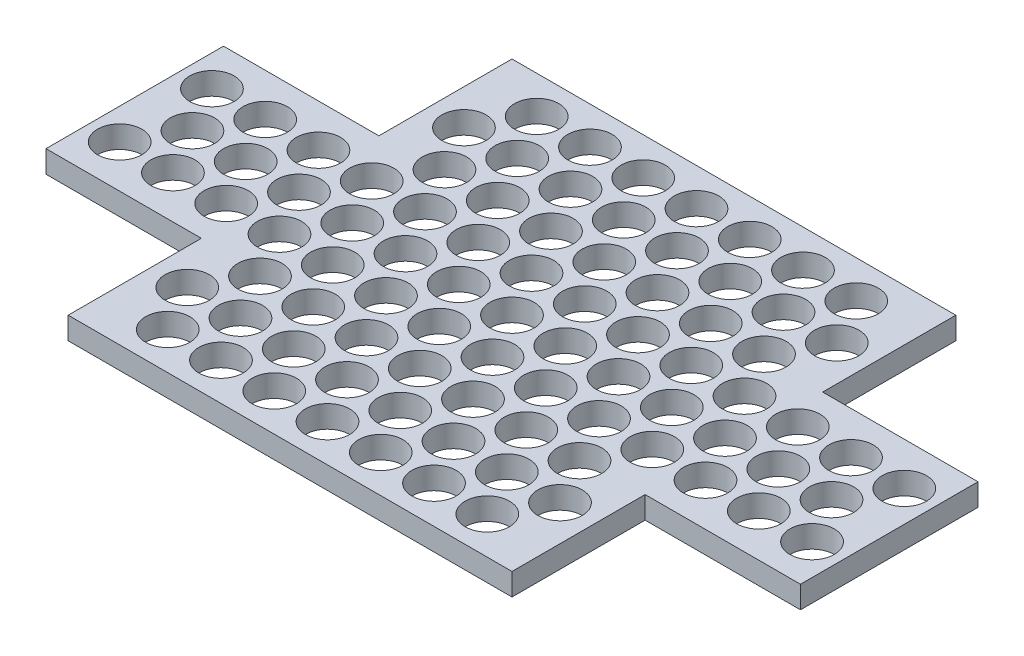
ISO-10303-21;
HEADER;
FILE_DESCRIPTION(('STEP AP214'),'2;1');
FILE_NAME('part.step','',(''),(''),'','','');
FILE_SCHEMA(('AUTOMOTIVE_DESIGN { 1 0 10303 214 1 1 1 1 }'));
ENDSEC;
DATA;
#1=APPLICATION_CONTEXT('core data for automotive mechanical design processes');
#2=APPLICATION_PROTOCOL_DEFINITION('international standard','automotive_design',2000,#1);
#3=PRODUCT_CONTEXT('',#1,'mechanical');
#4=PRODUCT('Part','Part','',(#3));
#5=PRODUCT_RELATED_PRODUCT_CATEGORY('part','',(#4));
#6=PRODUCT_DEFINITION_FORMATION('','',#4);
#7=PRODUCT_DEFINITION_CONTEXT('part definition',#1,'design');
#8=PRODUCT_DEFINITION('design','',#6,#7);
#9=PRODUCT_DEFINITION_SHAPE('','',#8);
#10=(LENGTH_UNIT() NAMED_UNIT(*) SI_UNIT(.MILLI.,.METRE.));
#11=(NAMED_UNIT(*) PLANE_ANGLE_UNIT() SI_UNIT($,.RADIAN.));
#12=(NAMED_UNIT(*) SI_UNIT($,.STERADIAN.) SOLID_ANGLE_UNIT());
#13=UNCERTAINTY_MEASURE_WITH_UNIT(LENGTH_MEASURE(1.E-05),#10,'distance_accuracy_value','');
#14=(GEOMETRIC_REPRESENTATION_CONTEXT(3) GLOBAL_UNCERTAINTY_ASSIGNED_CONTEXT((#13)) GLOBAL_UNIT_ASSIGNED_CONTEXT((#10,
#11,#12)) REPRESENTATION_CONTEXT('',''));
#15=CARTESIAN_POINT('',(0.,0.,0.));
#16=DIRECTION('',(0.,0.,1.));
#17=DIRECTION('',(1.,0.,0.));
#18=AXIS2_PLACEMENT_3D('',#15,#16,#17);
#19=CARTESIAN_POINT('',(50.,5.,-70.));
#20=DIRECTION('',(-1.,0.,0.));
#21=DIRECTION('',(0.,0.,1.));
#22=AXIS2_PLACEMENT_3D('',#19,#20,#21);
#23=PLANE('',#22);
#24=DIRECTION('',(0.,0.,-1.));
#25=VECTOR('',#24,1.);
#26=CARTESIAN_POINT('',(50.,0.,-70.));
#27=LINE('',#26,#25);
#28=CARTESIAN_POINT('',(50.,0.,-70.));
#29=VERTEX_POINT('',#28);
#30=CARTESIAN_POINT('',(50.,0.,-100.));
#31=VERTEX_POINT('',#30);
#32=EDGE_CURVE('E127',#29,#31,#27,.T.);
#33=ORIENTED_EDGE('',*,*,#32,.T.);
#34=DIRECTION('',(0.,-1.,0.));
#35=VECTOR('',#34,1.);
#36=CARTESIAN_POINT('',(50.,5.,-100.));
#37=LINE('',#36,#35);
#38=CARTESIAN_POINT('',(50.,5.,-100.));
#39=VERTEX_POINT('',#38);
#40=EDGE_CURVE('E12',#39,#31,#37,.T.);
#41=ORIENTED_EDGE('',*,*,#40,.F.);
#42=DIRECTION('',(0.,0.,-1.));
#43=VECTOR('',#42,1.);
#44=CARTESIAN_POINT('',(50.,5.,-70.));
#45=LINE('',#44,#43);
#46=CARTESIAN_POINT('',(50.,5.,-70.));
#47=VERTEX_POINT('',#46);
#48=EDGE_CURVE('E167',#47,#39,#45,.T.);
#49=ORIENTED_EDGE('',*,*,#48,.F.);
#50=DIRECTION('',(0.,-1.,0.));
#51=VECTOR('',#50,1.);
#52=CARTESIAN_POINT('',(50.,5.,-70.));
#53=LINE('',#52,#51);
#54=EDGE_CURVE('E140',#47,#29,#53,.T.);
#55=ORIENTED_EDGE('',*,*,#54,.T.);
#56=EDGE_LOOP('',(#33,#41,#49,#55));
#57=FACE_BOUND('',#56,.T.);
#58=ADVANCED_FACE('F35',(#57),#23,.F.);
#59=CARTESIAN_POINT('',(-50.,5.,-100.));
#60=DIRECTION('',(0.,0.,1.));
#61=DIRECTION('',(1.,0.,0.));
#62=AXIS2_PLACEMENT_3D('',#59,#60,#61);
#63=PLANE('',#62);
#64=DIRECTION('',(-1.,0.,0.));
#65=VECTOR('',#64,1.);
#66=CARTESIAN_POINT('',(-50.,0.,-100.));
#67=LINE('',#66,#65);
#68=CARTESIAN_POINT('',(-50.,0.,-100.));
#69=VERTEX_POINT('',#68);
#70=EDGE_CURVE('E123',#31,#69,#67,.T.);
#71=ORIENTED_EDGE('',*,*,#70,.T.);
#72=DIRECTION('',(0.,-1.,0.));
#73=VECTOR('',#72,1.);
#74=CARTESIAN_POINT('',(-50.,5.,-100.));
#75=LINE('',#74,#73);
#76=CARTESIAN_POINT('',(-50.,5.,-100.));
#77=VERTEX_POINT('',#76);
#78=EDGE_CURVE('E42',#77,#69,#75,.T.);
#79=ORIENTED_EDGE('',*,*,#78,.F.);
#80=DIRECTION('',(-1.,0.,0.));
#81=VECTOR('',#80,1.);
#82=CARTESIAN_POINT('',(-50.,5.,-100.));
#83=LINE('',#82,#81);
#84=EDGE_CURVE('E136',#39,#77,#83,.T.);
#85=ORIENTED_EDGE('',*,*,#84,.F.);
#86=ORIENTED_EDGE('',*,*,#40,.T.);
#87=EDGE_LOOP('',(#71,#79,#85,#86));
#88=FACE_BOUND('',#87,.T.);
#89=ADVANCED_FACE('F135',(#88),#63,.F.);
#90=CARTESIAN_POINT('',(-50.,5.,-70.));
#91=DIRECTION('',(1.,0.,0.));
#92=DIRECTION('',(0.,0.,-1.));
#93=AXIS2_PLACEMENT_3D('',#90,#91,#92);
#94=PLANE('',#93);
#95=DIRECTION('',(0.,0.,1.));
#96=VECTOR('',#95,1.);
#97=CARTESIAN_POINT('',(-50.,0.,-70.));
#98=LINE('',#97,#96);
#99=CARTESIAN_POINT('',(-50.,0.,-70.));
#100=VERTEX_POINT('',#99);
#101=EDGE_CURVE('E129',#69,#100,#98,.T.);
#102=ORIENTED_EDGE('',*,*,#101,.T.);
#103=DIRECTION('',(0.,-1.,0.));
#104=VECTOR('',#103,1.);
#105=CARTESIAN_POINT('',(-50.,5.,-70.));
#106=LINE('',#105,#104);
#107=CARTESIAN_POINT('',(-50.,5.,-70.));
#108=VERTEX_POINT('',#107);
#109=EDGE_CURVE('E213',#108,#100,#106,.T.);
#110=ORIENTED_EDGE('',*,*,#109,.F.);
#111=DIRECTION('',(0.,0.,1.));
#112=VECTOR('',#111,1.);
#113=CARTESIAN_POINT('',(-50.,5.,-70.));
#114=LINE('',#113,#112);
#115=EDGE_CURVE('E170',#77,#108,#114,.T.);
#116=ORIENTED_EDGE('',*,*,#115,.F.);
#117=ORIENTED_EDGE('',*,*,#78,.T.);
#118=EDGE_LOOP('',(#102,#110,#116,#117));
#119=FACE_BOUND('',#118,.T.);
#120=ADVANCED_FACE('F217',(#119),#94,.F.);
#121=CARTESIAN_POINT('',(-85.,5.,-70.));
#122=DIRECTION('',(0.,0.,1.));
#123=DIRECTION('',(1.,0.,0.));
#124=AXIS2_PLACEMENT_3D('',#121,#122,#123);
#125=PLANE('',#124);
#126=DIRECTION('',(-1.,0.,0.));
#127=VECTOR('',#126,1.);
#128=CARTESIAN_POINT('',(-85.,0.,-70.));
#129=LINE('',#128,#127);
#130=CARTESIAN_POINT('',(-85.,0.,-70.));
#131=VERTEX_POINT('',#130);
#132=EDGE_CURVE('E149',#100,#131,#129,.T.);
#133=ORIENTED_EDGE('',*,*,#132,.T.);
#134=DIRECTION('',(0.,-1.,0.));
#135=VECTOR('',#134,1.);
#136=CARTESIAN_POINT('',(-85.,5.,-70.));
#137=LINE('',#136,#135);
#138=CARTESIAN_POINT('',(-85.,5.,-70.));
#139=VERTEX_POINT('',#138);
#140=EDGE_CURVE('E210',#139,#131,#137,.T.);
#141=ORIENTED_EDGE('',*,*,#140,.F.);
#142=DIRECTION('',(-1.,0.,0.));
#143=VECTOR('',#142,1.);
#144=CARTESIAN_POINT('',(-85.,5.,-70.));
#145=LINE('',#144,#143);
#146=EDGE_CURVE('E172',#108,#139,#145,.T.);
#147=ORIENTED_EDGE('',*,*,#146,.F.);
#148=ORIENTED_EDGE('',*,*,#109,.T.);
#149=EDGE_LOOP('',(#133,#141,#147,#148));
#150=FACE_BOUND('',#149,.T.);
#151=ADVANCED_FACE('F225',(#150),#125,.F.);
#152=CARTESIAN_POINT('',(-85.,5.,-30.));
#153=DIRECTION('',(1.,0.,0.));
#154=DIRECTION('',(0.,0.,-1.));
#155=AXIS2_PLACEMENT_3D('',#152,#153,#154);
#156=PLANE('',#155);
#157=DIRECTION('',(0.,0.,1.));
#158=VECTOR('',#157,1.);
#159=CARTESIAN_POINT('',(-85.,0.,-30.));
#160=LINE('',#159,#158);
#161=CARTESIAN_POINT('',(-85.,0.,-30.));
#162=VERTEX_POINT('',#161);
#163=EDGE_CURVE('E151',#131,#162,#160,.T.);
#164=ORIENTED_EDGE('',*,*,#163,.T.);
#165=DIRECTION('',(0.,-1.,0.));
#166=VECTOR('',#165,1.);
#167=CARTESIAN_POINT('',(-85.,5.,-30.));
#168=LINE('',#167,#166);
#169=CARTESIAN_POINT('',(-85.,5.,-30.));
#170=VERTEX_POINT('',#169);
#171=EDGE_CURVE('E207',#170,#162,#168,.T.);
#172=ORIENTED_EDGE('',*,*,#171,.F.);
#173=DIRECTION('',(0.,0.,1.));
#174=VECTOR('',#173,1.);
#175=CARTESIAN_POINT('',(-85.,5.,-30.));
#176=LINE('',#175,#174);
#177=EDGE_CURVE('E174',#139,#170,#176,.T.);
#178=ORIENTED_EDGE('',*,*,#177,.F.);
#179=ORIENTED_EDGE('',*,*,#140,.T.);
#180=EDGE_LOOP('',(#164,#172,#178,#179));
#181=FACE_BOUND('',#180,.T.);
#182=ADVANCED_FACE('F228',(#181),#156,.F.);
#183=CARTESIAN_POINT('',(-50.,5.,-30.));
#184=DIRECTION('',(0.,0.,-1.));
#185=DIRECTION('',(-1.,0.,0.));
#186=AXIS2_PLACEMENT_3D('',#183,#184,#185);
#187=PLANE('',#186);
#188=DIRECTION('',(1.,0.,0.));
#189=VECTOR('',#188,1.);
#190=CARTESIAN_POINT('',(-50.,0.,-30.));
#191=LINE('',#190,#189);
#192=CARTESIAN_POINT('',(-50.,0.,-30.));
#193=VERTEX_POINT('',#192);
#194=EDGE_CURVE('E153',#162,#193,#191,.T.);
#195=ORIENTED_EDGE('',*,*,#194,.T.);
#196=DIRECTION('',(0.,-1.,0.));
#197=VECTOR('',#196,1.);
#198=CARTESIAN_POINT('',(-50.,5.,-30.));
#199=LINE('',#198,#197);
#200=CARTESIAN_POINT('',(-50.,5.,-30.));
#201=VERTEX_POINT('',#200);
#202=EDGE_CURVE('E204',#201,#193,#199,.T.);
#203=ORIENTED_EDGE('',*,*,#202,.F.);
#204=DIRECTION('',(1.,0.,0.));
#205=VECTOR('',#204,1.);
#206=CARTESIAN_POINT('',(-50.,5.,-30.));
#207=LINE('',#206,#205);
#208=EDGE_CURVE('E176',#170,#201,#207,.T.);
#209=ORIENTED_EDGE('',*,*,#208,.F.);
#210=ORIENTED_EDGE('',*,*,#171,.T.);
#211=EDGE_LOOP('',(#195,#203,#209,#210));
#212=FACE_BOUND('',#211,.T.);
#213=ADVANCED_FACE('F233',(#212),#187,.F.);
#214=CARTESIAN_POINT('',(-50.,5.,0.));
#215=DIRECTION('',(1.,0.,0.));
#216=DIRECTION('',(0.,0.,-1.));
#217=AXIS2_PLACEMENT_3D('',#214,#215,#216);
#218=PLANE('',#217);
#219=DIRECTION('',(0.,0.,1.));
#220=VECTOR('',#219,1.);
#221=CARTESIAN_POINT('',(-50.,0.,0.));
#222=LINE('',#221,#220);
#223=CARTESIAN_POINT('',(-50.,0.,0.));
#224=VERTEX_POINT('',#223);
#225=EDGE_CURVE('E155',#193,#224,#222,.T.);
#226=ORIENTED_EDGE('',*,*,#225,.T.);
#227=DIRECTION('',(0.,-1.,0.));
#228=VECTOR('',#227,1.);
#229=CARTESIAN_POINT('',(-50.,5.,0.));
#230=LINE('',#229,#228);
#231=CARTESIAN_POINT('',(-50.,5.,0.));
#232=VERTEX_POINT('',#231);
#233=EDGE_CURVE('E201',#232,#224,#230,.T.);
#234=ORIENTED_EDGE('',*,*,#233,.F.);
#235=DIRECTION('',(0.,0.,1.));
#236=VECTOR('',#235,1.);
#237=CARTESIAN_POINT('',(-50.,5.,0.));
#238=LINE('',#237,#236);
#239=EDGE_CURVE('E178',#201,#232,#238,.T.);
#240=ORIENTED_EDGE('',*,*,#239,.F.);
#241=ORIENTED_EDGE('',*,*,#202,.T.);
#242=EDGE_LOOP('',(#226,#234,#240,#241));
#243=FACE_BOUND('',#242,.T.);
#244=ADVANCED_FACE('F239',(#243),#218,.F.);
#245=CARTESIAN_POINT('',(50.,5.,0.));
#246=DIRECTION('',(0.,0.,-1.));
#247=DIRECTION('',(-1.,0.,0.));
#248=AXIS2_PLACEMENT_3D('',#245,#246,#247);
#249=PLANE('',#248);
#250=DIRECTION('',(1.,0.,0.));
#251=VECTOR('',#250,1.);
#252=CARTESIAN_POINT('',(50.,0.,0.));
#253=LINE('',#252,#251);
#254=CARTESIAN_POINT('',(50.,0.,0.));
#255=VERTEX_POINT('',#254);
#256=EDGE_CURVE('E157',#224,#255,#253,.T.);
#257=ORIENTED_EDGE('',*,*,#256,.T.);
#258=DIRECTION('',(0.,-1.,0.));
#259=VECTOR('',#258,1.);
#260=CARTESIAN_POINT('',(50.,5.,0.));
#261=LINE('',#260,#259);
#262=CARTESIAN_POINT('',(50.,5.,0.));
#263=VERTEX_POINT('',#262);
#264=EDGE_CURVE('E198',#263,#255,#261,.T.);
#265=ORIENTED_EDGE('',*,*,#264,.F.);
#266=DIRECTION('',(1.,0.,0.));
#267=VECTOR('',#266,1.);
#268=CARTESIAN_POINT('',(50.,5.,0.));
#269=LINE('',#268,#267);
#270=EDGE_CURVE('E180',#232,#263,#269,.T.);
#271=ORIENTED_EDGE('',*,*,#270,.F.);
#272=ORIENTED_EDGE('',*,*,#233,.T.);
#273=EDGE_LOOP('',(#257,#265,#271,#272));
#274=FACE_BOUND('',#273,.T.);
#275=ADVANCED_FACE('F243',(#274),#249,.F.);
#276=CARTESIAN_POINT('',(50.,5.,0.));
#277=DIRECTION('',(-1.,0.,0.));
#278=DIRECTION('',(0.,0.,1.));
#279=AXIS2_PLACEMENT_3D('',#276,#277,#278);
#280=PLANE('',#279);
#281=DIRECTION('',(0.,0.,-1.));
#282=VECTOR('',#281,1.);
#283=CARTESIAN_POINT('',(50.,0.,0.));
#284=LINE('',#283,#282);
#285=CARTESIAN_POINT('',(50.,0.,-30.));
#286=VERTEX_POINT('',#285);
#287=EDGE_CURVE('E159',#255,#286,#284,.T.);
#288=ORIENTED_EDGE('',*,*,#287,.T.);
#289=DIRECTION('',(0.,-1.,0.));
#290=VECTOR('',#289,1.);
#291=CARTESIAN_POINT('',(50.,5.,-30.));
#292=LINE('',#291,#290);
#293=CARTESIAN_POINT('',(50.,5.,-30.));
#294=VERTEX_POINT('',#293);
#295=EDGE_CURVE('E195',#294,#286,#292,.T.);
#296=ORIENTED_EDGE('',*,*,#295,.F.);
#297=DIRECTION('',(0.,0.,-1.));
#298=VECTOR('',#297,1.);
#299=CARTESIAN_POINT('',(50.,5.,0.));
#300=LINE('',#299,#298);
#301=EDGE_CURVE('E182',#263,#294,#300,.T.);
#302=ORIENTED_EDGE('',*,*,#301,.F.);
#303=ORIENTED_EDGE('',*,*,#264,.T.);
#304=EDGE_LOOP('',(#288,#296,#302,#303));
#305=FACE_BOUND('',#304,.T.);
#306=ADVANCED_FACE('F248',(#305),#280,.F.);
#307=CARTESIAN_POINT('',(50.,5.,-30.));
#308=DIRECTION('',(0.,0.,-1.));
#309=DIRECTION('',(-1.,0.,0.));
#310=AXIS2_PLACEMENT_3D('',#307,#308,#309);
#311=PLANE('',#310);
#312=DIRECTION('',(1.,0.,0.));
#313=VECTOR('',#312,1.);
#314=CARTESIAN_POINT('',(50.,0.,-30.));
#315=LINE('',#314,#313);
#316=CARTESIAN_POINT('',(85.,0.,-30.));
#317=VERTEX_POINT('',#316);
#318=EDGE_CURVE('E161',#286,#317,#315,.T.);
#319=ORIENTED_EDGE('',*,*,#318,.T.);
#320=DIRECTION('',(0.,-1.,0.));
#321=VECTOR('',#320,1.);
#322=CARTESIAN_POINT('',(85.,5.,-30.));
#323=LINE('',#322,#321);
#324=CARTESIAN_POINT('',(85.,5.,-30.));
#325=VERTEX_POINT('',#324);
#326=EDGE_CURVE('E192',#325,#317,#323,.T.);
#327=ORIENTED_EDGE('',*,*,#326,.F.);
#328=DIRECTION('',(1.,0.,0.));
#329=VECTOR('',#328,1.);
#330=CARTESIAN_POINT('',(50.,5.,-30.));
#331=LINE('',#330,#329);
#332=EDGE_CURVE('E184',#294,#325,#331,.T.);
#333=ORIENTED_EDGE('',*,*,#332,.F.);
#334=ORIENTED_EDGE('',*,*,#295,.T.);
#335=EDGE_LOOP('',(#319,#327,#333,#334));
#336=FACE_BOUND('',#335,.T.);
#337=ADVANCED_FACE('F252',(#336),#311,.F.);
#338=CARTESIAN_POINT('',(85.,5.,-30.));
#339=DIRECTION('',(-1.,0.,0.));
#340=DIRECTION('',(0.,0.,1.));
#341=AXIS2_PLACEMENT_3D('',#338,#339,#340);
#342=PLANE('',#341);
#343=DIRECTION('',(0.,0.,-1.));
#344=VECTOR('',#343,1.);
#345=CARTESIAN_POINT('',(85.,0.,-30.));
#346=LINE('',#345,#344);
#347=CARTESIAN_POINT('',(85.,0.,-70.));
#348=VERTEX_POINT('',#347);
#349=EDGE_CURVE('E163',#317,#348,#346,.T.);
#350=ORIENTED_EDGE('',*,*,#349,.T.);
#351=DIRECTION('',(0.,-1.,0.));
#352=VECTOR('',#351,1.);
#353=CARTESIAN_POINT('',(85.,5.,-70.));
#354=LINE('',#353,#352);
#355=CARTESIAN_POINT('',(85.,5.,-70.));
#356=VERTEX_POINT('',#355);
#357=EDGE_CURVE('E189',#356,#348,#354,.T.);
#358=ORIENTED_EDGE('',*,*,#357,.F.);
#359=DIRECTION('',(0.,0.,-1.));
#360=VECTOR('',#359,1.);
#361=CARTESIAN_POINT('',(85.,5.,-30.));
#362=LINE('',#361,#360);
#363=EDGE_CURVE('E54',#325,#356,#362,.T.);
#364=ORIENTED_EDGE('',*,*,#363,.F.);
#365=ORIENTED_EDGE('',*,*,#326,.T.);
#366=EDGE_LOOP('',(#350,#358,#364,#365));
#367=FACE_BOUND('',#366,.T.);
#368=ADVANCED_FACE('F256',(#367),#342,.F.);
#369=CARTESIAN_POINT('',(85.,5.,-70.));
#370=DIRECTION('',(0.,0.,1.));
#371=DIRECTION('',(1.,0.,0.));
#372=AXIS2_PLACEMENT_3D('',#369,#370,#371);
#373=PLANE('',#372);
#374=DIRECTION('',(-1.,0.,0.));
#375=VECTOR('',#374,1.);
#376=CARTESIAN_POINT('',(85.,0.,-70.));
#377=LINE('',#376,#375);
#378=EDGE_CURVE('E165',#348,#29,#377,.T.);
#379=ORIENTED_EDGE('',*,*,#378,.T.);
#380=ORIENTED_EDGE('',*,*,#54,.F.);
#381=DIRECTION('',(-1.,0.,0.));
#382=VECTOR('',#381,1.);
#383=CARTESIAN_POINT('',(85.,5.,-70.));
#384=LINE('',#383,#382);
#385=EDGE_CURVE('E49',#356,#47,#384,.T.);
#386=ORIENTED_EDGE('',*,*,#385,.F.);
#387=ORIENTED_EDGE('',*,*,#357,.T.);
#388=EDGE_LOOP('',(#379,#380,#386,#387));
#389=FACE_BOUND('',#388,.T.);
#390=ADVANCED_FACE('F258',(#389),#373,.F.);
#391=CARTESIAN_POINT('',(50.,5.,-70.));
#392=DIRECTION('',(0.,-1.,0.));
#393=DIRECTION('',(0.,0.,-1.));
#394=AXIS2_PLACEMENT_3D('',#391,#392,#393);
#395=PLANE('',#394);
#396=CARTESIAN_POINT('',(-77.9999999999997,5.,-60.3923048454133));
#397=DIRECTION('',(0.,1.,0.));
#398=DIRECTION('',(0.,0.,1.));
#399=AXIS2_PLACEMENT_3D('',#396,#397,#398);
#400=CIRCLE('',#399,5.);
#401=CARTESIAN_POINT('',(-77.9999999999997,5.,-55.3923048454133));
#402=VERTEX_POINT('',#401);
#403=EDGE_CURVE('E1177',#402,#402,#400,.T.);
#404=ORIENTED_EDGE('',*,*,#403,.F.);
#405=EDGE_LOOP('',(#404));
#406=FACE_BOUND('',#405,.T.);
#407=CARTESIAN_POINT('',(-77.9999999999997,5.,-39.6076951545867));
#408=DIRECTION('',(0.,1.,0.));
#409=DIRECTION('',(0.,0.,1.));
#410=AXIS2_PLACEMENT_3D('',#407,#408,#409);
#411=CIRCLE('',#410,5.);
#412=CARTESIAN_POINT('',(-77.9999999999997,5.,-34.6076951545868));
#413=VERTEX_POINT('',#412);
#414=EDGE_CURVE('E1179',#413,#413,#411,.T.);
#415=ORIENTED_EDGE('',*,*,#414,.F.);
#416=EDGE_LOOP('',(#415));
#417=FACE_BOUND('',#416,.T.);
#418=CARTESIAN_POINT('',(-71.9999999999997,5.,-50.));
#419=DIRECTION('',(0.,1.,0.));
#420=DIRECTION('',(0.,0.,1.));
#421=AXIS2_PLACEMENT_3D('',#418,#419,#420);
#422=CIRCLE('',#421,5.);
#423=CARTESIAN_POINT('',(-71.9999999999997,5.,-45.));
#424=VERTEX_POINT('',#423);
#425=EDGE_CURVE('E1187',#424,#424,#422,.T.);
#426=ORIENTED_EDGE('',*,*,#425,.F.);
#427=EDGE_LOOP('',(#426));
#428=FACE_BOUND('',#427,.T.);
#429=CARTESIAN_POINT('',(-65.9999999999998,5.,-60.3923048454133));
#430=DIRECTION('',(0.,1.,0.));
#431=DIRECTION('',(0.,0.,1.));
#432=AXIS2_PLACEMENT_3D('',#429,#430,#431);
#433=CIRCLE('',#432,5.);
#434=CARTESIAN_POINT('',(-65.9999999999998,5.,-55.3923048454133));
#435=VERTEX_POINT('',#434);
#436=EDGE_CURVE('E1193',#435,#435,#433,.T.);
#437=ORIENTED_EDGE('',*,*,#436,.F.);
#438=EDGE_LOOP('',(#437));
#439=FACE_BOUND('',#438,.T.);
#440=CARTESIAN_POINT('',(-65.9999999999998,5.,-39.6076951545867));
#441=DIRECTION('',(0.,1.,0.));
#442=DIRECTION('',(0.,0.,1.));
#443=AXIS2_PLACEMENT_3D('',#440,#441,#442);
#444=CIRCLE('',#443,5.);
#445=CARTESIAN_POINT('',(-65.9999999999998,5.,-34.6076951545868));
#446=VERTEX_POINT('',#445);
#447=EDGE_CURVE('E1199',#446,#446,#444,.T.);
#448=ORIENTED_EDGE('',*,*,#447,.F.);
#449=EDGE_LOOP('',(#448));
#450=FACE_BOUND('',#449,.T.);
#451=CARTESIAN_POINT('',(-59.9999999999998,5.,-50.));
#452=DIRECTION('',(0.,1.,0.));
#453=DIRECTION('',(0.,0.,1.));
#454=AXIS2_PLACEMENT_3D('',#451,#452,#453);
#455=CIRCLE('',#454,5.);
#456=CARTESIAN_POINT('',(-59.9999999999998,5.,-45.));
#457=VERTEX_POINT('',#456);
#458=EDGE_CURVE('E1205',#457,#457,#455,.T.);
#459=ORIENTED_EDGE('',*,*,#458,.F.);
#460=EDGE_LOOP('',(#459));
#461=FACE_BOUND('',#460,.T.);
#462=CARTESIAN_POINT('',(-53.9999999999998,5.,-60.3923048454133));
#463=DIRECTION('',(0.,1.,0.));
#464=DIRECTION('',(0.,0.,1.));
#465=AXIS2_PLACEMENT_3D('',#462,#463,#464);
#466=CIRCLE('',#465,5.);
#467=CARTESIAN_POINT('',(-53.9999999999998,5.,-55.3923048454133));
#468=VERTEX_POINT('',#467);
#469=EDGE_CURVE('E1211',#468,#468,#466,.T.);
#470=ORIENTED_EDGE('',*,*,#469,.F.);
#471=EDGE_LOOP('',(#470));
#472=FACE_BOUND('',#471,.T.);
#473=CARTESIAN_POINT('',(-41.9999999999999,5.,-81.1769145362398));
#474=DIRECTION('',(0.,1.,0.));
#475=DIRECTION('',(0.,0.,1.));
#476=AXIS2_PLACEMENT_3D('',#473,#474,#475);
#477=CIRCLE('',#476,5.);
#478=CARTESIAN_POINT('',(-41.9999999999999,5.,-76.1769145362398));
#479=VERTEX_POINT('',#478);
#480=EDGE_CURVE('E1217',#479,#479,#477,.T.);
#481=ORIENTED_EDGE('',*,*,#480,.F.);
#482=EDGE_LOOP('',(#481));
#483=FACE_BOUND('',#482,.T.);
#484=CARTESIAN_POINT('',(-35.9999999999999,5.,-91.5692193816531));
#485=DIRECTION('',(0.,1.,0.));
#486=DIRECTION('',(0.,0.,1.));
#487=AXIS2_PLACEMENT_3D('',#484,#485,#486);
#488=CIRCLE('',#487,5.);
#489=CARTESIAN_POINT('',(-35.9999999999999,5.,-86.5692193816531));
#490=VERTEX_POINT('',#489);
#491=EDGE_CURVE('E1223',#490,#490,#488,.T.);
#492=ORIENTED_EDGE('',*,*,#491,.F.);
#493=EDGE_LOOP('',(#492));
#494=FACE_BOUND('',#493,.T.);
#495=CARTESIAN_POINT('',(-53.9999999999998,5.,-39.6076951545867));
#496=DIRECTION('',(0.,1.,0.));
#497=DIRECTION('',(0.,0.,1.));
#498=AXIS2_PLACEMENT_3D('',#495,#496,#497);
#499=CIRCLE('',#498,5.);
#500=CARTESIAN_POINT('',(-53.9999999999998,5.,-34.6076951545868));
#501=VERTEX_POINT('',#500);
#502=EDGE_CURVE('E1229',#501,#501,#499,.T.);
#503=ORIENTED_EDGE('',*,*,#502,.F.);
#504=EDGE_LOOP('',(#503));
#505=FACE_BOUND('',#504,.T.);
#506=CARTESIAN_POINT('',(-47.9999999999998,5.,-50.));
#507=DIRECTION('',(0.,1.,0.));
#508=DIRECTION('',(0.,0.,1.));
#509=AXIS2_PLACEMENT_3D('',#506,#507,#508);
#510=CIRCLE('',#509,5.);
#511=CARTESIAN_POINT('',(-47.9999999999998,5.,-45.));
#512=VERTEX_POINT('',#511);
#513=EDGE_CURVE('E1235',#512,#512,#510,.T.);
#514=ORIENTED_EDGE('',*,*,#513,.F.);
#515=EDGE_LOOP('',(#514));
#516=FACE_BOUND('',#515,.T.);
#517=CARTESIAN_POINT('',(-41.9999999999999,5.,-60.3923048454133));
#518=DIRECTION('',(0.,1.,0.));
#519=DIRECTION('',(0.,0.,1.));
#520=AXIS2_PLACEMENT_3D('',#517,#518,#519);
#521=CIRCLE('',#520,5.);
#522=CARTESIAN_POINT('',(-41.9999999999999,5.,-55.3923048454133));
#523=VERTEX_POINT('',#522);
#524=EDGE_CURVE('E1241',#523,#523,#521,.T.);
#525=ORIENTED_EDGE('',*,*,#524,.F.);
#526=EDGE_LOOP('',(#525));
#527=FACE_BOUND('',#526,.T.);
#528=CARTESIAN_POINT('',(-35.9999999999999,5.,-70.7846096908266));
#529=DIRECTION('',(0.,1.,0.));
#530=DIRECTION('',(0.,0.,1.));
#531=AXIS2_PLACEMENT_3D('',#528,#529,#530);
#532=CIRCLE('',#531,5.);
#533=CARTESIAN_POINT('',(-35.9999999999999,5.,-65.7846096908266));
#534=VERTEX_POINT('',#533);
#535=EDGE_CURVE('E1247',#534,#534,#532,.T.);
#536=ORIENTED_EDGE('',*,*,#535,.F.);
#537=EDGE_LOOP('',(#536));
#538=FACE_BOUND('',#537,.T.);
#539=CARTESIAN_POINT('',(-29.9999999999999,5.,-81.1769145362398));
#540=DIRECTION('',(0.,1.,0.));
#541=DIRECTION('',(0.,0.,1.));
#542=AXIS2_PLACEMENT_3D('',#539,#540,#541);
#543=CIRCLE('',#542,5.);
#544=CARTESIAN_POINT('',(-29.9999999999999,5.,-76.1769145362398));
#545=VERTEX_POINT('',#544);
#546=EDGE_CURVE('E1253',#545,#545,#543,.T.);
#547=ORIENTED_EDGE('',*,*,#546,.F.);
#548=EDGE_LOOP('',(#547));
#549=FACE_BOUND('',#548,.T.);
#550=CARTESIAN_POINT('',(-23.9999999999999,5.,-91.5692193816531));
#551=DIRECTION('',(0.,1.,0.));
#552=DIRECTION('',(0.,0.,1.));
#553=AXIS2_PLACEMENT_3D('',#550,#551,#552);
#554=CIRCLE('',#553,5.);
#555=CARTESIAN_POINT('',(-23.9999999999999,5.,-86.5692193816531));
#556=VERTEX_POINT('',#555);
#557=EDGE_CURVE('E1259',#556,#556,#554,.T.);
#558=ORIENTED_EDGE('',*,*,#557,.F.);
#559=EDGE_LOOP('',(#558));
#560=FACE_BOUND('',#559,.T.);
#561=CARTESIAN_POINT('',(-41.9999999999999,5.,-39.6076951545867));
#562=DIRECTION('',(0.,1.,0.));
#563=DIRECTION('',(0.,0.,1.));
#564=AXIS2_PLACEMENT_3D('',#561,#562,#563);
#565=CIRCLE('',#564,5.);
#566=CARTESIAN_POINT('',(-41.9999999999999,5.,-34.6076951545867));
#567=VERTEX_POINT('',#566);
#568=EDGE_CURVE('E1265',#567,#567,#565,.T.);
#569=ORIENTED_EDGE('',*,*,#568,.F.);
#570=EDGE_LOOP('',(#569));
#571=FACE_BOUND('',#570,.T.);
#572=CARTESIAN_POINT('',(-35.9999999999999,5.,-50.));
#573=DIRECTION('',(0.,1.,0.));
#574=DIRECTION('',(0.,0.,1.));
#575=AXIS2_PLACEMENT_3D('',#572,#573,#574);
#576=CIRCLE('',#575,5.);
#577=CARTESIAN_POINT('',(-35.9999999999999,5.,-45.));
#578=VERTEX_POINT('',#577);
#579=EDGE_CURVE('E1271',#578,#578,#576,.T.);
#580=ORIENTED_EDGE('',*,*,#579,.F.);
#581=EDGE_LOOP('',(#580));
#582=FACE_BOUND('',#581,.T.);
#583=CARTESIAN_POINT('',(-29.9999999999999,5.,-60.3923048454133));
#584=DIRECTION('',(0.,1.,0.));
#585=DIRECTION('',(0.,0.,1.));
#586=AXIS2_PLACEMENT_3D('',#583,#584,#585);
#587=CIRCLE('',#586,5.);
#588=CARTESIAN_POINT('',(-29.9999999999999,5.,-55.3923048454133));
#589=VERTEX_POINT('',#588);
#590=EDGE_CURVE('E1277',#589,#589,#587,.T.);
#591=ORIENTED_EDGE('',*,*,#590,.F.);
#592=EDGE_LOOP('',(#591));
#593=FACE_BOUND('',#592,.T.);
#594=CARTESIAN_POINT('',(-23.9999999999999,5.,-70.7846096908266));
#595=DIRECTION('',(0.,1.,0.));
#596=DIRECTION('',(0.,0.,1.));
#597=AXIS2_PLACEMENT_3D('',#594,#595,#596);
#598=CIRCLE('',#597,5.);
#599=CARTESIAN_POINT('',(-23.9999999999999,5.,-65.7846096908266));
#600=VERTEX_POINT('',#599);
#601=EDGE_CURVE('E1283',#600,#600,#598,.T.);
#602=ORIENTED_EDGE('',*,*,#601,.F.);
#603=EDGE_LOOP('',(#602));
#604=FACE_BOUND('',#603,.T.);
#605=CARTESIAN_POINT('',(-17.9999999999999,5.,-81.1769145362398));
#606=DIRECTION('',(0.,1.,0.));
#607=DIRECTION('',(0.,0.,1.));
#608=AXIS2_PLACEMENT_3D('',#605,#606,#607);
#609=CIRCLE('',#608,5.);
#610=CARTESIAN_POINT('',(-17.9999999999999,5.,-76.1769145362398));
#611=VERTEX_POINT('',#610);
#612=EDGE_CURVE('E1289',#611,#611,#609,.T.);
#613=ORIENTED_EDGE('',*,*,#612,.F.);
#614=EDGE_LOOP('',(#613));
#615=FACE_BOUND('',#614,.T.);
#616=CARTESIAN_POINT('',(-12.,5.,-91.5692193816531));
#617=DIRECTION('',(0.,1.,0.));
#618=DIRECTION('',(0.,0.,1.));
#619=AXIS2_PLACEMENT_3D('',#616,#617,#618);
#620=CIRCLE('',#619,5.);
#621=CARTESIAN_POINT('',(-12.,5.,-86.5692193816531));
#622=VERTEX_POINT('',#621);
#623=EDGE_CURVE('E1295',#622,#622,#620,.T.);
#624=ORIENTED_EDGE('',*,*,#623,.F.);
#625=EDGE_LOOP('',(#624));
#626=FACE_BOUND('',#625,.T.);
#627=CARTESIAN_POINT('',(-41.9999999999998,5.,-18.8230854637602));
#628=DIRECTION('',(0.,1.,0.));
#629=DIRECTION('',(0.,0.,1.));
#630=AXIS2_PLACEMENT_3D('',#627,#628,#629);
#631=CIRCLE('',#630,5.);
#632=CARTESIAN_POINT('',(-41.9999999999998,5.,-13.8230854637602));
#633=VERTEX_POINT('',#632);
#634=EDGE_CURVE('E1301',#633,#633,#631,.T.);
#635=ORIENTED_EDGE('',*,*,#634,.F.);
#636=EDGE_LOOP('',(#635));
#637=FACE_BOUND('',#636,.T.);
#638=CARTESIAN_POINT('',(-35.9999999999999,5.,-29.2153903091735));
#639=DIRECTION('',(0.,1.,0.));
#640=DIRECTION('',(0.,0.,1.));
#641=AXIS2_PLACEMENT_3D('',#638,#639,#640);
#642=CIRCLE('',#641,5.);
#643=CARTESIAN_POINT('',(-35.9999999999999,5.,-24.2153903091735));
#644=VERTEX_POINT('',#643);
#645=EDGE_CURVE('E1307',#644,#644,#642,.T.);
#646=ORIENTED_EDGE('',*,*,#645,.F.);
#647=EDGE_LOOP('',(#646));
#648=FACE_BOUND('',#647,.T.);
#649=CARTESIAN_POINT('',(-29.9999999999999,5.,-39.6076951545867));
#650=DIRECTION('',(0.,1.,0.));
#651=DIRECTION('',(0.,0.,1.));
#652=AXIS2_PLACEMENT_3D('',#649,#650,#651);
#653=CIRCLE('',#652,5.);
#654=CARTESIAN_POINT('',(-29.9999999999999,5.,-34.6076951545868));
#655=VERTEX_POINT('',#654);
#656=EDGE_CURVE('E1313',#655,#655,#653,.T.);
#657=ORIENTED_EDGE('',*,*,#656,.F.);
#658=EDGE_LOOP('',(#657));
#659=FACE_BOUND('',#658,.T.);
#660=CARTESIAN_POINT('',(-23.9999999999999,5.,-50.));
#661=DIRECTION('',(0.,1.,0.));
#662=DIRECTION('',(0.,0.,1.));
#663=AXIS2_PLACEMENT_3D('',#660,#661,#662);
#664=CIRCLE('',#663,5.);
#665=CARTESIAN_POINT('',(-23.9999999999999,5.,-45.));
#666=VERTEX_POINT('',#665);
#667=EDGE_CURVE('E1319',#666,#666,#664,.T.);
#668=ORIENTED_EDGE('',*,*,#667,.F.);
#669=EDGE_LOOP('',(#668));
#670=FACE_BOUND('',#669,.T.);
#671=CARTESIAN_POINT('',(-17.9999999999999,5.,-60.3923048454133));
#672=DIRECTION('',(0.,1.,0.));
#673=DIRECTION('',(0.,0.,1.));
#674=AXIS2_PLACEMENT_3D('',#671,#672,#673);
#675=CIRCLE('',#674,5.);
#676=CARTESIAN_POINT('',(-17.9999999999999,5.,-55.3923048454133));
#677=VERTEX_POINT('',#676);
#678=EDGE_CURVE('E1325',#677,#677,#675,.T.);
#679=ORIENTED_EDGE('',*,*,#678,.F.);
#680=EDGE_LOOP('',(#679));
#681=FACE_BOUND('',#680,.T.);
#682=CARTESIAN_POINT('',(-12.,5.,-70.7846096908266));
#683=DIRECTION('',(0.,1.,0.));
#684=DIRECTION('',(0.,0.,1.));
#685=AXIS2_PLACEMENT_3D('',#682,#683,#684);
#686=CIRCLE('',#685,5.);
#687=CARTESIAN_POINT('',(-12.,5.,-65.7846096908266));
#688=VERTEX_POINT('',#687);
#689=EDGE_CURVE('E1331',#688,#688,#686,.T.);
#690=ORIENTED_EDGE('',*,*,#689,.F.);
#691=EDGE_LOOP('',(#690));
#692=FACE_BOUND('',#691,.T.);
#693=CARTESIAN_POINT('',(-5.99999999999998,5.,-81.1769145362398));
#694=DIRECTION('',(0.,1.,0.));
#695=DIRECTION('',(0.,0.,1.));
#696=AXIS2_PLACEMENT_3D('',#693,#694,#695);
#697=CIRCLE('',#696,5.);
#698=CARTESIAN_POINT('',(-5.99999999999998,5.,-76.1769145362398));
#699=VERTEX_POINT('',#698);
#700=EDGE_CURVE('E1337',#699,#699,#697,.T.);
#701=ORIENTED_EDGE('',*,*,#700,.F.);
#702=EDGE_LOOP('',(#701));
#703=FACE_BOUND('',#702,.T.);
#704=CARTESIAN_POINT('',(0.,5.,-91.5692193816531));
#705=DIRECTION('',(0.,1.,0.));
#706=DIRECTION('',(0.,0.,1.));
#707=AXIS2_PLACEMENT_3D('',#704,#705,#706);
#708=CIRCLE('',#707,5.);
#709=CARTESIAN_POINT('',(0.,5.,-86.5692193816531));
#710=VERTEX_POINT('',#709);
#711=EDGE_CURVE('E1343',#710,#710,#708,.T.);
#712=ORIENTED_EDGE('',*,*,#711,.F.);
#713=EDGE_LOOP('',(#712));
#714=FACE_BOUND('',#713,.T.);
#715=CARTESIAN_POINT('',(-35.9999999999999,5.,-8.43078061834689));
#716=DIRECTION('',(0.,1.,0.));
#717=DIRECTION('',(0.,0.,1.));
#718=AXIS2_PLACEMENT_3D('',#715,#716,#717);
#719=CIRCLE('',#718,5.);
#720=CARTESIAN_POINT('',(-35.9999999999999,5.,-3.43078061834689));
#721=VERTEX_POINT('',#720);
#722=EDGE_CURVE('E1349',#721,#721,#719,.T.);
#723=ORIENTED_EDGE('',*,*,#722,.F.);
#724=EDGE_LOOP('',(#723));
#725=FACE_BOUND('',#724,.T.);
#726=CARTESIAN_POINT('',(-29.9999999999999,5.,-18.8230854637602));
#727=DIRECTION('',(0.,1.,0.));
#728=DIRECTION('',(0.,0.,1.));
#729=AXIS2_PLACEMENT_3D('',#726,#727,#728);
#730=CIRCLE('',#729,5.);
#731=CARTESIAN_POINT('',(-29.9999999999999,5.,-13.8230854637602));
#732=VERTEX_POINT('',#731);
#733=EDGE_CURVE('E1355',#732,#732,#730,.T.);
#734=ORIENTED_EDGE('',*,*,#733,.F.);
#735=EDGE_LOOP('',(#734));
#736=FACE_BOUND('',#735,.T.);
#737=CARTESIAN_POINT('',(-23.9999999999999,5.,-29.2153903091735));
#738=DIRECTION('',(0.,1.,0.));
#739=DIRECTION('',(0.,0.,1.));
#740=AXIS2_PLACEMENT_3D('',#737,#738,#739);
#741=CIRCLE('',#740,5.);
#742=CARTESIAN_POINT('',(-23.9999999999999,5.,-24.2153903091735));
#743=VERTEX_POINT('',#742);
#744=EDGE_CURVE('E1361',#743,#743,#741,.T.);
#745=ORIENTED_EDGE('',*,*,#744,.F.);
#746=EDGE_LOOP('',(#745));
#747=FACE_BOUND('',#746,.T.);
#748=CARTESIAN_POINT('',(-17.9999999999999,5.,-39.6076951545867));
#749=DIRECTION('',(0.,1.,0.));
#750=DIRECTION('',(0.,0.,1.));
#751=AXIS2_PLACEMENT_3D('',#748,#749,#750);
#752=CIRCLE('',#751,5.);
#753=CARTESIAN_POINT('',(-17.9999999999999,5.,-34.6076951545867));
#754=VERTEX_POINT('',#753);
#755=EDGE_CURVE('E1367',#754,#754,#752,.T.);
#756=ORIENTED_EDGE('',*,*,#755,.F.);
#757=EDGE_LOOP('',(#756));
#758=FACE_BOUND('',#757,.T.);
#759=CARTESIAN_POINT('',(-12.,5.,-50.));
#760=DIRECTION('',(0.,1.,0.));
#761=DIRECTION('',(0.,0.,1.));
#762=AXIS2_PLACEMENT_3D('',#759,#760,#761);
#763=CIRCLE('',#762,5.);
#764=CARTESIAN_POINT('',(-12.,5.,-45.));
#765=VERTEX_POINT('',#764);
#766=EDGE_CURVE('E1373',#765,#765,#763,.T.);
#767=ORIENTED_EDGE('',*,*,#766,.F.);
#768=EDGE_LOOP('',(#767));
#769=FACE_BOUND('',#768,.T.);
#770=CARTESIAN_POINT('',(-5.99999999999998,5.,-60.3923048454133));
#771=DIRECTION('',(0.,1.,0.));
#772=DIRECTION('',(0.,0.,1.));
#773=AXIS2_PLACEMENT_3D('',#770,#771,#772);
#774=CIRCLE('',#773,5.);
#775=CARTESIAN_POINT('',(-5.99999999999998,5.,-55.3923048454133));
#776=VERTEX_POINT('',#775);
#777=EDGE_CURVE('E1379',#776,#776,#774,.T.);
#778=ORIENTED_EDGE('',*,*,#777,.F.);
#779=EDGE_LOOP('',(#778));
#780=FACE_BOUND('',#779,.T.);
#781=CARTESIAN_POINT('',(0.,5.,-70.7846096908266));
#782=DIRECTION('',(0.,1.,0.));
#783=DIRECTION('',(0.,0.,1.));
#784=AXIS2_PLACEMENT_3D('',#781,#782,#783);
#785=CIRCLE('',#784,5.);
#786=CARTESIAN_POINT('',(0.,5.,-65.7846096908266));
#787=VERTEX_POINT('',#786);
#788=EDGE_CURVE('E1385',#787,#787,#785,.T.);
#789=ORIENTED_EDGE('',*,*,#788,.F.);
#790=EDGE_LOOP('',(#789));
#791=FACE_BOUND('',#790,.T.);
#792=CARTESIAN_POINT('',(5.99999999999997,5.,-81.1769145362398));
#793=DIRECTION('',(0.,1.,0.));
#794=DIRECTION('',(0.,0.,1.));
#795=AXIS2_PLACEMENT_3D('',#792,#793,#794);
#796=CIRCLE('',#795,5.);
#797=CARTESIAN_POINT('',(5.99999999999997,5.,-76.1769145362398));
#798=VERTEX_POINT('',#797);
#799=EDGE_CURVE('E1391',#798,#798,#796,.T.);
#800=ORIENTED_EDGE('',*,*,#799,.F.);
#801=EDGE_LOOP('',(#800));
#802=FACE_BOUND('',#801,.T.);
#803=CARTESIAN_POINT('',(11.9999999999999,5.,-91.5692193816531));
#804=DIRECTION('',(0.,1.,0.));
#805=DIRECTION('',(0.,0.,1.));
#806=AXIS2_PLACEMENT_3D('',#803,#804,#805);
#807=CIRCLE('',#806,5.);
#808=CARTESIAN_POINT('',(11.9999999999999,5.,-86.5692193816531));
#809=VERTEX_POINT('',#808);
#810=EDGE_CURVE('E1397',#809,#809,#807,.T.);
#811=ORIENTED_EDGE('',*,*,#810,.F.);
#812=EDGE_LOOP('',(#811));
#813=FACE_BOUND('',#812,.T.);
#814=CARTESIAN_POINT('',(-23.9999999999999,5.,-8.43078061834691));
#815=DIRECTION('',(0.,1.,0.));
#816=DIRECTION('',(0.,0.,1.));
#817=AXIS2_PLACEMENT_3D('',#814,#815,#816);
#818=CIRCLE('',#817,5.);
#819=CARTESIAN_POINT('',(-23.9999999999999,5.,-3.43078061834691));
#820=VERTEX_POINT('',#819);
#821=EDGE_CURVE('E1403',#820,#820,#818,.T.);
#822=ORIENTED_EDGE('',*,*,#821,.F.);
#823=EDGE_LOOP('',(#822));
#824=FACE_BOUND('',#823,.T.);
#825=CARTESIAN_POINT('',(-17.9999999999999,5.,-18.8230854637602));
#826=DIRECTION('',(0.,1.,0.));
#827=DIRECTION('',(0.,0.,1.));
#828=AXIS2_PLACEMENT_3D('',#825,#826,#827);
#829=CIRCLE('',#828,5.);
#830=CARTESIAN_POINT('',(-17.9999999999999,5.,-13.8230854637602));
#831=VERTEX_POINT('',#830);
#832=EDGE_CURVE('E1409',#831,#831,#829,.T.);
#833=ORIENTED_EDGE('',*,*,#832,.F.);
#834=EDGE_LOOP('',(#833));
#835=FACE_BOUND('',#834,.T.);
#836=CARTESIAN_POINT('',(-12.,5.,-29.2153903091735));
#837=DIRECTION('',(0.,1.,0.));
#838=DIRECTION('',(0.,0.,1.));
#839=AXIS2_PLACEMENT_3D('',#836,#837,#838);
#840=CIRCLE('',#839,5.);
#841=CARTESIAN_POINT('',(-12.,5.,-24.2153903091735));
#842=VERTEX_POINT('',#841);
#843=EDGE_CURVE('E1415',#842,#842,#840,.T.);
#844=ORIENTED_EDGE('',*,*,#843,.F.);
#845=EDGE_LOOP('',(#844));
#846=FACE_BOUND('',#845,.T.);
#847=CARTESIAN_POINT('',(-5.99999999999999,5.,-39.6076951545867));
#848=DIRECTION('',(0.,1.,0.));
#849=DIRECTION('',(0.,0.,1.));
#850=AXIS2_PLACEMENT_3D('',#847,#848,#849);
#851=CIRCLE('',#850,5.);
#852=CARTESIAN_POINT('',(-5.99999999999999,5.,-34.6076951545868));
#853=VERTEX_POINT('',#852);
#854=EDGE_CURVE('E1421',#853,#853,#851,.T.);
#855=ORIENTED_EDGE('',*,*,#854,.F.);
#856=EDGE_LOOP('',(#855));
#857=FACE_BOUND('',#856,.T.);
#858=CARTESIAN_POINT('',(5.99999999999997,5.,-60.3923048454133));
#859=DIRECTION('',(0.,1.,0.));
#860=DIRECTION('',(0.,0.,1.));
#861=AXIS2_PLACEMENT_3D('',#858,#859,#860);
#862=CIRCLE('',#861,5.);
#863=CARTESIAN_POINT('',(5.99999999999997,5.,-55.3923048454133));
#864=VERTEX_POINT('',#863);
#865=EDGE_CURVE('E1427',#864,#864,#862,.T.);
#866=ORIENTED_EDGE('',*,*,#865,.F.);
#867=EDGE_LOOP('',(#866));
#868=FACE_BOUND('',#867,.T.);
#869=CARTESIAN_POINT('',(11.9999999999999,5.,-70.7846096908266));
#870=DIRECTION('',(0.,1.,0.));
#871=DIRECTION('',(0.,0.,1.));
#872=AXIS2_PLACEMENT_3D('',#869,#870,#871);
#873=CIRCLE('',#872,5.);
#874=CARTESIAN_POINT('',(11.9999999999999,5.,-65.7846096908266));
#875=VERTEX_POINT('',#874);
#876=EDGE_CURVE('E1433',#875,#875,#873,.T.);
#877=ORIENTED_EDGE('',*,*,#876,.F.);
#878=EDGE_LOOP('',(#877));
#879=FACE_BOUND('',#878,.T.);
#880=CARTESIAN_POINT('',(17.9999999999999,5.,-81.1769145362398));
#881=DIRECTION('',(0.,1.,0.));
#882=DIRECTION('',(0.,0.,1.));
#883=AXIS2_PLACEMENT_3D('',#880,#881,#882);
#884=CIRCLE('',#883,5.);
#885=CARTESIAN_POINT('',(17.9999999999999,5.,-76.1769145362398));
#886=VERTEX_POINT('',#885);
#887=EDGE_CURVE('E1439',#886,#886,#884,.T.);
#888=ORIENTED_EDGE('',*,*,#887,.F.);
#889=EDGE_LOOP('',(#888));
#890=FACE_BOUND('',#889,.T.);
#891=CARTESIAN_POINT('',(23.9999999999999,5.,-91.5692193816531));
#892=DIRECTION('',(0.,1.,0.));
#893=DIRECTION('',(0.,0.,1.));
#894=AXIS2_PLACEMENT_3D('',#891,#892,#893);
#895=CIRCLE('',#894,5.);
#896=CARTESIAN_POINT('',(23.9999999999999,5.,-86.5692193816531));
#897=VERTEX_POINT('',#896);
#898=EDGE_CURVE('E1445',#897,#897,#895,.T.);
#899=ORIENTED_EDGE('',*,*,#898,.F.);
#900=EDGE_LOOP('',(#899));
#901=FACE_BOUND('',#900,.T.);
#902=CARTESIAN_POINT('',(-12.,5.,-8.43078061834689));
#903=DIRECTION('',(0.,1.,0.));
#904=DIRECTION('',(0.,0.,1.));
#905=AXIS2_PLACEMENT_3D('',#902,#903,#904);
#906=CIRCLE('',#905,5.);
#907=CARTESIAN_POINT('',(-12.,5.,-3.43078061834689));
#908=VERTEX_POINT('',#907);
#909=EDGE_CURVE('E1451',#908,#908,#906,.T.);
#910=ORIENTED_EDGE('',*,*,#909,.F.);
#911=EDGE_LOOP('',(#910));
#912=FACE_BOUND('',#911,.T.);
#913=CARTESIAN_POINT('',(-5.99999999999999,5.,-18.8230854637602));
#914=DIRECTION('',(0.,1.,0.));
#915=DIRECTION('',(0.,0.,1.));
#916=AXIS2_PLACEMENT_3D('',#913,#914,#915);
#917=CIRCLE('',#916,5.);
#918=CARTESIAN_POINT('',(-5.99999999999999,5.,-13.8230854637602));
#919=VERTEX_POINT('',#918);
#920=EDGE_CURVE('E1457',#919,#919,#917,.T.);
#921=ORIENTED_EDGE('',*,*,#920,.F.);
#922=EDGE_LOOP('',(#921));
#923=FACE_BOUND('',#922,.T.);
#924=CARTESIAN_POINT('',(0.,5.,-29.2153903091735));
#925=DIRECTION('',(0.,1.,0.));
#926=DIRECTION('',(0.,0.,1.));
#927=AXIS2_PLACEMENT_3D('',#924,#925,#926);
#928=CIRCLE('',#927,5.);
#929=CARTESIAN_POINT('',(0.,5.,-24.2153903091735));
#930=VERTEX_POINT('',#929);
#931=EDGE_CURVE('E1463',#930,#930,#928,.T.);
#932=ORIENTED_EDGE('',*,*,#931,.F.);
#933=EDGE_LOOP('',(#932));
#934=FACE_BOUND('',#933,.T.);
#935=CARTESIAN_POINT('',(5.99999999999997,5.,-39.6076951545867));
#936=DIRECTION('',(0.,1.,0.));
#937=DIRECTION('',(0.,0.,1.));
#938=AXIS2_PLACEMENT_3D('',#935,#936,#937);
#939=CIRCLE('',#938,5.);
#940=CARTESIAN_POINT('',(5.99999999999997,5.,-34.6076951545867));
#941=VERTEX_POINT('',#940);
#942=EDGE_CURVE('E1469',#941,#941,#939,.T.);
#943=ORIENTED_EDGE('',*,*,#942,.F.);
#944=EDGE_LOOP('',(#943));
#945=FACE_BOUND('',#944,.T.);
#946=CARTESIAN_POINT('',(11.9999999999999,5.,-50.));
#947=DIRECTION('',(0.,1.,0.));
#948=DIRECTION('',(0.,0.,1.));
#949=AXIS2_PLACEMENT_3D('',#946,#947,#948);
#950=CIRCLE('',#949,5.);
#951=CARTESIAN_POINT('',(11.9999999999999,5.,-45.));
#952=VERTEX_POINT('',#951);
#953=EDGE_CURVE('E1475',#952,#952,#950,.T.);
#954=ORIENTED_EDGE('',*,*,#953,.F.);
#955=EDGE_LOOP('',(#954));
#956=FACE_BOUND('',#955,.T.);
#957=CARTESIAN_POINT('',(17.9999999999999,5.,-60.3923048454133));
#958=DIRECTION('',(0.,1.,0.));
#959=DIRECTION('',(0.,0.,1.));
#960=AXIS2_PLACEMENT_3D('',#957,#958,#959);
#961=CIRCLE('',#960,5.);
#962=CARTESIAN_POINT('',(17.9999999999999,5.,-55.3923048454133));
#963=VERTEX_POINT('',#962);
#964=EDGE_CURVE('E1481',#963,#963,#961,.T.);
#965=ORIENTED_EDGE('',*,*,#964,.F.);
#966=EDGE_LOOP('',(#965));
#967=FACE_BOUND('',#966,.T.);
#968=CARTESIAN_POINT('',(23.9999999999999,5.,-70.7846096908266));
#969=DIRECTION('',(0.,1.,0.));
#970=DIRECTION('',(0.,0.,1.));
#971=AXIS2_PLACEMENT_3D('',#968,#969,#970);
#972=CIRCLE('',#971,5.);
#973=CARTESIAN_POINT('',(23.9999999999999,5.,-65.7846096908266));
#974=VERTEX_POINT('',#973);
#975=EDGE_CURVE('E1487',#974,#974,#972,.T.);
#976=ORIENTED_EDGE('',*,*,#975,.F.);
#977=EDGE_LOOP('',(#976));
#978=FACE_BOUND('',#977,.T.);
#979=CARTESIAN_POINT('',(29.9999999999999,5.,-81.1769145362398));
#980=DIRECTION('',(0.,1.,0.));
#981=DIRECTION('',(0.,0.,1.));
#982=AXIS2_PLACEMENT_3D('',#979,#980,#981);
#983=CIRCLE('',#982,5.);
#984=CARTESIAN_POINT('',(29.9999999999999,5.,-76.1769145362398));
#985=VERTEX_POINT('',#984);
#986=EDGE_CURVE('E1493',#985,#985,#983,.T.);
#987=ORIENTED_EDGE('',*,*,#986,.F.);
#988=EDGE_LOOP('',(#987));
#989=FACE_BOUND('',#988,.T.);
#990=CARTESIAN_POINT('',(35.9999999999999,5.,-91.5692193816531));
#991=DIRECTION('',(0.,1.,0.));
#992=DIRECTION('',(0.,0.,1.));
#993=AXIS2_PLACEMENT_3D('',#990,#991,#992);
#994=CIRCLE('',#993,5.);
#995=CARTESIAN_POINT('',(35.9999999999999,5.,-86.5692193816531));
#996=VERTEX_POINT('',#995);
#997=EDGE_CURVE('E1499',#996,#996,#994,.T.);
#998=ORIENTED_EDGE('',*,*,#997,.F.);
#999=EDGE_LOOP('',(#998));
#1000=FACE_BOUND('',#999,.T.);
#1001=CARTESIAN_POINT('',(0.,5.,-8.43078061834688));
#1002=DIRECTION('',(0.,1.,0.));
#1003=DIRECTION('',(0.,0.,1.));
#1004=AXIS2_PLACEMENT_3D('',#1001,#1002,#1003);
#1005=CIRCLE('',#1004,5.);
#1006=CARTESIAN_POINT('',(0.,5.,-3.43078061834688));
#1007=VERTEX_POINT('',#1006);
#1008=EDGE_CURVE('E1505',#1007,#1007,#1005,.T.);
#1009=ORIENTED_EDGE('',*,*,#1008,.F.);
#1010=EDGE_LOOP('',(#1009));
#1011=FACE_BOUND('',#1010,.T.);
#1012=CARTESIAN_POINT('',(5.99999999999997,5.,-18.8230854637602));
#1013=DIRECTION('',(0.,1.,0.));
#1014=DIRECTION('',(0.,0.,1.));
#1015=AXIS2_PLACEMENT_3D('',#1012,#1013,#1014);
#1016=CIRCLE('',#1015,5.);
#1017=CARTESIAN_POINT('',(5.99999999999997,5.,-13.8230854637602));
#1018=VERTEX_POINT('',#1017);
#1019=EDGE_CURVE('E1511',#1018,#1018,#1016,.T.);
#1020=ORIENTED_EDGE('',*,*,#1019,.F.);
#1021=EDGE_LOOP('',(#1020));
#1022=FACE_BOUND('',#1021,.T.);
#1023=CARTESIAN_POINT('',(11.9999999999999,5.,-29.2153903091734));
#1024=DIRECTION('',(0.,1.,0.));
#1025=DIRECTION('',(0.,0.,1.));
#1026=AXIS2_PLACEMENT_3D('',#1023,#1024,#1025);
#1027=CIRCLE('',#1026,5.);
#1028=CARTESIAN_POINT('',(11.9999999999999,5.,-24.2153903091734));
#1029=VERTEX_POINT('',#1028);
#1030=EDGE_CURVE('E1517',#1029,#1029,#1027,.T.);
#1031=ORIENTED_EDGE('',*,*,#1030,.F.);
#1032=EDGE_LOOP('',(#1031));
#1033=FACE_BOUND('',#1032,.T.);
#1034=CARTESIAN_POINT('',(17.9999999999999,5.,-39.6076951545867));
#1035=DIRECTION('',(0.,1.,0.));
#1036=DIRECTION('',(0.,0.,1.));
#1037=AXIS2_PLACEMENT_3D('',#1034,#1035,#1036);
#1038=CIRCLE('',#1037,5.);
#1039=CARTESIAN_POINT('',(17.9999999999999,5.,-34.6076951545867));
#1040=VERTEX_POINT('',#1039);
#1041=EDGE_CURVE('E1523',#1040,#1040,#1038,.T.);
#1042=ORIENTED_EDGE('',*,*,#1041,.F.);
#1043=EDGE_LOOP('',(#1042));
#1044=FACE_BOUND('',#1043,.T.);
#1045=CARTESIAN_POINT('',(23.9999999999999,5.,-50.));
#1046=DIRECTION('',(0.,1.,0.));
#1047=DIRECTION('',(0.,0.,1.));
#1048=AXIS2_PLACEMENT_3D('',#1045,#1046,#1047);
#1049=CIRCLE('',#1048,5.);
#1050=CARTESIAN_POINT('',(23.9999999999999,5.,-45.));
#1051=VERTEX_POINT('',#1050);
#1052=EDGE_CURVE('E1529',#1051,#1051,#1049,.T.);
#1053=ORIENTED_EDGE('',*,*,#1052,.F.);
#1054=EDGE_LOOP('',(#1053));
#1055=FACE_BOUND('',#1054,.T.);
#1056=CARTESIAN_POINT('',(29.9999999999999,5.,-60.3923048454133));
#1057=DIRECTION('',(0.,1.,0.));
#1058=DIRECTION('',(0.,0.,1.));
#1059=AXIS2_PLACEMENT_3D('',#1056,#1057,#1058);
#1060=CIRCLE('',#1059,5.);
#1061=CARTESIAN_POINT('',(29.9999999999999,5.,-55.3923048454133));
#1062=VERTEX_POINT('',#1061);
#1063=EDGE_CURVE('E1535',#1062,#1062,#1060,.T.);
#1064=ORIENTED_EDGE('',*,*,#1063,.F.);
#1065=EDGE_LOOP('',(#1064));
#1066=FACE_BOUND('',#1065,.T.);
#1067=CARTESIAN_POINT('',(35.9999999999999,5.,-70.7846096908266));
#1068=DIRECTION('',(0.,1.,0.));
#1069=DIRECTION('',(0.,0.,1.));
#1070=AXIS2_PLACEMENT_3D('',#1067,#1068,#1069);
#1071=CIRCLE('',#1070,5.);
#1072=CARTESIAN_POINT('',(35.9999999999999,5.,-65.7846096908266));
#1073=VERTEX_POINT('',#1072);
#1074=EDGE_CURVE('E1541',#1073,#1073,#1071,.T.);
#1075=ORIENTED_EDGE('',*,*,#1074,.F.);
#1076=EDGE_LOOP('',(#1075));
#1077=FACE_BOUND('',#1076,.T.);
#1078=CARTESIAN_POINT('',(41.9999999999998,5.,-81.1769145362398));
#1079=DIRECTION('',(0.,1.,0.));
#1080=DIRECTION('',(0.,0.,1.));
#1081=AXIS2_PLACEMENT_3D('',#1078,#1079,#1080);
#1082=CIRCLE('',#1081,5.);
#1083=CARTESIAN_POINT('',(41.9999999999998,5.,-76.1769145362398));
#1084=VERTEX_POINT('',#1083);
#1085=EDGE_CURVE('E1547',#1084,#1084,#1082,.T.);
#1086=ORIENTED_EDGE('',*,*,#1085,.F.);
#1087=EDGE_LOOP('',(#1086));
#1088=FACE_BOUND('',#1087,.T.);
#1089=CARTESIAN_POINT('',(11.9999999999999,5.,-8.43078061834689));
#1090=DIRECTION('',(0.,1.,0.));
#1091=DIRECTION('',(0.,0.,1.));
#1092=AXIS2_PLACEMENT_3D('',#1089,#1090,#1091);
#1093=CIRCLE('',#1092,5.);
#1094=CARTESIAN_POINT('',(11.9999999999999,5.,-3.43078061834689));
#1095=VERTEX_POINT('',#1094);
#1096=EDGE_CURVE('E1553',#1095,#1095,#1093,.T.);
#1097=ORIENTED_EDGE('',*,*,#1096,.F.);
#1098=EDGE_LOOP('',(#1097));
#1099=FACE_BOUND('',#1098,.T.);
#1100=CARTESIAN_POINT('',(17.9999999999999,5.,-18.8230854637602));
#1101=DIRECTION('',(0.,1.,0.));
#1102=DIRECTION('',(0.,0.,1.));
#1103=AXIS2_PLACEMENT_3D('',#1100,#1101,#1102);
#1104=CIRCLE('',#1103,5.);
#1105=CARTESIAN_POINT('',(17.9999999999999,5.,-13.8230854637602));
#1106=VERTEX_POINT('',#1105);
#1107=EDGE_CURVE('E1559',#1106,#1106,#1104,.T.);
#1108=ORIENTED_EDGE('',*,*,#1107,.F.);
#1109=EDGE_LOOP('',(#1108));
#1110=FACE_BOUND('',#1109,.T.);
#1111=CARTESIAN_POINT('',(23.9999999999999,5.,-29.2153903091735));
#1112=DIRECTION('',(0.,1.,0.));
#1113=DIRECTION('',(0.,0.,1.));
#1114=AXIS2_PLACEMENT_3D('',#1111,#1112,#1113);
#1115=CIRCLE('',#1114,5.);
#1116=CARTESIAN_POINT('',(23.9999999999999,5.,-24.2153903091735));
#1117=VERTEX_POINT('',#1116);
#1118=EDGE_CURVE('E1565',#1117,#1117,#1115,.T.);
#1119=ORIENTED_EDGE('',*,*,#1118,.F.);
#1120=EDGE_LOOP('',(#1119));
#1121=FACE_BOUND('',#1120,.T.);
#1122=CARTESIAN_POINT('',(29.9999999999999,5.,-39.6076951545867));
#1123=DIRECTION('',(0.,1.,0.));
#1124=DIRECTION('',(0.,0.,1.));
#1125=AXIS2_PLACEMENT_3D('',#1122,#1123,#1124);
#1126=CIRCLE('',#1125,5.);
#1127=CARTESIAN_POINT('',(29.9999999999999,5.,-34.6076951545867));
#1128=VERTEX_POINT('',#1127);
#1129=EDGE_CURVE('E1571',#1128,#1128,#1126,.T.);
#1130=ORIENTED_EDGE('',*,*,#1129,.F.);
#1131=EDGE_LOOP('',(#1130));
#1132=FACE_BOUND('',#1131,.T.);
#1133=CARTESIAN_POINT('',(35.9999999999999,5.,-50.));
#1134=DIRECTION('',(0.,1.,0.));
#1135=DIRECTION('',(0.,0.,1.));
#1136=AXIS2_PLACEMENT_3D('',#1133,#1134,#1135);
#1137=CIRCLE('',#1136,5.);
#1138=CARTESIAN_POINT('',(35.9999999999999,5.,-45.));
#1139=VERTEX_POINT('',#1138);
#1140=EDGE_CURVE('E1577',#1139,#1139,#1137,.T.);
#1141=ORIENTED_EDGE('',*,*,#1140,.F.);
#1142=EDGE_LOOP('',(#1141));
#1143=FACE_BOUND('',#1142,.T.);
#1144=CARTESIAN_POINT('',(41.9999999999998,5.,-60.3923048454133));
#1145=DIRECTION('',(0.,1.,0.));
#1146=DIRECTION('',(0.,0.,1.));
#1147=AXIS2_PLACEMENT_3D('',#1144,#1145,#1146);
#1148=CIRCLE('',#1147,5.);
#1149=CARTESIAN_POINT('',(41.9999999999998,5.,-55.3923048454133));
#1150=VERTEX_POINT('',#1149);
#1151=EDGE_CURVE('E1583',#1150,#1150,#1148,.T.);
#1152=ORIENTED_EDGE('',*,*,#1151,.F.);
#1153=EDGE_LOOP('',(#1152));
#1154=FACE_BOUND('',#1153,.T.);
#1155=CARTESIAN_POINT('',(23.9999999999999,5.,-8.43078061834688));
#1156=DIRECTION('',(0.,1.,0.));
#1157=DIRECTION('',(0.,0.,1.));
#1158=AXIS2_PLACEMENT_3D('',#1155,#1156,#1157);
#1159=CIRCLE('',#1158,5.);
#1160=CARTESIAN_POINT('',(23.9999999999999,5.,-3.43078061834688));
#1161=VERTEX_POINT('',#1160);
#1162=EDGE_CURVE('E1589',#1161,#1161,#1159,.T.);
#1163=ORIENTED_EDGE('',*,*,#1162,.F.);
#1164=EDGE_LOOP('',(#1163));
#1165=FACE_BOUND('',#1164,.T.);
#1166=CARTESIAN_POINT('',(29.9999999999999,5.,-18.8230854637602));
#1167=DIRECTION('',(0.,1.,0.));
#1168=DIRECTION('',(0.,0.,1.));
#1169=AXIS2_PLACEMENT_3D('',#1166,#1167,#1168);
#1170=CIRCLE('',#1169,5.);
#1171=CARTESIAN_POINT('',(29.9999999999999,5.,-13.8230854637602));
#1172=VERTEX_POINT('',#1171);
#1173=EDGE_CURVE('E1595',#1172,#1172,#1170,.T.);
#1174=ORIENTED_EDGE('',*,*,#1173,.F.);
#1175=EDGE_LOOP('',(#1174));
#1176=FACE_BOUND('',#1175,.T.);
#1177=CARTESIAN_POINT('',(35.9999999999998,5.,-29.2153903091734));
#1178=DIRECTION('',(0.,1.,0.));
#1179=DIRECTION('',(0.,0.,1.));
#1180=AXIS2_PLACEMENT_3D('',#1177,#1178,#1179);
#1181=CIRCLE('',#1180,5.);
#1182=CARTESIAN_POINT('',(35.9999999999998,5.,-24.2153903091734));
#1183=VERTEX_POINT('',#1182);
#1184=EDGE_CURVE('E1601',#1183,#1183,#1181,.T.);
#1185=ORIENTED_EDGE('',*,*,#1184,.F.);
#1186=EDGE_LOOP('',(#1185));
#1187=FACE_BOUND('',#1186,.T.);
#1188=CARTESIAN_POINT('',(41.9999999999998,5.,-39.6076951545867));
#1189=DIRECTION('',(0.,1.,0.));
#1190=DIRECTION('',(0.,0.,1.));
#1191=AXIS2_PLACEMENT_3D('',#1188,#1189,#1190);
#1192=CIRCLE('',#1191,5.);
#1193=CARTESIAN_POINT('',(41.9999999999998,5.,-34.6076951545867));
#1194=VERTEX_POINT('',#1193);
#1195=EDGE_CURVE('E1607',#1194,#1194,#1192,.T.);
#1196=ORIENTED_EDGE('',*,*,#1195,.F.);
#1197=EDGE_LOOP('',(#1196));
#1198=FACE_BOUND('',#1197,.T.);
#1199=CARTESIAN_POINT('',(47.9999999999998,5.,-50.));
#1200=DIRECTION('',(0.,1.,0.));
#1201=DIRECTION('',(0.,0.,1.));
#1202=AXIS2_PLACEMENT_3D('',#1199,#1200,#1201);
#1203=CIRCLE('',#1202,5.);
#1204=CARTESIAN_POINT('',(47.9999999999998,5.,-45.));
#1205=VERTEX_POINT('',#1204);
#1206=EDGE_CURVE('E1613',#1205,#1205,#1203,.T.);
#1207=ORIENTED_EDGE('',*,*,#1206,.F.);
#1208=EDGE_LOOP('',(#1207));
#1209=FACE_BOUND('',#1208,.T.);
#1210=CARTESIAN_POINT('',(53.9999999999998,5.,-60.3923048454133));
#1211=DIRECTION('',(0.,1.,0.));
#1212=DIRECTION('',(0.,0.,1.));
#1213=AXIS2_PLACEMENT_3D('',#1210,#1211,#1212);
#1214=CIRCLE('',#1213,5.);
#1215=CARTESIAN_POINT('',(53.9999999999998,5.,-55.3923048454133));
#1216=VERTEX_POINT('',#1215);
#1217=EDGE_CURVE('E1619',#1216,#1216,#1214,.T.);
#1218=ORIENTED_EDGE('',*,*,#1217,.F.);
#1219=EDGE_LOOP('',(#1218));
#1220=FACE_BOUND('',#1219,.T.);
#1221=CARTESIAN_POINT('',(35.9999999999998,5.,-8.43078061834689));
#1222=DIRECTION('',(0.,1.,0.));
#1223=DIRECTION('',(0.,0.,1.));
#1224=AXIS2_PLACEMENT_3D('',#1221,#1222,#1223);
#1225=CIRCLE('',#1224,5.);
#1226=CARTESIAN_POINT('',(35.9999999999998,5.,-3.43078061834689));
#1227=VERTEX_POINT('',#1226);
#1228=EDGE_CURVE('E1625',#1227,#1227,#1225,.T.);
#1229=ORIENTED_EDGE('',*,*,#1228,.F.);
#1230=EDGE_LOOP('',(#1229));
#1231=FACE_BOUND('',#1230,.T.);
#1232=CARTESIAN_POINT('',(41.9999999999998,5.,-18.8230854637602));
#1233=DIRECTION('',(0.,1.,0.));
#1234=DIRECTION('',(0.,0.,1.));
#1235=AXIS2_PLACEMENT_3D('',#1232,#1233,#1234);
#1236=CIRCLE('',#1235,5.);
#1237=CARTESIAN_POINT('',(41.9999999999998,5.,-13.8230854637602));
#1238=VERTEX_POINT('',#1237);
#1239=EDGE_CURVE('E1631',#1238,#1238,#1236,.T.);
#1240=ORIENTED_EDGE('',*,*,#1239,.F.);
#1241=EDGE_LOOP('',(#1240));
#1242=FACE_BOUND('',#1241,.T.);
#1243=CARTESIAN_POINT('',(53.9999999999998,5.,-39.6076951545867));
#1244=DIRECTION('',(0.,1.,0.));
#1245=DIRECTION('',(0.,0.,1.));
#1246=AXIS2_PLACEMENT_3D('',#1243,#1244,#1245);
#1247=CIRCLE('',#1246,5.);
#1248=CARTESIAN_POINT('',(53.9999999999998,5.,-34.6076951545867));
#1249=VERTEX_POINT('',#1248);
#1250=EDGE_CURVE('E1637',#1249,#1249,#1247,.T.);
#1251=ORIENTED_EDGE('',*,*,#1250,.F.);
#1252=EDGE_LOOP('',(#1251));
#1253=FACE_BOUND('',#1252,.T.);
#1254=CARTESIAN_POINT('',(59.9999999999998,5.,-50.));
#1255=DIRECTION('',(0.,1.,0.));
#1256=DIRECTION('',(0.,0.,1.));
#1257=AXIS2_PLACEMENT_3D('',#1254,#1255,#1256);
#1258=CIRCLE('',#1257,5.);
#1259=CARTESIAN_POINT('',(59.9999999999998,5.,-45.));
#1260=VERTEX_POINT('',#1259);
#1261=EDGE_CURVE('E1643',#1260,#1260,#1258,.T.);
#1262=ORIENTED_EDGE('',*,*,#1261,.F.);
#1263=EDGE_LOOP('',(#1262));
#1264=FACE_BOUND('',#1263,.T.);
#1265=CARTESIAN_POINT('',(65.9999999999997,5.,-60.3923048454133));
#1266=DIRECTION('',(0.,1.,0.));
#1267=DIRECTION('',(0.,0.,1.));
#1268=AXIS2_PLACEMENT_3D('',#1265,#1266,#1267);
#1269=CIRCLE('',#1268,5.);
#1270=CARTESIAN_POINT('',(65.9999999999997,5.,-55.3923048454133));
#1271=VERTEX_POINT('',#1270);
#1272=EDGE_CURVE('E1649',#1271,#1271,#1269,.T.);
#1273=ORIENTED_EDGE('',*,*,#1272,.F.);
#1274=EDGE_LOOP('',(#1273));
#1275=FACE_BOUND('',#1274,.T.);
#1276=CARTESIAN_POINT('',(65.9999999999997,5.,-39.6076951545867));
#1277=DIRECTION('',(0.,1.,0.));
#1278=DIRECTION('',(0.,0.,1.));
#1279=AXIS2_PLACEMENT_3D('',#1276,#1277,#1278);
#1280=CIRCLE('',#1279,5.);
#1281=CARTESIAN_POINT('',(65.9999999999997,5.,-34.6076951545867));
#1282=VERTEX_POINT('',#1281);
#1283=EDGE_CURVE('E1655',#1282,#1282,#1280,.T.);
#1284=ORIENTED_EDGE('',*,*,#1283,.F.);
#1285=EDGE_LOOP('',(#1284));
#1286=FACE_BOUND('',#1285,.T.);
#1287=CARTESIAN_POINT('',(71.9999999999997,5.,-50.));
#1288=DIRECTION('',(0.,1.,0.));
#1289=DIRECTION('',(0.,0.,1.));
#1290=AXIS2_PLACEMENT_3D('',#1287,#1288,#1289);
#1291=CIRCLE('',#1290,5.);
#1292=CARTESIAN_POINT('',(71.9999999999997,5.,-45.));
#1293=VERTEX_POINT('',#1292);
#1294=EDGE_CURVE('E1661',#1293,#1293,#1291,.T.);
#1295=ORIENTED_EDGE('',*,*,#1294,.F.);
#1296=EDGE_LOOP('',(#1295));
#1297=FACE_BOUND('',#1296,.T.);
#1298=CARTESIAN_POINT('',(77.9999999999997,5.,-60.3923048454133));
#1299=DIRECTION('',(0.,1.,0.));
#1300=DIRECTION('',(0.,0.,1.));
#1301=AXIS2_PLACEMENT_3D('',#1298,#1299,#1300);
#1302=CIRCLE('',#1301,5.);
#1303=CARTESIAN_POINT('',(77.9999999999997,5.,-55.3923048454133));
#1304=VERTEX_POINT('',#1303);
#1305=EDGE_CURVE('E1667',#1304,#1304,#1302,.T.);
#1306=ORIENTED_EDGE('',*,*,#1305,.F.);
#1307=EDGE_LOOP('',(#1306));
#1308=FACE_BOUND('',#1307,.T.);
#1309=CARTESIAN_POINT('',(77.9999999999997,5.,-39.6076951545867));
#1310=DIRECTION('',(0.,1.,0.));
#1311=DIRECTION('',(0.,0.,1.));
#1312=AXIS2_PLACEMENT_3D('',#1309,#1310,#1311);
#1313=CIRCLE('',#1312,5.);
#1314=CARTESIAN_POINT('',(77.9999999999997,5.,-34.6076951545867));
#1315=VERTEX_POINT('',#1314);
#1316=EDGE_CURVE('E1673',#1315,#1315,#1313,.T.);
#1317=ORIENTED_EDGE('',*,*,#1316,.F.);
#1318=EDGE_LOOP('',(#1317));
#1319=FACE_BOUND('',#1318,.T.);
#1320=CARTESIAN_POINT('',(0.,5.,-50.));
#1321=DIRECTION('',(0.,1.,0.));
#1322=DIRECTION('',(0.,0.,1.));
#1323=AXIS2_PLACEMENT_3D('',#1320,#1321,#1322);
#1324=CIRCLE('',#1323,5.);
#1325=CARTESIAN_POINT('',(0.,5.,-45.));
#1326=VERTEX_POINT('',#1325);
#1327=EDGE_CURVE('E144',#1326,#1326,#1324,.T.);
#1328=ORIENTED_EDGE('',*,*,#1327,.F.);
#1329=EDGE_LOOP('',(#1328));
#1330=FACE_BOUND('',#1329,.T.);
#1331=ORIENTED_EDGE('',*,*,#48,.T.);
#1332=ORIENTED_EDGE('',*,*,#84,.T.);
#1333=ORIENTED_EDGE('',*,*,#115,.T.);
#1334=ORIENTED_EDGE('',*,*,#146,.T.);
#1335=ORIENTED_EDGE('',*,*,#177,.T.);
#1336=ORIENTED_EDGE('',*,*,#208,.T.);
#1337=ORIENTED_EDGE('',*,*,#239,.T.);
#1338=ORIENTED_EDGE('',*,*,#270,.T.);
#1339=ORIENTED_EDGE('',*,*,#301,.T.);
#1340=ORIENTED_EDGE('',*,*,#332,.T.);
#1341=ORIENTED_EDGE('',*,*,#363,.T.);
#1342=ORIENTED_EDGE('',*,*,#385,.T.);
#1343=EDGE_LOOP('',(#1331,#1332,#1333,#1334,#1335,#1336,#1337,#1338,#1339,#1340,#1341,#1342));
#1344=FACE_BOUND('',#1343,.T.);
#1345=ADVANCED_FACE('F220',(#406,#417,#428,#439,#450,#461,#472,#483,#494,#505,#516,#527,#538,
#549,#560,#571,#582,#593,#604,#615,#626,#637,#648,#659,#670,#681,#692,#703,#714,#725,#736,#747,
#758,#769,#780,#791,#802,#813,#824,#835,#846,#857,#868,#879,#890,#901,#912,#923,#934,#945,#956,
#967,#978,#989,#1000,#1011,#1022,#1033,#1044,#1055,#1066,#1077,#1088,#1099,#1110,#1121,#1132,
#1143,#1154,#1165,#1176,#1187,#1198,#1209,#1220,#1231,#1242,#1253,#1264,#1275,#1286,#1297,#1308,
#1319,#1330,#1344),#395,.F.);
#1346=CARTESIAN_POINT('',(50.,0.,-70.));
#1347=DIRECTION('',(0.,-1.,0.));
#1348=DIRECTION('',(0.,0.,-1.));
#1349=AXIS2_PLACEMENT_3D('',#1346,#1347,#1348);
#1350=PLANE('',#1349);
#1351=CARTESIAN_POINT('',(-77.9999999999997,0.,-60.3923048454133));
#1352=DIRECTION('',(0.,1.,0.));
#1353=DIRECTION('',(0.,0.,1.));
#1354=AXIS2_PLACEMENT_3D('',#1351,#1352,#1353);
#1355=CIRCLE('',#1354,5.);
#1356=CARTESIAN_POINT('',(-77.9999999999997,0.,-55.3923048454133));
#1357=VERTEX_POINT('',#1356);
#1358=EDGE_CURVE('E1174',#1357,#1357,#1355,.T.);
#1359=ORIENTED_EDGE('',*,*,#1358,.T.);
#1360=EDGE_LOOP('',(#1359));
#1361=FACE_BOUND('',#1360,.T.);
#1362=CARTESIAN_POINT('',(-77.9999999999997,0.,-39.6076951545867));
#1363=DIRECTION('',(0.,1.,0.));
#1364=DIRECTION('',(0.,0.,1.));
#1365=AXIS2_PLACEMENT_3D('',#1362,#1363,#1364);
#1366=CIRCLE('',#1365,5.);
#1367=CARTESIAN_POINT('',(-77.9999999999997,0.,-34.6076951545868));
#1368=VERTEX_POINT('',#1367);
#1369=EDGE_CURVE('E1184',#1368,#1368,#1366,.T.);
#1370=ORIENTED_EDGE('',*,*,#1369,.T.);
#1371=EDGE_LOOP('',(#1370));
#1372=FACE_BOUND('',#1371,.T.);
#1373=CARTESIAN_POINT('',(-71.9999999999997,0.,-50.));
#1374=DIRECTION('',(0.,1.,0.));
#1375=DIRECTION('',(0.,0.,1.));
#1376=AXIS2_PLACEMENT_3D('',#1373,#1374,#1375);
#1377=CIRCLE('',#1376,5.);
#1378=CARTESIAN_POINT('',(-71.9999999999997,0.,-45.));
#1379=VERTEX_POINT('',#1378);
#1380=EDGE_CURVE('E1190',#1379,#1379,#1377,.T.);
#1381=ORIENTED_EDGE('',*,*,#1380,.T.);
#1382=EDGE_LOOP('',(#1381));
#1383=FACE_BOUND('',#1382,.T.);
#1384=CARTESIAN_POINT('',(-65.9999999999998,0.,-60.3923048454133));
#1385=DIRECTION('',(0.,1.,0.));
#1386=DIRECTION('',(0.,0.,1.));
#1387=AXIS2_PLACEMENT_3D('',#1384,#1385,#1386);
#1388=CIRCLE('',#1387,5.);
#1389=CARTESIAN_POINT('',(-65.9999999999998,0.,-55.3923048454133));
#1390=VERTEX_POINT('',#1389);
#1391=EDGE_CURVE('E1196',#1390,#1390,#1388,.T.);
#1392=ORIENTED_EDGE('',*,*,#1391,.T.);
#1393=EDGE_LOOP('',(#1392));
#1394=FACE_BOUND('',#1393,.T.);
#1395=CARTESIAN_POINT('',(-65.9999999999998,0.,-39.6076951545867));
#1396=DIRECTION('',(0.,1.,0.));
#1397=DIRECTION('',(0.,0.,1.));
#1398=AXIS2_PLACEMENT_3D('',#1395,#1396,#1397);
#1399=CIRCLE('',#1398,5.);
#1400=CARTESIAN_POINT('',(-65.9999999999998,0.,-34.6076951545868));
#1401=VERTEX_POINT('',#1400);
#1402=EDGE_CURVE('E1202',#1401,#1401,#1399,.T.);
#1403=ORIENTED_EDGE('',*,*,#1402,.T.);
#1404=EDGE_LOOP('',(#1403));
#1405=FACE_BOUND('',#1404,.T.);
#1406=CARTESIAN_POINT('',(-59.9999999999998,0.,-50.));
#1407=DIRECTION('',(0.,1.,0.));
#1408=DIRECTION('',(0.,0.,1.));
#1409=AXIS2_PLACEMENT_3D('',#1406,#1407,#1408);
#1410=CIRCLE('',#1409,5.);
#1411=CARTESIAN_POINT('',(-59.9999999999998,0.,-45.));
#1412=VERTEX_POINT('',#1411);
#1413=EDGE_CURVE('E1208',#1412,#1412,#1410,.T.);
#1414=ORIENTED_EDGE('',*,*,#1413,.T.);
#1415=EDGE_LOOP('',(#1414));
#1416=FACE_BOUND('',#1415,.T.);
#1417=CARTESIAN_POINT('',(-53.9999999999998,0.,-60.3923048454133));
#1418=DIRECTION('',(0.,1.,0.));
#1419=DIRECTION('',(0.,0.,1.));
#1420=AXIS2_PLACEMENT_3D('',#1417,#1418,#1419);
#1421=CIRCLE('',#1420,5.);
#1422=CARTESIAN_POINT('',(-53.9999999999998,0.,-55.3923048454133));
#1423=VERTEX_POINT('',#1422);
#1424=EDGE_CURVE('E1214',#1423,#1423,#1421,.T.);
#1425=ORIENTED_EDGE('',*,*,#1424,.T.);
#1426=EDGE_LOOP('',(#1425));
#1427=FACE_BOUND('',#1426,.T.);
#1428=CARTESIAN_POINT('',(-41.9999999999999,0.,-81.1769145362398));
#1429=DIRECTION('',(0.,1.,0.));
#1430=DIRECTION('',(0.,0.,1.));
#1431=AXIS2_PLACEMENT_3D('',#1428,#1429,#1430);
#1432=CIRCLE('',#1431,5.);
#1433=CARTESIAN_POINT('',(-41.9999999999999,0.,-76.1769145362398));
#1434=VERTEX_POINT('',#1433);
#1435=EDGE_CURVE('E1220',#1434,#1434,#1432,.T.);
#1436=ORIENTED_EDGE('',*,*,#1435,.T.);
#1437=EDGE_LOOP('',(#1436));
#1438=FACE_BOUND('',#1437,.T.);
#1439=CARTESIAN_POINT('',(-35.9999999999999,0.,-91.5692193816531));
#1440=DIRECTION('',(0.,1.,0.));
#1441=DIRECTION('',(0.,0.,1.));
#1442=AXIS2_PLACEMENT_3D('',#1439,#1440,#1441);
#1443=CIRCLE('',#1442,5.);
#1444=CARTESIAN_POINT('',(-35.9999999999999,0.,-86.5692193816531));
#1445=VERTEX_POINT('',#1444);
#1446=EDGE_CURVE('E1226',#1445,#1445,#1443,.T.);
#1447=ORIENTED_EDGE('',*,*,#1446,.T.);
#1448=EDGE_LOOP('',(#1447));
#1449=FACE_BOUND('',#1448,.T.);
#1450=CARTESIAN_POINT('',(-53.9999999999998,0.,-39.6076951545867));
#1451=DIRECTION('',(0.,1.,0.));
#1452=DIRECTION('',(0.,0.,1.));
#1453=AXIS2_PLACEMENT_3D('',#1450,#1451,#1452);
#1454=CIRCLE('',#1453,5.);
#1455=CARTESIAN_POINT('',(-53.9999999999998,0.,-34.6076951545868));
#1456=VERTEX_POINT('',#1455);
#1457=EDGE_CURVE('E1232',#1456,#1456,#1454,.T.);
#1458=ORIENTED_EDGE('',*,*,#1457,.T.);
#1459=EDGE_LOOP('',(#1458));
#1460=FACE_BOUND('',#1459,.T.);
#1461=CARTESIAN_POINT('',(-47.9999999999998,0.,-50.));
#1462=DIRECTION('',(0.,1.,0.));
#1463=DIRECTION('',(0.,0.,1.));
#1464=AXIS2_PLACEMENT_3D('',#1461,#1462,#1463);
#1465=CIRCLE('',#1464,5.);
#1466=CARTESIAN_POINT('',(-47.9999999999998,0.,-45.));
#1467=VERTEX_POINT('',#1466);
#1468=EDGE_CURVE('E1238',#1467,#1467,#1465,.T.);
#1469=ORIENTED_EDGE('',*,*,#1468,.T.);
#1470=EDGE_LOOP('',(#1469));
#1471=FACE_BOUND('',#1470,.T.);
#1472=CARTESIAN_POINT('',(-41.9999999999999,0.,-60.3923048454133));
#1473=DIRECTION('',(0.,1.,0.));
#1474=DIRECTION('',(0.,0.,1.));
#1475=AXIS2_PLACEMENT_3D('',#1472,#1473,#1474);
#1476=CIRCLE('',#1475,5.);
#1477=CARTESIAN_POINT('',(-41.9999999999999,0.,-55.3923048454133));
#1478=VERTEX_POINT('',#1477);
#1479=EDGE_CURVE('E1244',#1478,#1478,#1476,.T.);
#1480=ORIENTED_EDGE('',*,*,#1479,.T.);
#1481=EDGE_LOOP('',(#1480));
#1482=FACE_BOUND('',#1481,.T.);
#1483=CARTESIAN_POINT('',(-35.9999999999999,0.,-70.7846096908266));
#1484=DIRECTION('',(0.,1.,0.));
#1485=DIRECTION('',(0.,0.,1.));
#1486=AXIS2_PLACEMENT_3D('',#1483,#1484,#1485);
#1487=CIRCLE('',#1486,5.);
#1488=CARTESIAN_POINT('',(-35.9999999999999,0.,-65.7846096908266));
#1489=VERTEX_POINT('',#1488);
#1490=EDGE_CURVE('E1250',#1489,#1489,#1487,.T.);
#1491=ORIENTED_EDGE('',*,*,#1490,.T.);
#1492=EDGE_LOOP('',(#1491));
#1493=FACE_BOUND('',#1492,.T.);
#1494=CARTESIAN_POINT('',(-29.9999999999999,0.,-81.1769145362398));
#1495=DIRECTION('',(0.,1.,0.));
#1496=DIRECTION('',(0.,0.,1.));
#1497=AXIS2_PLACEMENT_3D('',#1494,#1495,#1496);
#1498=CIRCLE('',#1497,5.);
#1499=CARTESIAN_POINT('',(-29.9999999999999,0.,-76.1769145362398));
#1500=VERTEX_POINT('',#1499);
#1501=EDGE_CURVE('E1256',#1500,#1500,#1498,.T.);
#1502=ORIENTED_EDGE('',*,*,#1501,.T.);
#1503=EDGE_LOOP('',(#1502));
#1504=FACE_BOUND('',#1503,.T.);
#1505=CARTESIAN_POINT('',(-23.9999999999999,0.,-91.5692193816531));
#1506=DIRECTION('',(0.,1.,0.));
#1507=DIRECTION('',(0.,0.,1.));
#1508=AXIS2_PLACEMENT_3D('',#1505,#1506,#1507);
#1509=CIRCLE('',#1508,5.);
#1510=CARTESIAN_POINT('',(-23.9999999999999,0.,-86.5692193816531));
#1511=VERTEX_POINT('',#1510);
#1512=EDGE_CURVE('E1262',#1511,#1511,#1509,.T.);
#1513=ORIENTED_EDGE('',*,*,#1512,.T.);
#1514=EDGE_LOOP('',(#1513));
#1515=FACE_BOUND('',#1514,.T.);
#1516=CARTESIAN_POINT('',(-41.9999999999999,0.,-39.6076951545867));
#1517=DIRECTION('',(0.,1.,0.));
#1518=DIRECTION('',(0.,0.,1.));
#1519=AXIS2_PLACEMENT_3D('',#1516,#1517,#1518);
#1520=CIRCLE('',#1519,5.);
#1521=CARTESIAN_POINT('',(-41.9999999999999,0.,-34.6076951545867));
#1522=VERTEX_POINT('',#1521);
#1523=EDGE_CURVE('E1268',#1522,#1522,#1520,.T.);
#1524=ORIENTED_EDGE('',*,*,#1523,.T.);
#1525=EDGE_LOOP('',(#1524));
#1526=FACE_BOUND('',#1525,.T.);
#1527=CARTESIAN_POINT('',(-35.9999999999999,0.,-50.));
#1528=DIRECTION('',(0.,1.,0.));
#1529=DIRECTION('',(0.,0.,1.));
#1530=AXIS2_PLACEMENT_3D('',#1527,#1528,#1529);
#1531=CIRCLE('',#1530,5.);
#1532=CARTESIAN_POINT('',(-35.9999999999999,0.,-45.));
#1533=VERTEX_POINT('',#1532);
#1534=EDGE_CURVE('E1274',#1533,#1533,#1531,.T.);
#1535=ORIENTED_EDGE('',*,*,#1534,.T.);
#1536=EDGE_LOOP('',(#1535));
#1537=FACE_BOUND('',#1536,.T.);
#1538=CARTESIAN_POINT('',(-29.9999999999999,0.,-60.3923048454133));
#1539=DIRECTION('',(0.,1.,0.));
#1540=DIRECTION('',(0.,0.,1.));
#1541=AXIS2_PLACEMENT_3D('',#1538,#1539,#1540);
#1542=CIRCLE('',#1541,5.);
#1543=CARTESIAN_POINT('',(-29.9999999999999,0.,-55.3923048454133));
#1544=VERTEX_POINT('',#1543);
#1545=EDGE_CURVE('E1280',#1544,#1544,#1542,.T.);
#1546=ORIENTED_EDGE('',*,*,#1545,.T.);
#1547=EDGE_LOOP('',(#1546));
#1548=FACE_BOUND('',#1547,.T.);
#1549=CARTESIAN_POINT('',(-23.9999999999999,0.,-70.7846096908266));
#1550=DIRECTION('',(0.,1.,0.));
#1551=DIRECTION('',(0.,0.,1.));
#1552=AXIS2_PLACEMENT_3D('',#1549,#1550,#1551);
#1553=CIRCLE('',#1552,5.);
#1554=CARTESIAN_POINT('',(-23.9999999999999,0.,-65.7846096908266));
#1555=VERTEX_POINT('',#1554);
#1556=EDGE_CURVE('E1286',#1555,#1555,#1553,.T.);
#1557=ORIENTED_EDGE('',*,*,#1556,.T.);
#1558=EDGE_LOOP('',(#1557));
#1559=FACE_BOUND('',#1558,.T.);
#1560=CARTESIAN_POINT('',(-17.9999999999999,0.,-81.1769145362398));
#1561=DIRECTION('',(0.,1.,0.));
#1562=DIRECTION('',(0.,0.,1.));
#1563=AXIS2_PLACEMENT_3D('',#1560,#1561,#1562);
#1564=CIRCLE('',#1563,5.);
#1565=CARTESIAN_POINT('',(-17.9999999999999,0.,-76.1769145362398));
#1566=VERTEX_POINT('',#1565);
#1567=EDGE_CURVE('E1292',#1566,#1566,#1564,.T.);
#1568=ORIENTED_EDGE('',*,*,#1567,.T.);
#1569=EDGE_LOOP('',(#1568));
#1570=FACE_BOUND('',#1569,.T.);
#1571=CARTESIAN_POINT('',(-12.,0.,-91.5692193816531));
#1572=DIRECTION('',(0.,1.,0.));
#1573=DIRECTION('',(0.,0.,1.));
#1574=AXIS2_PLACEMENT_3D('',#1571,#1572,#1573);
#1575=CIRCLE('',#1574,5.);
#1576=CARTESIAN_POINT('',(-12.,0.,-86.5692193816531));
#1577=VERTEX_POINT('',#1576);
#1578=EDGE_CURVE('E1298',#1577,#1577,#1575,.T.);
#1579=ORIENTED_EDGE('',*,*,#1578,.T.);
#1580=EDGE_LOOP('',(#1579));
#1581=FACE_BOUND('',#1580,.T.);
#1582=CARTESIAN_POINT('',(-41.9999999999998,0.,-18.8230854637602));
#1583=DIRECTION('',(0.,1.,0.));
#1584=DIRECTION('',(0.,0.,1.));
#1585=AXIS2_PLACEMENT_3D('',#1582,#1583,#1584);
#1586=CIRCLE('',#1585,5.);
#1587=CARTESIAN_POINT('',(-41.9999999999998,0.,-13.8230854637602));
#1588=VERTEX_POINT('',#1587);
#1589=EDGE_CURVE('E1304',#1588,#1588,#1586,.T.);
#1590=ORIENTED_EDGE('',*,*,#1589,.T.);
#1591=EDGE_LOOP('',(#1590));
#1592=FACE_BOUND('',#1591,.T.);
#1593=CARTESIAN_POINT('',(-35.9999999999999,0.,-29.2153903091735));
#1594=DIRECTION('',(0.,1.,0.));
#1595=DIRECTION('',(0.,0.,1.));
#1596=AXIS2_PLACEMENT_3D('',#1593,#1594,#1595);
#1597=CIRCLE('',#1596,5.);
#1598=CARTESIAN_POINT('',(-35.9999999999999,0.,-24.2153903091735));
#1599=VERTEX_POINT('',#1598);
#1600=EDGE_CURVE('E1310',#1599,#1599,#1597,.T.);
#1601=ORIENTED_EDGE('',*,*,#1600,.T.);
#1602=EDGE_LOOP('',(#1601));
#1603=FACE_BOUND('',#1602,.T.);
#1604=CARTESIAN_POINT('',(-29.9999999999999,0.,-39.6076951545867));
#1605=DIRECTION('',(0.,1.,0.));
#1606=DIRECTION('',(0.,0.,1.));
#1607=AXIS2_PLACEMENT_3D('',#1604,#1605,#1606);
#1608=CIRCLE('',#1607,5.);
#1609=CARTESIAN_POINT('',(-29.9999999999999,0.,-34.6076951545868));
#1610=VERTEX_POINT('',#1609);
#1611=EDGE_CURVE('E1316',#1610,#1610,#1608,.T.);
#1612=ORIENTED_EDGE('',*,*,#1611,.T.);
#1613=EDGE_LOOP('',(#1612));
#1614=FACE_BOUND('',#1613,.T.);
#1615=CARTESIAN_POINT('',(-23.9999999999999,0.,-50.));
#1616=DIRECTION('',(0.,1.,0.));
#1617=DIRECTION('',(0.,0.,1.));
#1618=AXIS2_PLACEMENT_3D('',#1615,#1616,#1617);
#1619=CIRCLE('',#1618,5.);
#1620=CARTESIAN_POINT('',(-23.9999999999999,0.,-45.));
#1621=VERTEX_POINT('',#1620);
#1622=EDGE_CURVE('E1322',#1621,#1621,#1619,.T.);
#1623=ORIENTED_EDGE('',*,*,#1622,.T.);
#1624=EDGE_LOOP('',(#1623));
#1625=FACE_BOUND('',#1624,.T.);
#1626=CARTESIAN_POINT('',(-17.9999999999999,0.,-60.3923048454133));
#1627=DIRECTION('',(0.,1.,0.));
#1628=DIRECTION('',(0.,0.,1.));
#1629=AXIS2_PLACEMENT_3D('',#1626,#1627,#1628);
#1630=CIRCLE('',#1629,5.);
#1631=CARTESIAN_POINT('',(-17.9999999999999,0.,-55.3923048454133));
#1632=VERTEX_POINT('',#1631);
#1633=EDGE_CURVE('E1328',#1632,#1632,#1630,.T.);
#1634=ORIENTED_EDGE('',*,*,#1633,.T.);
#1635=EDGE_LOOP('',(#1634));
#1636=FACE_BOUND('',#1635,.T.);
#1637=CARTESIAN_POINT('',(-12.,0.,-70.7846096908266));
#1638=DIRECTION('',(0.,1.,0.));
#1639=DIRECTION('',(0.,0.,1.));
#1640=AXIS2_PLACEMENT_3D('',#1637,#1638,#1639);
#1641=CIRCLE('',#1640,5.);
#1642=CARTESIAN_POINT('',(-12.,0.,-65.7846096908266));
#1643=VERTEX_POINT('',#1642);
#1644=EDGE_CURVE('E1334',#1643,#1643,#1641,.T.);
#1645=ORIENTED_EDGE('',*,*,#1644,.T.);
#1646=EDGE_LOOP('',(#1645));
#1647=FACE_BOUND('',#1646,.T.);
#1648=CARTESIAN_POINT('',(-5.99999999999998,0.,-81.1769145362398));
#1649=DIRECTION('',(0.,1.,0.));
#1650=DIRECTION('',(0.,0.,1.));
#1651=AXIS2_PLACEMENT_3D('',#1648,#1649,#1650);
#1652=CIRCLE('',#1651,5.);
#1653=CARTESIAN_POINT('',(-5.99999999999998,0.,-76.1769145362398));
#1654=VERTEX_POINT('',#1653);
#1655=EDGE_CURVE('E1340',#1654,#1654,#1652,.T.);
#1656=ORIENTED_EDGE('',*,*,#1655,.T.);
#1657=EDGE_LOOP('',(#1656));
#1658=FACE_BOUND('',#1657,.T.);
#1659=CARTESIAN_POINT('',(0.,0.,-91.5692193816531));
#1660=DIRECTION('',(0.,1.,0.));
#1661=DIRECTION('',(0.,0.,1.));
#1662=AXIS2_PLACEMENT_3D('',#1659,#1660,#1661);
#1663=CIRCLE('',#1662,5.);
#1664=CARTESIAN_POINT('',(0.,0.,-86.5692193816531));
#1665=VERTEX_POINT('',#1664);
#1666=EDGE_CURVE('E1346',#1665,#1665,#1663,.T.);
#1667=ORIENTED_EDGE('',*,*,#1666,.T.);
#1668=EDGE_LOOP('',(#1667));
#1669=FACE_BOUND('',#1668,.T.);
#1670=CARTESIAN_POINT('',(-35.9999999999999,0.,-8.43078061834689));
#1671=DIRECTION('',(0.,1.,0.));
#1672=DIRECTION('',(0.,0.,1.));
#1673=AXIS2_PLACEMENT_3D('',#1670,#1671,#1672);
#1674=CIRCLE('',#1673,5.);
#1675=CARTESIAN_POINT('',(-35.9999999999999,0.,-3.43078061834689));
#1676=VERTEX_POINT('',#1675);
#1677=EDGE_CURVE('E1352',#1676,#1676,#1674,.T.);
#1678=ORIENTED_EDGE('',*,*,#1677,.T.);
#1679=EDGE_LOOP('',(#1678));
#1680=FACE_BOUND('',#1679,.T.);
#1681=CARTESIAN_POINT('',(-29.9999999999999,0.,-18.8230854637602));
#1682=DIRECTION('',(0.,1.,0.));
#1683=DIRECTION('',(0.,0.,1.));
#1684=AXIS2_PLACEMENT_3D('',#1681,#1682,#1683);
#1685=CIRCLE('',#1684,5.);
#1686=CARTESIAN_POINT('',(-29.9999999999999,0.,-13.8230854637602));
#1687=VERTEX_POINT('',#1686);
#1688=EDGE_CURVE('E1358',#1687,#1687,#1685,.T.);
#1689=ORIENTED_EDGE('',*,*,#1688,.T.);
#1690=EDGE_LOOP('',(#1689));
#1691=FACE_BOUND('',#1690,.T.);
#1692=CARTESIAN_POINT('',(-23.9999999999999,0.,-29.2153903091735));
#1693=DIRECTION('',(0.,1.,0.));
#1694=DIRECTION('',(0.,0.,1.));
#1695=AXIS2_PLACEMENT_3D('',#1692,#1693,#1694);
#1696=CIRCLE('',#1695,5.);
#1697=CARTESIAN_POINT('',(-23.9999999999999,0.,-24.2153903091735));
#1698=VERTEX_POINT('',#1697);
#1699=EDGE_CURVE('E1364',#1698,#1698,#1696,.T.);
#1700=ORIENTED_EDGE('',*,*,#1699,.T.);
#1701=EDGE_LOOP('',(#1700));
#1702=FACE_BOUND('',#1701,.T.);
#1703=CARTESIAN_POINT('',(-17.9999999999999,0.,-39.6076951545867));
#1704=DIRECTION('',(0.,1.,0.));
#1705=DIRECTION('',(0.,0.,1.));
#1706=AXIS2_PLACEMENT_3D('',#1703,#1704,#1705);
#1707=CIRCLE('',#1706,5.);
#1708=CARTESIAN_POINT('',(-17.9999999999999,0.,-34.6076951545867));
#1709=VERTEX_POINT('',#1708);
#1710=EDGE_CURVE('E1370',#1709,#1709,#1707,.T.);
#1711=ORIENTED_EDGE('',*,*,#1710,.T.);
#1712=EDGE_LOOP('',(#1711));
#1713=FACE_BOUND('',#1712,.T.);
#1714=CARTESIAN_POINT('',(-12.,0.,-50.));
#1715=DIRECTION('',(0.,1.,0.));
#1716=DIRECTION('',(0.,0.,1.));
#1717=AXIS2_PLACEMENT_3D('',#1714,#1715,#1716);
#1718=CIRCLE('',#1717,5.);
#1719=CARTESIAN_POINT('',(-12.,0.,-45.));
#1720=VERTEX_POINT('',#1719);
#1721=EDGE_CURVE('E1376',#1720,#1720,#1718,.T.);
#1722=ORIENTED_EDGE('',*,*,#1721,.T.);
#1723=EDGE_LOOP('',(#1722));
#1724=FACE_BOUND('',#1723,.T.);
#1725=CARTESIAN_POINT('',(-5.99999999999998,0.,-60.3923048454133));
#1726=DIRECTION('',(0.,1.,0.));
#1727=DIRECTION('',(0.,0.,1.));
#1728=AXIS2_PLACEMENT_3D('',#1725,#1726,#1727);
#1729=CIRCLE('',#1728,5.);
#1730=CARTESIAN_POINT('',(-5.99999999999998,0.,-55.3923048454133));
#1731=VERTEX_POINT('',#1730);
#1732=EDGE_CURVE('E1382',#1731,#1731,#1729,.T.);
#1733=ORIENTED_EDGE('',*,*,#1732,.T.);
#1734=EDGE_LOOP('',(#1733));
#1735=FACE_BOUND('',#1734,.T.);
#1736=CARTESIAN_POINT('',(0.,0.,-70.7846096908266));
#1737=DIRECTION('',(0.,1.,0.));
#1738=DIRECTION('',(0.,0.,1.));
#1739=AXIS2_PLACEMENT_3D('',#1736,#1737,#1738);
#1740=CIRCLE('',#1739,5.);
#1741=CARTESIAN_POINT('',(0.,0.,-65.7846096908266));
#1742=VERTEX_POINT('',#1741);
#1743=EDGE_CURVE('E1388',#1742,#1742,#1740,.T.);
#1744=ORIENTED_EDGE('',*,*,#1743,.T.);
#1745=EDGE_LOOP('',(#1744));
#1746=FACE_BOUND('',#1745,.T.);
#1747=CARTESIAN_POINT('',(5.99999999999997,0.,-81.1769145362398));
#1748=DIRECTION('',(0.,1.,0.));
#1749=DIRECTION('',(0.,0.,1.));
#1750=AXIS2_PLACEMENT_3D('',#1747,#1748,#1749);
#1751=CIRCLE('',#1750,5.);
#1752=CARTESIAN_POINT('',(5.99999999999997,0.,-76.1769145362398));
#1753=VERTEX_POINT('',#1752);
#1754=EDGE_CURVE('E1394',#1753,#1753,#1751,.T.);
#1755=ORIENTED_EDGE('',*,*,#1754,.T.);
#1756=EDGE_LOOP('',(#1755));
#1757=FACE_BOUND('',#1756,.T.);
#1758=CARTESIAN_POINT('',(11.9999999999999,0.,-91.5692193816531));
#1759=DIRECTION('',(0.,1.,0.));
#1760=DIRECTION('',(0.,0.,1.));
#1761=AXIS2_PLACEMENT_3D('',#1758,#1759,#1760);
#1762=CIRCLE('',#1761,5.);
#1763=CARTESIAN_POINT('',(11.9999999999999,0.,-86.5692193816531));
#1764=VERTEX_POINT('',#1763);
#1765=EDGE_CURVE('E1400',#1764,#1764,#1762,.T.);
#1766=ORIENTED_EDGE('',*,*,#1765,.T.);
#1767=EDGE_LOOP('',(#1766));
#1768=FACE_BOUND('',#1767,.T.);
#1769=CARTESIAN_POINT('',(-23.9999999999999,0.,-8.43078061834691));
#1770=DIRECTION('',(0.,1.,0.));
#1771=DIRECTION('',(0.,0.,1.));
#1772=AXIS2_PLACEMENT_3D('',#1769,#1770,#1771);
#1773=CIRCLE('',#1772,5.);
#1774=CARTESIAN_POINT('',(-23.9999999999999,0.,-3.43078061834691));
#1775=VERTEX_POINT('',#1774);
#1776=EDGE_CURVE('E1406',#1775,#1775,#1773,.T.);
#1777=ORIENTED_EDGE('',*,*,#1776,.T.);
#1778=EDGE_LOOP('',(#1777));
#1779=FACE_BOUND('',#1778,.T.);
#1780=CARTESIAN_POINT('',(-17.9999999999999,0.,-18.8230854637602));
#1781=DIRECTION('',(0.,1.,0.));
#1782=DIRECTION('',(0.,0.,1.));
#1783=AXIS2_PLACEMENT_3D('',#1780,#1781,#1782);
#1784=CIRCLE('',#1783,5.);
#1785=CARTESIAN_POINT('',(-17.9999999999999,0.,-13.8230854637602));
#1786=VERTEX_POINT('',#1785);
#1787=EDGE_CURVE('E1412',#1786,#1786,#1784,.T.);
#1788=ORIENTED_EDGE('',*,*,#1787,.T.);
#1789=EDGE_LOOP('',(#1788));
#1790=FACE_BOUND('',#1789,.T.);
#1791=CARTESIAN_POINT('',(-12.,0.,-29.2153903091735));
#1792=DIRECTION('',(0.,1.,0.));
#1793=DIRECTION('',(0.,0.,1.));
#1794=AXIS2_PLACEMENT_3D('',#1791,#1792,#1793);
#1795=CIRCLE('',#1794,5.);
#1796=CARTESIAN_POINT('',(-12.,0.,-24.2153903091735));
#1797=VERTEX_POINT('',#1796);
#1798=EDGE_CURVE('E1418',#1797,#1797,#1795,.T.);
#1799=ORIENTED_EDGE('',*,*,#1798,.T.);
#1800=EDGE_LOOP('',(#1799));
#1801=FACE_BOUND('',#1800,.T.);
#1802=CARTESIAN_POINT('',(-5.99999999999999,0.,-39.6076951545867));
#1803=DIRECTION('',(0.,1.,0.));
#1804=DIRECTION('',(0.,0.,1.));
#1805=AXIS2_PLACEMENT_3D('',#1802,#1803,#1804);
#1806=CIRCLE('',#1805,5.);
#1807=CARTESIAN_POINT('',(-5.99999999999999,0.,-34.6076951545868));
#1808=VERTEX_POINT('',#1807);
#1809=EDGE_CURVE('E1424',#1808,#1808,#1806,.T.);
#1810=ORIENTED_EDGE('',*,*,#1809,.T.);
#1811=EDGE_LOOP('',(#1810));
#1812=FACE_BOUND('',#1811,.T.);
#1813=CARTESIAN_POINT('',(5.99999999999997,0.,-60.3923048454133));
#1814=DIRECTION('',(0.,1.,0.));
#1815=DIRECTION('',(0.,0.,1.));
#1816=AXIS2_PLACEMENT_3D('',#1813,#1814,#1815);
#1817=CIRCLE('',#1816,5.);
#1818=CARTESIAN_POINT('',(5.99999999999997,0.,-55.3923048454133));
#1819=VERTEX_POINT('',#1818);
#1820=EDGE_CURVE('E1430',#1819,#1819,#1817,.T.);
#1821=ORIENTED_EDGE('',*,*,#1820,.T.);
#1822=EDGE_LOOP('',(#1821));
#1823=FACE_BOUND('',#1822,.T.);
#1824=CARTESIAN_POINT('',(11.9999999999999,0.,-70.7846096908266));
#1825=DIRECTION('',(0.,1.,0.));
#1826=DIRECTION('',(0.,0.,1.));
#1827=AXIS2_PLACEMENT_3D('',#1824,#1825,#1826);
#1828=CIRCLE('',#1827,5.);
#1829=CARTESIAN_POINT('',(11.9999999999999,0.,-65.7846096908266));
#1830=VERTEX_POINT('',#1829);
#1831=EDGE_CURVE('E1436',#1830,#1830,#1828,.T.);
#1832=ORIENTED_EDGE('',*,*,#1831,.T.);
#1833=EDGE_LOOP('',(#1832));
#1834=FACE_BOUND('',#1833,.T.);
#1835=CARTESIAN_POINT('',(17.9999999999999,0.,-81.1769145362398));
#1836=DIRECTION('',(0.,1.,0.));
#1837=DIRECTION('',(0.,0.,1.));
#1838=AXIS2_PLACEMENT_3D('',#1835,#1836,#1837);
#1839=CIRCLE('',#1838,5.);
#1840=CARTESIAN_POINT('',(17.9999999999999,0.,-76.1769145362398));
#1841=VERTEX_POINT('',#1840);
#1842=EDGE_CURVE('E1442',#1841,#1841,#1839,.T.);
#1843=ORIENTED_EDGE('',*,*,#1842,.T.);
#1844=EDGE_LOOP('',(#1843));
#1845=FACE_BOUND('',#1844,.T.);
#1846=CARTESIAN_POINT('',(23.9999999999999,0.,-91.5692193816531));
#1847=DIRECTION('',(0.,1.,0.));
#1848=DIRECTION('',(0.,0.,1.));
#1849=AXIS2_PLACEMENT_3D('',#1846,#1847,#1848);
#1850=CIRCLE('',#1849,5.);
#1851=CARTESIAN_POINT('',(23.9999999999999,0.,-86.5692193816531));
#1852=VERTEX_POINT('',#1851);
#1853=EDGE_CURVE('E1448',#1852,#1852,#1850,.T.);
#1854=ORIENTED_EDGE('',*,*,#1853,.T.);
#1855=EDGE_LOOP('',(#1854));
#1856=FACE_BOUND('',#1855,.T.);
#1857=CARTESIAN_POINT('',(-12.,0.,-8.43078061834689));
#1858=DIRECTION('',(0.,1.,0.));
#1859=DIRECTION('',(0.,0.,1.));
#1860=AXIS2_PLACEMENT_3D('',#1857,#1858,#1859);
#1861=CIRCLE('',#1860,5.);
#1862=CARTESIAN_POINT('',(-12.,0.,-3.43078061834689));
#1863=VERTEX_POINT('',#1862);
#1864=EDGE_CURVE('E1454',#1863,#1863,#1861,.T.);
#1865=ORIENTED_EDGE('',*,*,#1864,.T.);
#1866=EDGE_LOOP('',(#1865));
#1867=FACE_BOUND('',#1866,.T.);
#1868=CARTESIAN_POINT('',(-5.99999999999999,0.,-18.8230854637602));
#1869=DIRECTION('',(0.,1.,0.));
#1870=DIRECTION('',(0.,0.,1.));
#1871=AXIS2_PLACEMENT_3D('',#1868,#1869,#1870);
#1872=CIRCLE('',#1871,5.);
#1873=CARTESIAN_POINT('',(-5.99999999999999,0.,-13.8230854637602));
#1874=VERTEX_POINT('',#1873);
#1875=EDGE_CURVE('E1460',#1874,#1874,#1872,.T.);
#1876=ORIENTED_EDGE('',*,*,#1875,.T.);
#1877=EDGE_LOOP('',(#1876));
#1878=FACE_BOUND('',#1877,.T.);
#1879=CARTESIAN_POINT('',(0.,0.,-29.2153903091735));
#1880=DIRECTION('',(0.,1.,0.));
#1881=DIRECTION('',(0.,0.,1.));
#1882=AXIS2_PLACEMENT_3D('',#1879,#1880,#1881);
#1883=CIRCLE('',#1882,5.);
#1884=CARTESIAN_POINT('',(0.,0.,-24.2153903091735));
#1885=VERTEX_POINT('',#1884);
#1886=EDGE_CURVE('E1466',#1885,#1885,#1883,.T.);
#1887=ORIENTED_EDGE('',*,*,#1886,.T.);
#1888=EDGE_LOOP('',(#1887));
#1889=FACE_BOUND('',#1888,.T.);
#1890=CARTESIAN_POINT('',(5.99999999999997,0.,-39.6076951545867));
#1891=DIRECTION('',(0.,1.,0.));
#1892=DIRECTION('',(0.,0.,1.));
#1893=AXIS2_PLACEMENT_3D('',#1890,#1891,#1892);
#1894=CIRCLE('',#1893,5.);
#1895=CARTESIAN_POINT('',(5.99999999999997,0.,-34.6076951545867));
#1896=VERTEX_POINT('',#1895);
#1897=EDGE_CURVE('E1472',#1896,#1896,#1894,.T.);
#1898=ORIENTED_EDGE('',*,*,#1897,.T.);
#1899=EDGE_LOOP('',(#1898));
#1900=FACE_BOUND('',#1899,.T.);
#1901=CARTESIAN_POINT('',(11.9999999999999,0.,-50.));
#1902=DIRECTION('',(0.,1.,0.));
#1903=DIRECTION('',(0.,0.,1.));
#1904=AXIS2_PLACEMENT_3D('',#1901,#1902,#1903);
#1905=CIRCLE('',#1904,5.);
#1906=CARTESIAN_POINT('',(11.9999999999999,0.,-45.));
#1907=VERTEX_POINT('',#1906);
#1908=EDGE_CURVE('E1478',#1907,#1907,#1905,.T.);
#1909=ORIENTED_EDGE('',*,*,#1908,.T.);
#1910=EDGE_LOOP('',(#1909));
#1911=FACE_BOUND('',#1910,.T.);
#1912=CARTESIAN_POINT('',(17.9999999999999,0.,-60.3923048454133));
#1913=DIRECTION('',(0.,1.,0.));
#1914=DIRECTION('',(0.,0.,1.));
#1915=AXIS2_PLACEMENT_3D('',#1912,#1913,#1914);
#1916=CIRCLE('',#1915,5.);
#1917=CARTESIAN_POINT('',(17.9999999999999,0.,-55.3923048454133));
#1918=VERTEX_POINT('',#1917);
#1919=EDGE_CURVE('E1484',#1918,#1918,#1916,.T.);
#1920=ORIENTED_EDGE('',*,*,#1919,.T.);
#1921=EDGE_LOOP('',(#1920));
#1922=FACE_BOUND('',#1921,.T.);
#1923=CARTESIAN_POINT('',(23.9999999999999,0.,-70.7846096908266));
#1924=DIRECTION('',(0.,1.,0.));
#1925=DIRECTION('',(0.,0.,1.));
#1926=AXIS2_PLACEMENT_3D('',#1923,#1924,#1925);
#1927=CIRCLE('',#1926,5.);
#1928=CARTESIAN_POINT('',(23.9999999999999,0.,-65.7846096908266));
#1929=VERTEX_POINT('',#1928);
#1930=EDGE_CURVE('E1490',#1929,#1929,#1927,.T.);
#1931=ORIENTED_EDGE('',*,*,#1930,.T.);
#1932=EDGE_LOOP('',(#1931));
#1933=FACE_BOUND('',#1932,.T.);
#1934=CARTESIAN_POINT('',(29.9999999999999,0.,-81.1769145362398));
#1935=DIRECTION('',(0.,1.,0.));
#1936=DIRECTION('',(0.,0.,1.));
#1937=AXIS2_PLACEMENT_3D('',#1934,#1935,#1936);
#1938=CIRCLE('',#1937,5.);
#1939=CARTESIAN_POINT('',(29.9999999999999,0.,-76.1769145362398));
#1940=VERTEX_POINT('',#1939);
#1941=EDGE_CURVE('E1496',#1940,#1940,#1938,.T.);
#1942=ORIENTED_EDGE('',*,*,#1941,.T.);
#1943=EDGE_LOOP('',(#1942));
#1944=FACE_BOUND('',#1943,.T.);
#1945=CARTESIAN_POINT('',(35.9999999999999,0.,-91.5692193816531));
#1946=DIRECTION('',(0.,1.,0.));
#1947=DIRECTION('',(0.,0.,1.));
#1948=AXIS2_PLACEMENT_3D('',#1945,#1946,#1947);
#1949=CIRCLE('',#1948,5.);
#1950=CARTESIAN_POINT('',(35.9999999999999,0.,-86.5692193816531));
#1951=VERTEX_POINT('',#1950);
#1952=EDGE_CURVE('E1502',#1951,#1951,#1949,.T.);
#1953=ORIENTED_EDGE('',*,*,#1952,.T.);
#1954=EDGE_LOOP('',(#1953));
#1955=FACE_BOUND('',#1954,.T.);
#1956=CARTESIAN_POINT('',(0.,0.,-8.43078061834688));
#1957=DIRECTION('',(0.,1.,0.));
#1958=DIRECTION('',(0.,0.,1.));
#1959=AXIS2_PLACEMENT_3D('',#1956,#1957,#1958);
#1960=CIRCLE('',#1959,5.);
#1961=CARTESIAN_POINT('',(0.,0.,-3.43078061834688));
#1962=VERTEX_POINT('',#1961);
#1963=EDGE_CURVE('E1508',#1962,#1962,#1960,.T.);
#1964=ORIENTED_EDGE('',*,*,#1963,.T.);
#1965=EDGE_LOOP('',(#1964));
#1966=FACE_BOUND('',#1965,.T.);
#1967=CARTESIAN_POINT('',(5.99999999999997,0.,-18.8230854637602));
#1968=DIRECTION('',(0.,1.,0.));
#1969=DIRECTION('',(0.,0.,1.));
#1970=AXIS2_PLACEMENT_3D('',#1967,#1968,#1969);
#1971=CIRCLE('',#1970,5.);
#1972=CARTESIAN_POINT('',(5.99999999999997,0.,-13.8230854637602));
#1973=VERTEX_POINT('',#1972);
#1974=EDGE_CURVE('E1514',#1973,#1973,#1971,.T.);
#1975=ORIENTED_EDGE('',*,*,#1974,.T.);
#1976=EDGE_LOOP('',(#1975));
#1977=FACE_BOUND('',#1976,.T.);
#1978=CARTESIAN_POINT('',(11.9999999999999,0.,-29.2153903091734));
#1979=DIRECTION('',(0.,1.,0.));
#1980=DIRECTION('',(0.,0.,1.));
#1981=AXIS2_PLACEMENT_3D('',#1978,#1979,#1980);
#1982=CIRCLE('',#1981,5.);
#1983=CARTESIAN_POINT('',(11.9999999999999,0.,-24.2153903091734));
#1984=VERTEX_POINT('',#1983);
#1985=EDGE_CURVE('E1520',#1984,#1984,#1982,.T.);
#1986=ORIENTED_EDGE('',*,*,#1985,.T.);
#1987=EDGE_LOOP('',(#1986));
#1988=FACE_BOUND('',#1987,.T.);
#1989=CARTESIAN_POINT('',(17.9999999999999,0.,-39.6076951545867));
#1990=DIRECTION('',(0.,1.,0.));
#1991=DIRECTION('',(0.,0.,1.));
#1992=AXIS2_PLACEMENT_3D('',#1989,#1990,#1991);
#1993=CIRCLE('',#1992,5.);
#1994=CARTESIAN_POINT('',(17.9999999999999,0.,-34.6076951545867));
#1995=VERTEX_POINT('',#1994);
#1996=EDGE_CURVE('E1526',#1995,#1995,#1993,.T.);
#1997=ORIENTED_EDGE('',*,*,#1996,.T.);
#1998=EDGE_LOOP('',(#1997));
#1999=FACE_BOUND('',#1998,.T.);
#2000=CARTESIAN_POINT('',(23.9999999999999,0.,-50.));
#2001=DIRECTION('',(0.,1.,0.));
#2002=DIRECTION('',(0.,0.,1.));
#2003=AXIS2_PLACEMENT_3D('',#2000,#2001,#2002);
#2004=CIRCLE('',#2003,5.);
#2005=CARTESIAN_POINT('',(23.9999999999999,0.,-45.));
#2006=VERTEX_POINT('',#2005);
#2007=EDGE_CURVE('E1532',#2006,#2006,#2004,.T.);
#2008=ORIENTED_EDGE('',*,*,#2007,.T.);
#2009=EDGE_LOOP('',(#2008));
#2010=FACE_BOUND('',#2009,.T.);
#2011=CARTESIAN_POINT('',(29.9999999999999,0.,-60.3923048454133));
#2012=DIRECTION('',(0.,1.,0.));
#2013=DIRECTION('',(0.,0.,1.));
#2014=AXIS2_PLACEMENT_3D('',#2011,#2012,#2013);
#2015=CIRCLE('',#2014,5.);
#2016=CARTESIAN_POINT('',(29.9999999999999,0.,-55.3923048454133));
#2017=VERTEX_POINT('',#2016);
#2018=EDGE_CURVE('E1538',#2017,#2017,#2015,.T.);
#2019=ORIENTED_EDGE('',*,*,#2018,.T.);
#2020=EDGE_LOOP('',(#2019));
#2021=FACE_BOUND('',#2020,.T.);
#2022=CARTESIAN_POINT('',(35.9999999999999,0.,-70.7846096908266));
#2023=DIRECTION('',(0.,1.,0.));
#2024=DIRECTION('',(0.,0.,1.));
#2025=AXIS2_PLACEMENT_3D('',#2022,#2023,#2024);
#2026=CIRCLE('',#2025,5.);
#2027=CARTESIAN_POINT('',(35.9999999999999,0.,-65.7846096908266));
#2028=VERTEX_POINT('',#2027);
#2029=EDGE_CURVE('E1544',#2028,#2028,#2026,.T.);
#2030=ORIENTED_EDGE('',*,*,#2029,.T.);
#2031=EDGE_LOOP('',(#2030));
#2032=FACE_BOUND('',#2031,.T.);
#2033=CARTESIAN_POINT('',(41.9999999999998,0.,-81.1769145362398));
#2034=DIRECTION('',(0.,1.,0.));
#2035=DIRECTION('',(0.,0.,1.));
#2036=AXIS2_PLACEMENT_3D('',#2033,#2034,#2035);
#2037=CIRCLE('',#2036,5.);
#2038=CARTESIAN_POINT('',(41.9999999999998,0.,-76.1769145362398));
#2039=VERTEX_POINT('',#2038);
#2040=EDGE_CURVE('E1550',#2039,#2039,#2037,.T.);
#2041=ORIENTED_EDGE('',*,*,#2040,.T.);
#2042=EDGE_LOOP('',(#2041));
#2043=FACE_BOUND('',#2042,.T.);
#2044=CARTESIAN_POINT('',(11.9999999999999,0.,-8.43078061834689));
#2045=DIRECTION('',(0.,1.,0.));
#2046=DIRECTION('',(0.,0.,1.));
#2047=AXIS2_PLACEMENT_3D('',#2044,#2045,#2046);
#2048=CIRCLE('',#2047,5.);
#2049=CARTESIAN_POINT('',(11.9999999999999,0.,-3.43078061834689));
#2050=VERTEX_POINT('',#2049);
#2051=EDGE_CURVE('E1556',#2050,#2050,#2048,.T.);
#2052=ORIENTED_EDGE('',*,*,#2051,.T.);
#2053=EDGE_LOOP('',(#2052));
#2054=FACE_BOUND('',#2053,.T.);
#2055=CARTESIAN_POINT('',(17.9999999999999,0.,-18.8230854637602));
#2056=DIRECTION('',(0.,1.,0.));
#2057=DIRECTION('',(0.,0.,1.));
#2058=AXIS2_PLACEMENT_3D('',#2055,#2056,#2057);
#2059=CIRCLE('',#2058,5.);
#2060=CARTESIAN_POINT('',(17.9999999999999,0.,-13.8230854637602));
#2061=VERTEX_POINT('',#2060);
#2062=EDGE_CURVE('E1562',#2061,#2061,#2059,.T.);
#2063=ORIENTED_EDGE('',*,*,#2062,.T.);
#2064=EDGE_LOOP('',(#2063));
#2065=FACE_BOUND('',#2064,.T.);
#2066=CARTESIAN_POINT('',(23.9999999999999,0.,-29.2153903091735));
#2067=DIRECTION('',(0.,1.,0.));
#2068=DIRECTION('',(0.,0.,1.));
#2069=AXIS2_PLACEMENT_3D('',#2066,#2067,#2068);
#2070=CIRCLE('',#2069,5.);
#2071=CARTESIAN_POINT('',(23.9999999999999,0.,-24.2153903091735));
#2072=VERTEX_POINT('',#2071);
#2073=EDGE_CURVE('E1568',#2072,#2072,#2070,.T.);
#2074=ORIENTED_EDGE('',*,*,#2073,.T.);
#2075=EDGE_LOOP('',(#2074));
#2076=FACE_BOUND('',#2075,.T.);
#2077=CARTESIAN_POINT('',(29.9999999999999,0.,-39.6076951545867));
#2078=DIRECTION('',(0.,1.,0.));
#2079=DIRECTION('',(0.,0.,1.));
#2080=AXIS2_PLACEMENT_3D('',#2077,#2078,#2079);
#2081=CIRCLE('',#2080,5.);
#2082=CARTESIAN_POINT('',(29.9999999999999,0.,-34.6076951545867));
#2083=VERTEX_POINT('',#2082);
#2084=EDGE_CURVE('E1574',#2083,#2083,#2081,.T.);
#2085=ORIENTED_EDGE('',*,*,#2084,.T.);
#2086=EDGE_LOOP('',(#2085));
#2087=FACE_BOUND('',#2086,.T.);
#2088=CARTESIAN_POINT('',(35.9999999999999,0.,-50.));
#2089=DIRECTION('',(0.,1.,0.));
#2090=DIRECTION('',(0.,0.,1.));
#2091=AXIS2_PLACEMENT_3D('',#2088,#2089,#2090);
#2092=CIRCLE('',#2091,5.);
#2093=CARTESIAN_POINT('',(35.9999999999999,0.,-45.));
#2094=VERTEX_POINT('',#2093);
#2095=EDGE_CURVE('E1580',#2094,#2094,#2092,.T.);
#2096=ORIENTED_EDGE('',*,*,#2095,.T.);
#2097=EDGE_LOOP('',(#2096));
#2098=FACE_BOUND('',#2097,.T.);
#2099=CARTESIAN_POINT('',(41.9999999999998,0.,-60.3923048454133));
#2100=DIRECTION('',(0.,1.,0.));
#2101=DIRECTION('',(0.,0.,1.));
#2102=AXIS2_PLACEMENT_3D('',#2099,#2100,#2101);
#2103=CIRCLE('',#2102,5.);
#2104=CARTESIAN_POINT('',(41.9999999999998,0.,-55.3923048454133));
#2105=VERTEX_POINT('',#2104);
#2106=EDGE_CURVE('E1586',#2105,#2105,#2103,.T.);
#2107=ORIENTED_EDGE('',*,*,#2106,.T.);
#2108=EDGE_LOOP('',(#2107));
#2109=FACE_BOUND('',#2108,.T.);
#2110=CARTESIAN_POINT('',(23.9999999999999,0.,-8.43078061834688));
#2111=DIRECTION('',(0.,1.,0.));
#2112=DIRECTION('',(0.,0.,1.));
#2113=AXIS2_PLACEMENT_3D('',#2110,#2111,#2112);
#2114=CIRCLE('',#2113,5.);
#2115=CARTESIAN_POINT('',(23.9999999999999,0.,-3.43078061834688));
#2116=VERTEX_POINT('',#2115);
#2117=EDGE_CURVE('E1592',#2116,#2116,#2114,.T.);
#2118=ORIENTED_EDGE('',*,*,#2117,.T.);
#2119=EDGE_LOOP('',(#2118));
#2120=FACE_BOUND('',#2119,.T.);
#2121=CARTESIAN_POINT('',(29.9999999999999,0.,-18.8230854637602));
#2122=DIRECTION('',(0.,1.,0.));
#2123=DIRECTION('',(0.,0.,1.));
#2124=AXIS2_PLACEMENT_3D('',#2121,#2122,#2123);
#2125=CIRCLE('',#2124,5.);
#2126=CARTESIAN_POINT('',(29.9999999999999,0.,-13.8230854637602));
#2127=VERTEX_POINT('',#2126);
#2128=EDGE_CURVE('E1598',#2127,#2127,#2125,.T.);
#2129=ORIENTED_EDGE('',*,*,#2128,.T.);
#2130=EDGE_LOOP('',(#2129));
#2131=FACE_BOUND('',#2130,.T.);
#2132=CARTESIAN_POINT('',(35.9999999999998,0.,-29.2153903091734));
#2133=DIRECTION('',(0.,1.,0.));
#2134=DIRECTION('',(0.,0.,1.));
#2135=AXIS2_PLACEMENT_3D('',#2132,#2133,#2134);
#2136=CIRCLE('',#2135,5.);
#2137=CARTESIAN_POINT('',(35.9999999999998,0.,-24.2153903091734));
#2138=VERTEX_POINT('',#2137);
#2139=EDGE_CURVE('E1604',#2138,#2138,#2136,.T.);
#2140=ORIENTED_EDGE('',*,*,#2139,.T.);
#2141=EDGE_LOOP('',(#2140));
#2142=FACE_BOUND('',#2141,.T.);
#2143=CARTESIAN_POINT('',(41.9999999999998,0.,-39.6076951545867));
#2144=DIRECTION('',(0.,1.,0.));
#2145=DIRECTION('',(0.,0.,1.));
#2146=AXIS2_PLACEMENT_3D('',#2143,#2144,#2145);
#2147=CIRCLE('',#2146,5.);
#2148=CARTESIAN_POINT('',(41.9999999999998,0.,-34.6076951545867));
#2149=VERTEX_POINT('',#2148);
#2150=EDGE_CURVE('E1610',#2149,#2149,#2147,.T.);
#2151=ORIENTED_EDGE('',*,*,#2150,.T.);
#2152=EDGE_LOOP('',(#2151));
#2153=FACE_BOUND('',#2152,.T.);
#2154=CARTESIAN_POINT('',(47.9999999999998,0.,-50.));
#2155=DIRECTION('',(0.,1.,0.));
#2156=DIRECTION('',(0.,0.,1.));
#2157=AXIS2_PLACEMENT_3D('',#2154,#2155,#2156);
#2158=CIRCLE('',#2157,5.);
#2159=CARTESIAN_POINT('',(47.9999999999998,0.,-45.));
#2160=VERTEX_POINT('',#2159);
#2161=EDGE_CURVE('E1616',#2160,#2160,#2158,.T.);
#2162=ORIENTED_EDGE('',*,*,#2161,.T.);
#2163=EDGE_LOOP('',(#2162));
#2164=FACE_BOUND('',#2163,.T.);
#2165=CARTESIAN_POINT('',(53.9999999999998,0.,-60.3923048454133));
#2166=DIRECTION('',(0.,1.,0.));
#2167=DIRECTION('',(0.,0.,1.));
#2168=AXIS2_PLACEMENT_3D('',#2165,#2166,#2167);
#2169=CIRCLE('',#2168,5.);
#2170=CARTESIAN_POINT('',(53.9999999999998,0.,-55.3923048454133));
#2171=VERTEX_POINT('',#2170);
#2172=EDGE_CURVE('E1622',#2171,#2171,#2169,.T.);
#2173=ORIENTED_EDGE('',*,*,#2172,.T.);
#2174=EDGE_LOOP('',(#2173));
#2175=FACE_BOUND('',#2174,.T.);
#2176=CARTESIAN_POINT('',(35.9999999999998,0.,-8.43078061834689));
#2177=DIRECTION('',(0.,1.,0.));
#2178=DIRECTION('',(0.,0.,1.));
#2179=AXIS2_PLACEMENT_3D('',#2176,#2177,#2178);
#2180=CIRCLE('',#2179,5.);
#2181=CARTESIAN_POINT('',(35.9999999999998,0.,-3.43078061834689));
#2182=VERTEX_POINT('',#2181);
#2183=EDGE_CURVE('E1628',#2182,#2182,#2180,.T.);
#2184=ORIENTED_EDGE('',*,*,#2183,.T.);
#2185=EDGE_LOOP('',(#2184));
#2186=FACE_BOUND('',#2185,.T.);
#2187=CARTESIAN_POINT('',(41.9999999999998,0.,-18.8230854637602));
#2188=DIRECTION('',(0.,1.,0.));
#2189=DIRECTION('',(0.,0.,1.));
#2190=AXIS2_PLACEMENT_3D('',#2187,#2188,#2189);
#2191=CIRCLE('',#2190,5.);
#2192=CARTESIAN_POINT('',(41.9999999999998,0.,-13.8230854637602));
#2193=VERTEX_POINT('',#2192);
#2194=EDGE_CURVE('E1634',#2193,#2193,#2191,.T.);
#2195=ORIENTED_EDGE('',*,*,#2194,.T.);
#2196=EDGE_LOOP('',(#2195));
#2197=FACE_BOUND('',#2196,.T.);
#2198=CARTESIAN_POINT('',(53.9999999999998,0.,-39.6076951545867));
#2199=DIRECTION('',(0.,1.,0.));
#2200=DIRECTION('',(0.,0.,1.));
#2201=AXIS2_PLACEMENT_3D('',#2198,#2199,#2200);
#2202=CIRCLE('',#2201,5.);
#2203=CARTESIAN_POINT('',(53.9999999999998,0.,-34.6076951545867));
#2204=VERTEX_POINT('',#2203);
#2205=EDGE_CURVE('E1640',#2204,#2204,#2202,.T.);
#2206=ORIENTED_EDGE('',*,*,#2205,.T.);
#2207=EDGE_LOOP('',(#2206));
#2208=FACE_BOUND('',#2207,.T.);
#2209=CARTESIAN_POINT('',(59.9999999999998,0.,-50.));
#2210=DIRECTION('',(0.,1.,0.));
#2211=DIRECTION('',(0.,0.,1.));
#2212=AXIS2_PLACEMENT_3D('',#2209,#2210,#2211);
#2213=CIRCLE('',#2212,5.);
#2214=CARTESIAN_POINT('',(59.9999999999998,0.,-45.));
#2215=VERTEX_POINT('',#2214);
#2216=EDGE_CURVE('E1646',#2215,#2215,#2213,.T.);
#2217=ORIENTED_EDGE('',*,*,#2216,.T.);
#2218=EDGE_LOOP('',(#2217));
#2219=FACE_BOUND('',#2218,.T.);
#2220=CARTESIAN_POINT('',(65.9999999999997,0.,-60.3923048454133));
#2221=DIRECTION('',(0.,1.,0.));
#2222=DIRECTION('',(0.,0.,1.));
#2223=AXIS2_PLACEMENT_3D('',#2220,#2221,#2222);
#2224=CIRCLE('',#2223,5.);
#2225=CARTESIAN_POINT('',(65.9999999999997,0.,-55.3923048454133));
#2226=VERTEX_POINT('',#2225);
#2227=EDGE_CURVE('E1652',#2226,#2226,#2224,.T.);
#2228=ORIENTED_EDGE('',*,*,#2227,.T.);
#2229=EDGE_LOOP('',(#2228));
#2230=FACE_BOUND('',#2229,.T.);
#2231=CARTESIAN_POINT('',(65.9999999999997,0.,-39.6076951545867));
#2232=DIRECTION('',(0.,1.,0.));
#2233=DIRECTION('',(0.,0.,1.));
#2234=AXIS2_PLACEMENT_3D('',#2231,#2232,#2233);
#2235=CIRCLE('',#2234,5.);
#2236=CARTESIAN_POINT('',(65.9999999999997,0.,-34.6076951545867));
#2237=VERTEX_POINT('',#2236);
#2238=EDGE_CURVE('E1658',#2237,#2237,#2235,.T.);
#2239=ORIENTED_EDGE('',*,*,#2238,.T.);
#2240=EDGE_LOOP('',(#2239));
#2241=FACE_BOUND('',#2240,.T.);
#2242=CARTESIAN_POINT('',(71.9999999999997,0.,-50.));
#2243=DIRECTION('',(0.,1.,0.));
#2244=DIRECTION('',(0.,0.,1.));
#2245=AXIS2_PLACEMENT_3D('',#2242,#2243,#2244);
#2246=CIRCLE('',#2245,5.);
#2247=CARTESIAN_POINT('',(71.9999999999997,0.,-45.));
#2248=VERTEX_POINT('',#2247);
#2249=EDGE_CURVE('E1664',#2248,#2248,#2246,.T.);
#2250=ORIENTED_EDGE('',*,*,#2249,.T.);
#2251=EDGE_LOOP('',(#2250));
#2252=FACE_BOUND('',#2251,.T.);
#2253=CARTESIAN_POINT('',(77.9999999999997,0.,-60.3923048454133));
#2254=DIRECTION('',(0.,1.,0.));
#2255=DIRECTION('',(0.,0.,1.));
#2256=AXIS2_PLACEMENT_3D('',#2253,#2254,#2255);
#2257=CIRCLE('',#2256,5.);
#2258=CARTESIAN_POINT('',(77.9999999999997,0.,-55.3923048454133));
#2259=VERTEX_POINT('',#2258);
#2260=EDGE_CURVE('E1670',#2259,#2259,#2257,.T.);
#2261=ORIENTED_EDGE('',*,*,#2260,.T.);
#2262=EDGE_LOOP('',(#2261));
#2263=FACE_BOUND('',#2262,.T.);
#2264=CARTESIAN_POINT('',(77.9999999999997,0.,-39.6076951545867));
#2265=DIRECTION('',(0.,1.,0.));
#2266=DIRECTION('',(0.,0.,1.));
#2267=AXIS2_PLACEMENT_3D('',#2264,#2265,#2266);
#2268=CIRCLE('',#2267,5.);
#2269=CARTESIAN_POINT('',(77.9999999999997,0.,-34.6076951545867));
#2270=VERTEX_POINT('',#2269);
#2271=EDGE_CURVE('E1676',#2270,#2270,#2268,.T.);
#2272=ORIENTED_EDGE('',*,*,#2271,.T.);
#2273=EDGE_LOOP('',(#2272));
#2274=FACE_BOUND('',#2273,.T.);
#2275=CARTESIAN_POINT('',(0.,0.,-50.));
#2276=DIRECTION('',(0.,1.,0.));
#2277=DIRECTION('',(0.,0.,1.));
#2278=AXIS2_PLACEMENT_3D('',#2275,#2276,#2277);
#2279=CIRCLE('',#2278,5.);
#2280=CARTESIAN_POINT('',(0.,0.,-45.));
#2281=VERTEX_POINT('',#2280);
#2282=EDGE_CURVE('E141',#2281,#2281,#2279,.T.);
#2283=ORIENTED_EDGE('',*,*,#2282,.T.);
#2284=EDGE_LOOP('',(#2283));
#2285=FACE_BOUND('',#2284,.T.);
#2286=ORIENTED_EDGE('',*,*,#32,.F.);
#2287=ORIENTED_EDGE('',*,*,#378,.F.);
#2288=ORIENTED_EDGE('',*,*,#349,.F.);
#2289=ORIENTED_EDGE('',*,*,#318,.F.);
#2290=ORIENTED_EDGE('',*,*,#287,.F.);
#2291=ORIENTED_EDGE('',*,*,#256,.F.);
#2292=ORIENTED_EDGE('',*,*,#225,.F.);
#2293=ORIENTED_EDGE('',*,*,#194,.F.);
#2294=ORIENTED_EDGE('',*,*,#163,.F.);
#2295=ORIENTED_EDGE('',*,*,#132,.F.);
#2296=ORIENTED_EDGE('',*,*,#101,.F.);
#2297=ORIENTED_EDGE('',*,*,#70,.F.);
#2298=EDGE_LOOP('',(#2286,#2287,#2288,#2289,#2290,#2291,#2292,#2293,#2294,#2295,#2296,#2297));
#2299=FACE_BOUND('',#2298,.T.);
#2300=ADVANCED_FACE('F124',(#1361,#1372,#1383,#1394,#1405,#1416,#1427,#1438,#1449,#1460,#1471,
#1482,#1493,#1504,#1515,#1526,#1537,#1548,#1559,#1570,#1581,#1592,#1603,#1614,#1625,#1636,#1647,
#1658,#1669,#1680,#1691,#1702,#1713,#1724,#1735,#1746,#1757,#1768,#1779,#1790,#1801,#1812,#1823,
#1834,#1845,#1856,#1867,#1878,#1889,#1900,#1911,#1922,#1933,#1944,#1955,#1966,#1977,#1988,#1999,
#2010,#2021,#2032,#2043,#2054,#2065,#2076,#2087,#2098,#2109,#2120,#2131,#2142,#2153,#2164,#2175,
#2186,#2197,#2208,#2219,#2230,#2241,#2252,#2263,#2274,#2285,#2299),#1350,.T.);
#2301=CARTESIAN_POINT('',(0.,0.,-50.));
#2302=DIRECTION('',(0.,1.,0.));
#2303=DIRECTION('',(0.,0.,1.));
#2304=AXIS2_PLACEMENT_3D('',#2301,#2302,#2303);
#2305=CYLINDRICAL_SURFACE('',#2304,5.);
#2306=ORIENTED_EDGE('',*,*,#2282,.F.);
#2307=EDGE_LOOP('',(#2306));
#2308=FACE_BOUND('',#2307,.T.);
#2309=ORIENTED_EDGE('',*,*,#1327,.T.);
#2310=EDGE_LOOP('',(#2309));
#2311=FACE_BOUND('',#2310,.T.);
#2312=ADVANCED_FACE('F308',(#2308,#2311),#2305,.F.);
#2313=CARTESIAN_POINT('',(77.9999999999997,0.,-39.6076951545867));
#2314=DIRECTION('',(0.,1.,0.));
#2315=DIRECTION('',(0.,0.,1.));
#2316=AXIS2_PLACEMENT_3D('',#2313,#2314,#2315);
#2317=CYLINDRICAL_SURFACE('',#2316,5.);
#2318=ORIENTED_EDGE('',*,*,#2271,.F.);
#2319=EDGE_LOOP('',(#2318));
#2320=FACE_BOUND('',#2319,.T.);
#2321=ORIENTED_EDGE('',*,*,#1316,.T.);
#2322=EDGE_LOOP('',(#2321));
#2323=FACE_BOUND('',#2322,.T.);
#2324=ADVANCED_FACE('F313',(#2320,#2323),#2317,.F.);
#2325=CARTESIAN_POINT('',(77.9999999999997,0.,-60.3923048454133));
#2326=DIRECTION('',(0.,1.,0.));
#2327=DIRECTION('',(0.,0.,1.));
#2328=AXIS2_PLACEMENT_3D('',#2325,#2326,#2327);
#2329=CYLINDRICAL_SURFACE('',#2328,5.);
#2330=ORIENTED_EDGE('',*,*,#2260,.F.);
#2331=EDGE_LOOP('',(#2330));
#2332=FACE_BOUND('',#2331,.T.);
#2333=ORIENTED_EDGE('',*,*,#1305,.T.);
#2334=EDGE_LOOP('',(#2333));
#2335=FACE_BOUND('',#2334,.T.);
#2336=ADVANCED_FACE('F337',(#2332,#2335),#2329,.F.);
#2337=CARTESIAN_POINT('',(71.9999999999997,0.,-50.));
#2338=DIRECTION('',(0.,1.,0.));
#2339=DIRECTION('',(0.,0.,1.));
#2340=AXIS2_PLACEMENT_3D('',#2337,#2338,#2339);
#2341=CYLINDRICAL_SURFACE('',#2340,5.);
#2342=ORIENTED_EDGE('',*,*,#2249,.F.);
#2343=EDGE_LOOP('',(#2342));
#2344=FACE_BOUND('',#2343,.T.);
#2345=ORIENTED_EDGE('',*,*,#1294,.T.);
#2346=EDGE_LOOP('',(#2345));
#2347=FACE_BOUND('',#2346,.T.);
#2348=ADVANCED_FACE('F347',(#2344,#2347),#2341,.F.);
#2349=CARTESIAN_POINT('',(65.9999999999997,0.,-39.6076951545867));
#2350=DIRECTION('',(0.,1.,0.));
#2351=DIRECTION('',(0.,0.,1.));
#2352=AXIS2_PLACEMENT_3D('',#2349,#2350,#2351);
#2353=CYLINDRICAL_SURFACE('',#2352,5.);
#2354=ORIENTED_EDGE('',*,*,#2238,.F.);
#2355=EDGE_LOOP('',(#2354));
#2356=FACE_BOUND('',#2355,.T.);
#2357=ORIENTED_EDGE('',*,*,#1283,.T.);
#2358=EDGE_LOOP('',(#2357));
#2359=FACE_BOUND('',#2358,.T.);
#2360=ADVANCED_FACE('F357',(#2356,#2359),#2353,.F.);
#2361=CARTESIAN_POINT('',(65.9999999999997,0.,-60.3923048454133));
#2362=DIRECTION('',(0.,1.,0.));
#2363=DIRECTION('',(0.,0.,1.));
#2364=AXIS2_PLACEMENT_3D('',#2361,#2362,#2363);
#2365=CYLINDRICAL_SURFACE('',#2364,5.);
#2366=ORIENTED_EDGE('',*,*,#2227,.F.);
#2367=EDGE_LOOP('',(#2366));
#2368=FACE_BOUND('',#2367,.T.);
#2369=ORIENTED_EDGE('',*,*,#1272,.T.);
#2370=EDGE_LOOP('',(#2369));
#2371=FACE_BOUND('',#2370,.T.);
#2372=ADVANCED_FACE('F367',(#2368,#2371),#2365,.F.);
#2373=CARTESIAN_POINT('',(59.9999999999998,0.,-50.));
#2374=DIRECTION('',(0.,1.,0.));
#2375=DIRECTION('',(0.,0.,1.));
#2376=AXIS2_PLACEMENT_3D('',#2373,#2374,#2375);
#2377=CYLINDRICAL_SURFACE('',#2376,5.);
#2378=ORIENTED_EDGE('',*,*,#2216,.F.);
#2379=EDGE_LOOP('',(#2378));
#2380=FACE_BOUND('',#2379,.T.);
#2381=ORIENTED_EDGE('',*,*,#1261,.T.);
#2382=EDGE_LOOP('',(#2381));
#2383=FACE_BOUND('',#2382,.T.);
#2384=ADVANCED_FACE('F377',(#2380,#2383),#2377,.F.);
#2385=CARTESIAN_POINT('',(53.9999999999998,0.,-39.6076951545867));
#2386=DIRECTION('',(0.,1.,0.));
#2387=DIRECTION('',(0.,0.,1.));
#2388=AXIS2_PLACEMENT_3D('',#2385,#2386,#2387);
#2389=CYLINDRICAL_SURFACE('',#2388,5.);
#2390=ORIENTED_EDGE('',*,*,#2205,.F.);
#2391=EDGE_LOOP('',(#2390));
#2392=FACE_BOUND('',#2391,.T.);
#2393=ORIENTED_EDGE('',*,*,#1250,.T.);
#2394=EDGE_LOOP('',(#2393));
#2395=FACE_BOUND('',#2394,.T.);
#2396=ADVANCED_FACE('F387',(#2392,#2395),#2389,.F.);
#2397=CARTESIAN_POINT('',(41.9999999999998,0.,-18.8230854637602));
#2398=DIRECTION('',(0.,1.,0.));
#2399=DIRECTION('',(0.,0.,1.));
#2400=AXIS2_PLACEMENT_3D('',#2397,#2398,#2399);
#2401=CYLINDRICAL_SURFACE('',#2400,5.);
#2402=ORIENTED_EDGE('',*,*,#2194,.F.);
#2403=EDGE_LOOP('',(#2402));
#2404=FACE_BOUND('',#2403,.T.);
#2405=ORIENTED_EDGE('',*,*,#1239,.T.);
#2406=EDGE_LOOP('',(#2405));
#2407=FACE_BOUND('',#2406,.T.);
#2408=ADVANCED_FACE('F397',(#2404,#2407),#2401,.F.);
#2409=CARTESIAN_POINT('',(35.9999999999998,0.,-8.43078061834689));
#2410=DIRECTION('',(0.,1.,0.));
#2411=DIRECTION('',(0.,0.,1.));
#2412=AXIS2_PLACEMENT_3D('',#2409,#2410,#2411);
#2413=CYLINDRICAL_SURFACE('',#2412,5.);
#2414=ORIENTED_EDGE('',*,*,#2183,.F.);
#2415=EDGE_LOOP('',(#2414));
#2416=FACE_BOUND('',#2415,.T.);
#2417=ORIENTED_EDGE('',*,*,#1228,.T.);
#2418=EDGE_LOOP('',(#2417));
#2419=FACE_BOUND('',#2418,.T.);
#2420=ADVANCED_FACE('F407',(#2416,#2419),#2413,.F.);
#2421=CARTESIAN_POINT('',(53.9999999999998,0.,-60.3923048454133));
#2422=DIRECTION('',(0.,1.,0.));
#2423=DIRECTION('',(0.,0.,1.));
#2424=AXIS2_PLACEMENT_3D('',#2421,#2422,#2423);
#2425=CYLINDRICAL_SURFACE('',#2424,5.);
#2426=ORIENTED_EDGE('',*,*,#2172,.F.);
#2427=EDGE_LOOP('',(#2426));
#2428=FACE_BOUND('',#2427,.T.);
#2429=ORIENTED_EDGE('',*,*,#1217,.T.);
#2430=EDGE_LOOP('',(#2429));
#2431=FACE_BOUND('',#2430,.T.);
#2432=ADVANCED_FACE('F417',(#2428,#2431),#2425,.F.);
#2433=CARTESIAN_POINT('',(47.9999999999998,0.,-50.));
#2434=DIRECTION('',(0.,1.,0.));
#2435=DIRECTION('',(0.,0.,1.));
#2436=AXIS2_PLACEMENT_3D('',#2433,#2434,#2435);
#2437=CYLINDRICAL_SURFACE('',#2436,5.);
#2438=ORIENTED_EDGE('',*,*,#2161,.F.);
#2439=EDGE_LOOP('',(#2438));
#2440=FACE_BOUND('',#2439,.T.);
#2441=ORIENTED_EDGE('',*,*,#1206,.T.);
#2442=EDGE_LOOP('',(#2441));
#2443=FACE_BOUND('',#2442,.T.);
#2444=ADVANCED_FACE('F427',(#2440,#2443),#2437,.F.);
#2445=CARTESIAN_POINT('',(41.9999999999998,0.,-39.6076951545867));
#2446=DIRECTION('',(0.,1.,0.));
#2447=DIRECTION('',(0.,0.,1.));
#2448=AXIS2_PLACEMENT_3D('',#2445,#2446,#2447);
#2449=CYLINDRICAL_SURFACE('',#2448,5.);
#2450=ORIENTED_EDGE('',*,*,#2150,.F.);
#2451=EDGE_LOOP('',(#2450));
#2452=FACE_BOUND('',#2451,.T.);
#2453=ORIENTED_EDGE('',*,*,#1195,.T.);
#2454=EDGE_LOOP('',(#2453));
#2455=FACE_BOUND('',#2454,.T.);
#2456=ADVANCED_FACE('F437',(#2452,#2455),#2449,.F.);
#2457=CARTESIAN_POINT('',(35.9999999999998,0.,-29.2153903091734));
#2458=DIRECTION('',(0.,1.,0.));
#2459=DIRECTION('',(0.,0.,1.));
#2460=AXIS2_PLACEMENT_3D('',#2457,#2458,#2459);
#2461=CYLINDRICAL_SURFACE('',#2460,5.);
#2462=ORIENTED_EDGE('',*,*,#2139,.F.);
#2463=EDGE_LOOP('',(#2462));
#2464=FACE_BOUND('',#2463,.T.);
#2465=ORIENTED_EDGE('',*,*,#1184,.T.);
#2466=EDGE_LOOP('',(#2465));
#2467=FACE_BOUND('',#2466,.T.);
#2468=ADVANCED_FACE('F447',(#2464,#2467),#2461,.F.);
#2469=CARTESIAN_POINT('',(29.9999999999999,0.,-18.8230854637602));
#2470=DIRECTION('',(0.,1.,0.));
#2471=DIRECTION('',(0.,0.,1.));
#2472=AXIS2_PLACEMENT_3D('',#2469,#2470,#2471);
#2473=CYLINDRICAL_SURFACE('',#2472,5.);
#2474=ORIENTED_EDGE('',*,*,#2128,.F.);
#2475=EDGE_LOOP('',(#2474));
#2476=FACE_BOUND('',#2475,.T.);
#2477=ORIENTED_EDGE('',*,*,#1173,.T.);
#2478=EDGE_LOOP('',(#2477));
#2479=FACE_BOUND('',#2478,.T.);
#2480=ADVANCED_FACE('F457',(#2476,#2479),#2473,.F.);
#2481=CARTESIAN_POINT('',(23.9999999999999,0.,-8.43078061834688));
#2482=DIRECTION('',(0.,1.,0.));
#2483=DIRECTION('',(0.,0.,1.));
#2484=AXIS2_PLACEMENT_3D('',#2481,#2482,#2483);
#2485=CYLINDRICAL_SURFACE('',#2484,5.);
#2486=ORIENTED_EDGE('',*,*,#2117,.F.);
#2487=EDGE_LOOP('',(#2486));
#2488=FACE_BOUND('',#2487,.T.);
#2489=ORIENTED_EDGE('',*,*,#1162,.T.);
#2490=EDGE_LOOP('',(#2489));
#2491=FACE_BOUND('',#2490,.T.);
#2492=ADVANCED_FACE('F467',(#2488,#2491),#2485,.F.);
#2493=CARTESIAN_POINT('',(41.9999999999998,0.,-60.3923048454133));
#2494=DIRECTION('',(0.,1.,0.));
#2495=DIRECTION('',(0.,0.,1.));
#2496=AXIS2_PLACEMENT_3D('',#2493,#2494,#2495);
#2497=CYLINDRICAL_SURFACE('',#2496,5.);
#2498=ORIENTED_EDGE('',*,*,#2106,.F.);
#2499=EDGE_LOOP('',(#2498));
#2500=FACE_BOUND('',#2499,.T.);
#2501=ORIENTED_EDGE('',*,*,#1151,.T.);
#2502=EDGE_LOOP('',(#2501));
#2503=FACE_BOUND('',#2502,.T.);
#2504=ADVANCED_FACE('F477',(#2500,#2503),#2497,.F.);
#2505=CARTESIAN_POINT('',(35.9999999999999,0.,-50.));
#2506=DIRECTION('',(0.,1.,0.));
#2507=DIRECTION('',(0.,0.,1.));
#2508=AXIS2_PLACEMENT_3D('',#2505,#2506,#2507);
#2509=CYLINDRICAL_SURFACE('',#2508,5.);
#2510=ORIENTED_EDGE('',*,*,#2095,.F.);
#2511=EDGE_LOOP('',(#2510));
#2512=FACE_BOUND('',#2511,.T.);
#2513=ORIENTED_EDGE('',*,*,#1140,.T.);
#2514=EDGE_LOOP('',(#2513));
#2515=FACE_BOUND('',#2514,.T.);
#2516=ADVANCED_FACE('F487',(#2512,#2515),#2509,.F.);
#2517=CARTESIAN_POINT('',(29.9999999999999,0.,-39.6076951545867));
#2518=DIRECTION('',(0.,1.,0.));
#2519=DIRECTION('',(0.,0.,1.));
#2520=AXIS2_PLACEMENT_3D('',#2517,#2518,#2519);
#2521=CYLINDRICAL_SURFACE('',#2520,5.);
#2522=ORIENTED_EDGE('',*,*,#2084,.F.);
#2523=EDGE_LOOP('',(#2522));
#2524=FACE_BOUND('',#2523,.T.);
#2525=ORIENTED_EDGE('',*,*,#1129,.T.);
#2526=EDGE_LOOP('',(#2525));
#2527=FACE_BOUND('',#2526,.T.);
#2528=ADVANCED_FACE('F497',(#2524,#2527),#2521,.F.);
#2529=CARTESIAN_POINT('',(23.9999999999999,0.,-29.2153903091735));
#2530=DIRECTION('',(0.,1.,0.));
#2531=DIRECTION('',(0.,0.,1.));
#2532=AXIS2_PLACEMENT_3D('',#2529,#2530,#2531);
#2533=CYLINDRICAL_SURFACE('',#2532,5.);
#2534=ORIENTED_EDGE('',*,*,#2073,.F.);
#2535=EDGE_LOOP('',(#2534));
#2536=FACE_BOUND('',#2535,.T.);
#2537=ORIENTED_EDGE('',*,*,#1118,.T.);
#2538=EDGE_LOOP('',(#2537));
#2539=FACE_BOUND('',#2538,.T.);
#2540=ADVANCED_FACE('F507',(#2536,#2539),#2533,.F.);
#2541=CARTESIAN_POINT('',(17.9999999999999,0.,-18.8230854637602));
#2542=DIRECTION('',(0.,1.,0.));
#2543=DIRECTION('',(0.,0.,1.));
#2544=AXIS2_PLACEMENT_3D('',#2541,#2542,#2543);
#2545=CYLINDRICAL_SURFACE('',#2544,5.);
#2546=ORIENTED_EDGE('',*,*,#2062,.F.);
#2547=EDGE_LOOP('',(#2546));
#2548=FACE_BOUND('',#2547,.T.);
#2549=ORIENTED_EDGE('',*,*,#1107,.T.);
#2550=EDGE_LOOP('',(#2549));
#2551=FACE_BOUND('',#2550,.T.);
#2552=ADVANCED_FACE('F517',(#2548,#2551),#2545,.F.);
#2553=CARTESIAN_POINT('',(11.9999999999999,0.,-8.43078061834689));
#2554=DIRECTION('',(0.,1.,0.));
#2555=DIRECTION('',(0.,0.,1.));
#2556=AXIS2_PLACEMENT_3D('',#2553,#2554,#2555);
#2557=CYLINDRICAL_SURFACE('',#2556,5.);
#2558=ORIENTED_EDGE('',*,*,#2051,.F.);
#2559=EDGE_LOOP('',(#2558));
#2560=FACE_BOUND('',#2559,.T.);
#2561=ORIENTED_EDGE('',*,*,#1096,.T.);
#2562=EDGE_LOOP('',(#2561));
#2563=FACE_BOUND('',#2562,.T.);
#2564=ADVANCED_FACE('F527',(#2560,#2563),#2557,.F.);
#2565=CARTESIAN_POINT('',(41.9999999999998,0.,-81.1769145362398));
#2566=DIRECTION('',(0.,1.,0.));
#2567=DIRECTION('',(0.,0.,1.));
#2568=AXIS2_PLACEMENT_3D('',#2565,#2566,#2567);
#2569=CYLINDRICAL_SURFACE('',#2568,5.);
#2570=ORIENTED_EDGE('',*,*,#2040,.F.);
#2571=EDGE_LOOP('',(#2570));
#2572=FACE_BOUND('',#2571,.T.);
#2573=ORIENTED_EDGE('',*,*,#1085,.T.);
#2574=EDGE_LOOP('',(#2573));
#2575=FACE_BOUND('',#2574,.T.);
#2576=ADVANCED_FACE('F537',(#2572,#2575),#2569,.F.);
#2577=CARTESIAN_POINT('',(35.9999999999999,0.,-70.7846096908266));
#2578=DIRECTION('',(0.,1.,0.));
#2579=DIRECTION('',(0.,0.,1.));
#2580=AXIS2_PLACEMENT_3D('',#2577,#2578,#2579);
#2581=CYLINDRICAL_SURFACE('',#2580,5.);
#2582=ORIENTED_EDGE('',*,*,#2029,.F.);
#2583=EDGE_LOOP('',(#2582));
#2584=FACE_BOUND('',#2583,.T.);
#2585=ORIENTED_EDGE('',*,*,#1074,.T.);
#2586=EDGE_LOOP('',(#2585));
#2587=FACE_BOUND('',#2586,.T.);
#2588=ADVANCED_FACE('F547',(#2584,#2587),#2581,.F.);
#2589=CARTESIAN_POINT('',(29.9999999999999,0.,-60.3923048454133));
#2590=DIRECTION('',(0.,1.,0.));
#2591=DIRECTION('',(0.,0.,1.));
#2592=AXIS2_PLACEMENT_3D('',#2589,#2590,#2591);
#2593=CYLINDRICAL_SURFACE('',#2592,5.);
#2594=ORIENTED_EDGE('',*,*,#2018,.F.);
#2595=EDGE_LOOP('',(#2594));
#2596=FACE_BOUND('',#2595,.T.);
#2597=ORIENTED_EDGE('',*,*,#1063,.T.);
#2598=EDGE_LOOP('',(#2597));
#2599=FACE_BOUND('',#2598,.T.);
#2600=ADVANCED_FACE('F557',(#2596,#2599),#2593,.F.);
#2601=CARTESIAN_POINT('',(23.9999999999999,0.,-50.));
#2602=DIRECTION('',(0.,1.,0.));
#2603=DIRECTION('',(0.,0.,1.));
#2604=AXIS2_PLACEMENT_3D('',#2601,#2602,#2603);
#2605=CYLINDRICAL_SURFACE('',#2604,5.);
#2606=ORIENTED_EDGE('',*,*,#2007,.F.);
#2607=EDGE_LOOP('',(#2606));
#2608=FACE_BOUND('',#2607,.T.);
#2609=ORIENTED_EDGE('',*,*,#1052,.T.);
#2610=EDGE_LOOP('',(#2609));
#2611=FACE_BOUND('',#2610,.T.);
#2612=ADVANCED_FACE('F567',(#2608,#2611),#2605,.F.);
#2613=CARTESIAN_POINT('',(17.9999999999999,0.,-39.6076951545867));
#2614=DIRECTION('',(0.,1.,0.));
#2615=DIRECTION('',(0.,0.,1.));
#2616=AXIS2_PLACEMENT_3D('',#2613,#2614,#2615);
#2617=CYLINDRICAL_SURFACE('',#2616,5.);
#2618=ORIENTED_EDGE('',*,*,#1996,.F.);
#2619=EDGE_LOOP('',(#2618));
#2620=FACE_BOUND('',#2619,.T.);
#2621=ORIENTED_EDGE('',*,*,#1041,.T.);
#2622=EDGE_LOOP('',(#2621));
#2623=FACE_BOUND('',#2622,.T.);
#2624=ADVANCED_FACE('F577',(#2620,#2623),#2617,.F.);
#2625=CARTESIAN_POINT('',(11.9999999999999,0.,-29.2153903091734));
#2626=DIRECTION('',(0.,1.,0.));
#2627=DIRECTION('',(0.,0.,1.));
#2628=AXIS2_PLACEMENT_3D('',#2625,#2626,#2627);
#2629=CYLINDRICAL_SURFACE('',#2628,5.);
#2630=ORIENTED_EDGE('',*,*,#1985,.F.);
#2631=EDGE_LOOP('',(#2630));
#2632=FACE_BOUND('',#2631,.T.);
#2633=ORIENTED_EDGE('',*,*,#1030,.T.);
#2634=EDGE_LOOP('',(#2633));
#2635=FACE_BOUND('',#2634,.T.);
#2636=ADVANCED_FACE('F587',(#2632,#2635),#2629,.F.);
#2637=CARTESIAN_POINT('',(5.99999999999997,0.,-18.8230854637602));
#2638=DIRECTION('',(0.,1.,0.));
#2639=DIRECTION('',(0.,0.,1.));
#2640=AXIS2_PLACEMENT_3D('',#2637,#2638,#2639);
#2641=CYLINDRICAL_SURFACE('',#2640,5.);
#2642=ORIENTED_EDGE('',*,*,#1974,.F.);
#2643=EDGE_LOOP('',(#2642));
#2644=FACE_BOUND('',#2643,.T.);
#2645=ORIENTED_EDGE('',*,*,#1019,.T.);
#2646=EDGE_LOOP('',(#2645));
#2647=FACE_BOUND('',#2646,.T.);
#2648=ADVANCED_FACE('F597',(#2644,#2647),#2641,.F.);
#2649=CARTESIAN_POINT('',(0.,0.,-8.43078061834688));
#2650=DIRECTION('',(0.,1.,0.));
#2651=DIRECTION('',(0.,0.,1.));
#2652=AXIS2_PLACEMENT_3D('',#2649,#2650,#2651);
#2653=CYLINDRICAL_SURFACE('',#2652,5.);
#2654=ORIENTED_EDGE('',*,*,#1963,.F.);
#2655=EDGE_LOOP('',(#2654));
#2656=FACE_BOUND('',#2655,.T.);
#2657=ORIENTED_EDGE('',*,*,#1008,.T.);
#2658=EDGE_LOOP('',(#2657));
#2659=FACE_BOUND('',#2658,.T.);
#2660=ADVANCED_FACE('F607',(#2656,#2659),#2653,.F.);
#2661=CARTESIAN_POINT('',(35.9999999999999,0.,-91.5692193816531));
#2662=DIRECTION('',(0.,1.,0.));
#2663=DIRECTION('',(0.,0.,1.));
#2664=AXIS2_PLACEMENT_3D('',#2661,#2662,#2663);
#2665=CYLINDRICAL_SURFACE('',#2664,5.);
#2666=ORIENTED_EDGE('',*,*,#1952,.F.);
#2667=EDGE_LOOP('',(#2666));
#2668=FACE_BOUND('',#2667,.T.);
#2669=ORIENTED_EDGE('',*,*,#997,.T.);
#2670=EDGE_LOOP('',(#2669));
#2671=FACE_BOUND('',#2670,.T.);
#2672=ADVANCED_FACE('F617',(#2668,#2671),#2665,.F.);
#2673=CARTESIAN_POINT('',(29.9999999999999,0.,-81.1769145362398));
#2674=DIRECTION('',(0.,1.,0.));
#2675=DIRECTION('',(0.,0.,1.));
#2676=AXIS2_PLACEMENT_3D('',#2673,#2674,#2675);
#2677=CYLINDRICAL_SURFACE('',#2676,5.);
#2678=ORIENTED_EDGE('',*,*,#1941,.F.);
#2679=EDGE_LOOP('',(#2678));
#2680=FACE_BOUND('',#2679,.T.);
#2681=ORIENTED_EDGE('',*,*,#986,.T.);
#2682=EDGE_LOOP('',(#2681));
#2683=FACE_BOUND('',#2682,.T.);
#2684=ADVANCED_FACE('F627',(#2680,#2683),#2677,.F.);
#2685=CARTESIAN_POINT('',(23.9999999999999,0.,-70.7846096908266));
#2686=DIRECTION('',(0.,1.,0.));
#2687=DIRECTION('',(0.,0.,1.));
#2688=AXIS2_PLACEMENT_3D('',#2685,#2686,#2687);
#2689=CYLINDRICAL_SURFACE('',#2688,5.);
#2690=ORIENTED_EDGE('',*,*,#1930,.F.);
#2691=EDGE_LOOP('',(#2690));
#2692=FACE_BOUND('',#2691,.T.);
#2693=ORIENTED_EDGE('',*,*,#975,.T.);
#2694=EDGE_LOOP('',(#2693));
#2695=FACE_BOUND('',#2694,.T.);
#2696=ADVANCED_FACE('F637',(#2692,#2695),#2689,.F.);
#2697=CARTESIAN_POINT('',(17.9999999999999,0.,-60.3923048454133));
#2698=DIRECTION('',(0.,1.,0.));
#2699=DIRECTION('',(0.,0.,1.));
#2700=AXIS2_PLACEMENT_3D('',#2697,#2698,#2699);
#2701=CYLINDRICAL_SURFACE('',#2700,5.);
#2702=ORIENTED_EDGE('',*,*,#1919,.F.);
#2703=EDGE_LOOP('',(#2702));
#2704=FACE_BOUND('',#2703,.T.);
#2705=ORIENTED_EDGE('',*,*,#964,.T.);
#2706=EDGE_LOOP('',(#2705));
#2707=FACE_BOUND('',#2706,.T.);
#2708=ADVANCED_FACE('F647',(#2704,#2707),#2701,.F.);
#2709=CARTESIAN_POINT('',(11.9999999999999,0.,-50.));
#2710=DIRECTION('',(0.,1.,0.));
#2711=DIRECTION('',(0.,0.,1.));
#2712=AXIS2_PLACEMENT_3D('',#2709,#2710,#2711);
#2713=CYLINDRICAL_SURFACE('',#2712,5.);
#2714=ORIENTED_EDGE('',*,*,#1908,.F.);
#2715=EDGE_LOOP('',(#2714));
#2716=FACE_BOUND('',#2715,.T.);
#2717=ORIENTED_EDGE('',*,*,#953,.T.);
#2718=EDGE_LOOP('',(#2717));
#2719=FACE_BOUND('',#2718,.T.);
#2720=ADVANCED_FACE('F657',(#2716,#2719),#2713,.F.);
#2721=CARTESIAN_POINT('',(5.99999999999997,0.,-39.6076951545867));
#2722=DIRECTION('',(0.,1.,0.));
#2723=DIRECTION('',(0.,0.,1.));
#2724=AXIS2_PLACEMENT_3D('',#2721,#2722,#2723);
#2725=CYLINDRICAL_SURFACE('',#2724,5.);
#2726=ORIENTED_EDGE('',*,*,#1897,.F.);
#2727=EDGE_LOOP('',(#2726));
#2728=FACE_BOUND('',#2727,.T.);
#2729=ORIENTED_EDGE('',*,*,#942,.T.);
#2730=EDGE_LOOP('',(#2729));
#2731=FACE_BOUND('',#2730,.T.);
#2732=ADVANCED_FACE('F667',(#2728,#2731),#2725,.F.);
#2733=CARTESIAN_POINT('',(0.,0.,-29.2153903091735));
#2734=DIRECTION('',(0.,1.,0.));
#2735=DIRECTION('',(0.,0.,1.));
#2736=AXIS2_PLACEMENT_3D('',#2733,#2734,#2735);
#2737=CYLINDRICAL_SURFACE('',#2736,5.);
#2738=ORIENTED_EDGE('',*,*,#1886,.F.);
#2739=EDGE_LOOP('',(#2738));
#2740=FACE_BOUND('',#2739,.T.);
#2741=ORIENTED_EDGE('',*,*,#931,.T.);
#2742=EDGE_LOOP('',(#2741));
#2743=FACE_BOUND('',#2742,.T.);
#2744=ADVANCED_FACE('F677',(#2740,#2743),#2737,.F.);
#2745=CARTESIAN_POINT('',(-5.99999999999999,0.,-18.8230854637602));
#2746=DIRECTION('',(0.,1.,0.));
#2747=DIRECTION('',(0.,0.,1.));
#2748=AXIS2_PLACEMENT_3D('',#2745,#2746,#2747);
#2749=CYLINDRICAL_SURFACE('',#2748,5.);
#2750=ORIENTED_EDGE('',*,*,#1875,.F.);
#2751=EDGE_LOOP('',(#2750));
#2752=FACE_BOUND('',#2751,.T.);
#2753=ORIENTED_EDGE('',*,*,#920,.T.);
#2754=EDGE_LOOP('',(#2753));
#2755=FACE_BOUND('',#2754,.T.);
#2756=ADVANCED_FACE('F687',(#2752,#2755),#2749,.F.);
#2757=CARTESIAN_POINT('',(-12.,0.,-8.43078061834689));
#2758=DIRECTION('',(0.,1.,0.));
#2759=DIRECTION('',(0.,0.,1.));
#2760=AXIS2_PLACEMENT_3D('',#2757,#2758,#2759);
#2761=CYLINDRICAL_SURFACE('',#2760,5.);
#2762=ORIENTED_EDGE('',*,*,#1864,.F.);
#2763=EDGE_LOOP('',(#2762));
#2764=FACE_BOUND('',#2763,.T.);
#2765=ORIENTED_EDGE('',*,*,#909,.T.);
#2766=EDGE_LOOP('',(#2765));
#2767=FACE_BOUND('',#2766,.T.);
#2768=ADVANCED_FACE('F697',(#2764,#2767),#2761,.F.);
#2769=CARTESIAN_POINT('',(23.9999999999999,0.,-91.5692193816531));
#2770=DIRECTION('',(0.,1.,0.));
#2771=DIRECTION('',(0.,0.,1.));
#2772=AXIS2_PLACEMENT_3D('',#2769,#2770,#2771);
#2773=CYLINDRICAL_SURFACE('',#2772,5.);
#2774=ORIENTED_EDGE('',*,*,#1853,.F.);
#2775=EDGE_LOOP('',(#2774));
#2776=FACE_BOUND('',#2775,.T.);
#2777=ORIENTED_EDGE('',*,*,#898,.T.);
#2778=EDGE_LOOP('',(#2777));
#2779=FACE_BOUND('',#2778,.T.);
#2780=ADVANCED_FACE('F707',(#2776,#2779),#2773,.F.);
#2781=CARTESIAN_POINT('',(17.9999999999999,0.,-81.1769145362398));
#2782=DIRECTION('',(0.,1.,0.));
#2783=DIRECTION('',(0.,0.,1.));
#2784=AXIS2_PLACEMENT_3D('',#2781,#2782,#2783);
#2785=CYLINDRICAL_SURFACE('',#2784,5.);
#2786=ORIENTED_EDGE('',*,*,#1842,.F.);
#2787=EDGE_LOOP('',(#2786));
#2788=FACE_BOUND('',#2787,.T.);
#2789=ORIENTED_EDGE('',*,*,#887,.T.);
#2790=EDGE_LOOP('',(#2789));
#2791=FACE_BOUND('',#2790,.T.);
#2792=ADVANCED_FACE('F717',(#2788,#2791),#2785,.F.);
#2793=CARTESIAN_POINT('',(11.9999999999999,0.,-70.7846096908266));
#2794=DIRECTION('',(0.,1.,0.));
#2795=DIRECTION('',(0.,0.,1.));
#2796=AXIS2_PLACEMENT_3D('',#2793,#2794,#2795);
#2797=CYLINDRICAL_SURFACE('',#2796,5.);
#2798=ORIENTED_EDGE('',*,*,#1831,.F.);
#2799=EDGE_LOOP('',(#2798));
#2800=FACE_BOUND('',#2799,.T.);
#2801=ORIENTED_EDGE('',*,*,#876,.T.);
#2802=EDGE_LOOP('',(#2801));
#2803=FACE_BOUND('',#2802,.T.);
#2804=ADVANCED_FACE('F727',(#2800,#2803),#2797,.F.);
#2805=CARTESIAN_POINT('',(5.99999999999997,0.,-60.3923048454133));
#2806=DIRECTION('',(0.,1.,0.));
#2807=DIRECTION('',(0.,0.,1.));
#2808=AXIS2_PLACEMENT_3D('',#2805,#2806,#2807);
#2809=CYLINDRICAL_SURFACE('',#2808,5.);
#2810=ORIENTED_EDGE('',*,*,#1820,.F.);
#2811=EDGE_LOOP('',(#2810));
#2812=FACE_BOUND('',#2811,.T.);
#2813=ORIENTED_EDGE('',*,*,#865,.T.);
#2814=EDGE_LOOP('',(#2813));
#2815=FACE_BOUND('',#2814,.T.);
#2816=ADVANCED_FACE('F737',(#2812,#2815),#2809,.F.);
#2817=CARTESIAN_POINT('',(-5.99999999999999,0.,-39.6076951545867));
#2818=DIRECTION('',(0.,1.,0.));
#2819=DIRECTION('',(0.,0.,1.));
#2820=AXIS2_PLACEMENT_3D('',#2817,#2818,#2819);
#2821=CYLINDRICAL_SURFACE('',#2820,5.);
#2822=ORIENTED_EDGE('',*,*,#1809,.F.);
#2823=EDGE_LOOP('',(#2822));
#2824=FACE_BOUND('',#2823,.T.);
#2825=ORIENTED_EDGE('',*,*,#854,.T.);
#2826=EDGE_LOOP('',(#2825));
#2827=FACE_BOUND('',#2826,.T.);
#2828=ADVANCED_FACE('F747',(#2824,#2827),#2821,.F.);
#2829=CARTESIAN_POINT('',(-12.,0.,-29.2153903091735));
#2830=DIRECTION('',(0.,1.,0.));
#2831=DIRECTION('',(0.,0.,1.));
#2832=AXIS2_PLACEMENT_3D('',#2829,#2830,#2831);
#2833=CYLINDRICAL_SURFACE('',#2832,5.);
#2834=ORIENTED_EDGE('',*,*,#1798,.F.);
#2835=EDGE_LOOP('',(#2834));
#2836=FACE_BOUND('',#2835,.T.);
#2837=ORIENTED_EDGE('',*,*,#843,.T.);
#2838=EDGE_LOOP('',(#2837));
#2839=FACE_BOUND('',#2838,.T.);
#2840=ADVANCED_FACE('F757',(#2836,#2839),#2833,.F.);
#2841=CARTESIAN_POINT('',(-17.9999999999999,0.,-18.8230854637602));
#2842=DIRECTION('',(0.,1.,0.));
#2843=DIRECTION('',(0.,0.,1.));
#2844=AXIS2_PLACEMENT_3D('',#2841,#2842,#2843);
#2845=CYLINDRICAL_SURFACE('',#2844,5.);
#2846=ORIENTED_EDGE('',*,*,#1787,.F.);
#2847=EDGE_LOOP('',(#2846));
#2848=FACE_BOUND('',#2847,.T.);
#2849=ORIENTED_EDGE('',*,*,#832,.T.);
#2850=EDGE_LOOP('',(#2849));
#2851=FACE_BOUND('',#2850,.T.);
#2852=ADVANCED_FACE('F767',(#2848,#2851),#2845,.F.);
#2853=CARTESIAN_POINT('',(-23.9999999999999,0.,-8.43078061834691));
#2854=DIRECTION('',(0.,1.,0.));
#2855=DIRECTION('',(0.,0.,1.));
#2856=AXIS2_PLACEMENT_3D('',#2853,#2854,#2855);
#2857=CYLINDRICAL_SURFACE('',#2856,5.);
#2858=ORIENTED_EDGE('',*,*,#1776,.F.);
#2859=EDGE_LOOP('',(#2858));
#2860=FACE_BOUND('',#2859,.T.);
#2861=ORIENTED_EDGE('',*,*,#821,.T.);
#2862=EDGE_LOOP('',(#2861));
#2863=FACE_BOUND('',#2862,.T.);
#2864=ADVANCED_FACE('F777',(#2860,#2863),#2857,.F.);
#2865=CARTESIAN_POINT('',(11.9999999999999,0.,-91.5692193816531));
#2866=DIRECTION('',(0.,1.,0.));
#2867=DIRECTION('',(0.,0.,1.));
#2868=AXIS2_PLACEMENT_3D('',#2865,#2866,#2867);
#2869=CYLINDRICAL_SURFACE('',#2868,5.);
#2870=ORIENTED_EDGE('',*,*,#1765,.F.);
#2871=EDGE_LOOP('',(#2870));
#2872=FACE_BOUND('',#2871,.T.);
#2873=ORIENTED_EDGE('',*,*,#810,.T.);
#2874=EDGE_LOOP('',(#2873));
#2875=FACE_BOUND('',#2874,.T.);
#2876=ADVANCED_FACE('F787',(#2872,#2875),#2869,.F.);
#2877=CARTESIAN_POINT('',(5.99999999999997,0.,-81.1769145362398));
#2878=DIRECTION('',(0.,1.,0.));
#2879=DIRECTION('',(0.,0.,1.));
#2880=AXIS2_PLACEMENT_3D('',#2877,#2878,#2879);
#2881=CYLINDRICAL_SURFACE('',#2880,5.);
#2882=ORIENTED_EDGE('',*,*,#1754,.F.);
#2883=EDGE_LOOP('',(#2882));
#2884=FACE_BOUND('',#2883,.T.);
#2885=ORIENTED_EDGE('',*,*,#799,.T.);
#2886=EDGE_LOOP('',(#2885));
#2887=FACE_BOUND('',#2886,.T.);
#2888=ADVANCED_FACE('F797',(#2884,#2887),#2881,.F.);
#2889=CARTESIAN_POINT('',(0.,0.,-70.7846096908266));
#2890=DIRECTION('',(0.,1.,0.));
#2891=DIRECTION('',(0.,0.,1.));
#2892=AXIS2_PLACEMENT_3D('',#2889,#2890,#2891);
#2893=CYLINDRICAL_SURFACE('',#2892,5.);
#2894=ORIENTED_EDGE('',*,*,#1743,.F.);
#2895=EDGE_LOOP('',(#2894));
#2896=FACE_BOUND('',#2895,.T.);
#2897=ORIENTED_EDGE('',*,*,#788,.T.);
#2898=EDGE_LOOP('',(#2897));
#2899=FACE_BOUND('',#2898,.T.);
#2900=ADVANCED_FACE('F807',(#2896,#2899),#2893,.F.);
#2901=CARTESIAN_POINT('',(-5.99999999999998,0.,-60.3923048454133));
#2902=DIRECTION('',(0.,1.,0.));
#2903=DIRECTION('',(0.,0.,1.));
#2904=AXIS2_PLACEMENT_3D('',#2901,#2902,#2903);
#2905=CYLINDRICAL_SURFACE('',#2904,5.);
#2906=ORIENTED_EDGE('',*,*,#1732,.F.);
#2907=EDGE_LOOP('',(#2906));
#2908=FACE_BOUND('',#2907,.T.);
#2909=ORIENTED_EDGE('',*,*,#777,.T.);
#2910=EDGE_LOOP('',(#2909));
#2911=FACE_BOUND('',#2910,.T.);
#2912=ADVANCED_FACE('F817',(#2908,#2911),#2905,.F.);
#2913=CARTESIAN_POINT('',(-12.,0.,-50.));
#2914=DIRECTION('',(0.,1.,0.));
#2915=DIRECTION('',(0.,0.,1.));
#2916=AXIS2_PLACEMENT_3D('',#2913,#2914,#2915);
#2917=CYLINDRICAL_SURFACE('',#2916,5.);
#2918=ORIENTED_EDGE('',*,*,#1721,.F.);
#2919=EDGE_LOOP('',(#2918));
#2920=FACE_BOUND('',#2919,.T.);
#2921=ORIENTED_EDGE('',*,*,#766,.T.);
#2922=EDGE_LOOP('',(#2921));
#2923=FACE_BOUND('',#2922,.T.);
#2924=ADVANCED_FACE('F827',(#2920,#2923),#2917,.F.);
#2925=CARTESIAN_POINT('',(-17.9999999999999,0.,-39.6076951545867));
#2926=DIRECTION('',(0.,1.,0.));
#2927=DIRECTION('',(0.,0.,1.));
#2928=AXIS2_PLACEMENT_3D('',#2925,#2926,#2927);
#2929=CYLINDRICAL_SURFACE('',#2928,5.);
#2930=ORIENTED_EDGE('',*,*,#1710,.F.);
#2931=EDGE_LOOP('',(#2930));
#2932=FACE_BOUND('',#2931,.T.);
#2933=ORIENTED_EDGE('',*,*,#755,.T.);
#2934=EDGE_LOOP('',(#2933));
#2935=FACE_BOUND('',#2934,.T.);
#2936=ADVANCED_FACE('F837',(#2932,#2935),#2929,.F.);
#2937=CARTESIAN_POINT('',(-23.9999999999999,0.,-29.2153903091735));
#2938=DIRECTION('',(0.,1.,0.));
#2939=DIRECTION('',(0.,0.,1.));
#2940=AXIS2_PLACEMENT_3D('',#2937,#2938,#2939);
#2941=CYLINDRICAL_SURFACE('',#2940,5.);
#2942=ORIENTED_EDGE('',*,*,#1699,.F.);
#2943=EDGE_LOOP('',(#2942));
#2944=FACE_BOUND('',#2943,.T.);
#2945=ORIENTED_EDGE('',*,*,#744,.T.);
#2946=EDGE_LOOP('',(#2945));
#2947=FACE_BOUND('',#2946,.T.);
#2948=ADVANCED_FACE('F847',(#2944,#2947),#2941,.F.);
#2949=CARTESIAN_POINT('',(-29.9999999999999,0.,-18.8230854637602));
#2950=DIRECTION('',(0.,1.,0.));
#2951=DIRECTION('',(0.,0.,1.));
#2952=AXIS2_PLACEMENT_3D('',#2949,#2950,#2951);
#2953=CYLINDRICAL_SURFACE('',#2952,5.);
#2954=ORIENTED_EDGE('',*,*,#1688,.F.);
#2955=EDGE_LOOP('',(#2954));
#2956=FACE_BOUND('',#2955,.T.);
#2957=ORIENTED_EDGE('',*,*,#733,.T.);
#2958=EDGE_LOOP('',(#2957));
#2959=FACE_BOUND('',#2958,.T.);
#2960=ADVANCED_FACE('F857',(#2956,#2959),#2953,.F.);
#2961=CARTESIAN_POINT('',(-35.9999999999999,0.,-8.43078061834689));
#2962=DIRECTION('',(0.,1.,0.));
#2963=DIRECTION('',(0.,0.,1.));
#2964=AXIS2_PLACEMENT_3D('',#2961,#2962,#2963);
#2965=CYLINDRICAL_SURFACE('',#2964,5.);
#2966=ORIENTED_EDGE('',*,*,#1677,.F.);
#2967=EDGE_LOOP('',(#2966));
#2968=FACE_BOUND('',#2967,.T.);
#2969=ORIENTED_EDGE('',*,*,#722,.T.);
#2970=EDGE_LOOP('',(#2969));
#2971=FACE_BOUND('',#2970,.T.);
#2972=ADVANCED_FACE('F867',(#2968,#2971),#2965,.F.);
#2973=CARTESIAN_POINT('',(0.,0.,-91.5692193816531));
#2974=DIRECTION('',(0.,1.,0.));
#2975=DIRECTION('',(0.,0.,1.));
#2976=AXIS2_PLACEMENT_3D('',#2973,#2974,#2975);
#2977=CYLINDRICAL_SURFACE('',#2976,5.);
#2978=ORIENTED_EDGE('',*,*,#1666,.F.);
#2979=EDGE_LOOP('',(#2978));
#2980=FACE_BOUND('',#2979,.T.);
#2981=ORIENTED_EDGE('',*,*,#711,.T.);
#2982=EDGE_LOOP('',(#2981));
#2983=FACE_BOUND('',#2982,.T.);
#2984=ADVANCED_FACE('F877',(#2980,#2983),#2977,.F.);
#2985=CARTESIAN_POINT('',(-5.99999999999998,0.,-81.1769145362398));
#2986=DIRECTION('',(0.,1.,0.));
#2987=DIRECTION('',(0.,0.,1.));
#2988=AXIS2_PLACEMENT_3D('',#2985,#2986,#2987);
#2989=CYLINDRICAL_SURFACE('',#2988,5.);
#2990=ORIENTED_EDGE('',*,*,#1655,.F.);
#2991=EDGE_LOOP('',(#2990));
#2992=FACE_BOUND('',#2991,.T.);
#2993=ORIENTED_EDGE('',*,*,#700,.T.);
#2994=EDGE_LOOP('',(#2993));
#2995=FACE_BOUND('',#2994,.T.);
#2996=ADVANCED_FACE('F887',(#2992,#2995),#2989,.F.);
#2997=CARTESIAN_POINT('',(-12.,0.,-70.7846096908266));
#2998=DIRECTION('',(0.,1.,0.));
#2999=DIRECTION('',(0.,0.,1.));
#3000=AXIS2_PLACEMENT_3D('',#2997,#2998,#2999);
#3001=CYLINDRICAL_SURFACE('',#3000,5.);
#3002=ORIENTED_EDGE('',*,*,#1644,.F.);
#3003=EDGE_LOOP('',(#3002));
#3004=FACE_BOUND('',#3003,.T.);
#3005=ORIENTED_EDGE('',*,*,#689,.T.);
#3006=EDGE_LOOP('',(#3005));
#3007=FACE_BOUND('',#3006,.T.);
#3008=ADVANCED_FACE('F897',(#3004,#3007),#3001,.F.);
#3009=CARTESIAN_POINT('',(-17.9999999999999,0.,-60.3923048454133));
#3010=DIRECTION('',(0.,1.,0.));
#3011=DIRECTION('',(0.,0.,1.));
#3012=AXIS2_PLACEMENT_3D('',#3009,#3010,#3011);
#3013=CYLINDRICAL_SURFACE('',#3012,5.);
#3014=ORIENTED_EDGE('',*,*,#1633,.F.);
#3015=EDGE_LOOP('',(#3014));
#3016=FACE_BOUND('',#3015,.T.);
#3017=ORIENTED_EDGE('',*,*,#678,.T.);
#3018=EDGE_LOOP('',(#3017));
#3019=FACE_BOUND('',#3018,.T.);
#3020=ADVANCED_FACE('F907',(#3016,#3019),#3013,.F.);
#3021=CARTESIAN_POINT('',(-23.9999999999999,0.,-50.));
#3022=DIRECTION('',(0.,1.,0.));
#3023=DIRECTION('',(0.,0.,1.));
#3024=AXIS2_PLACEMENT_3D('',#3021,#3022,#3023);
#3025=CYLINDRICAL_SURFACE('',#3024,5.);
#3026=ORIENTED_EDGE('',*,*,#1622,.F.);
#3027=EDGE_LOOP('',(#3026));
#3028=FACE_BOUND('',#3027,.T.);
#3029=ORIENTED_EDGE('',*,*,#667,.T.);
#3030=EDGE_LOOP('',(#3029));
#3031=FACE_BOUND('',#3030,.T.);
#3032=ADVANCED_FACE('F917',(#3028,#3031),#3025,.F.);
#3033=CARTESIAN_POINT('',(-29.9999999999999,0.,-39.6076951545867));
#3034=DIRECTION('',(0.,1.,0.));
#3035=DIRECTION('',(0.,0.,1.));
#3036=AXIS2_PLACEMENT_3D('',#3033,#3034,#3035);
#3037=CYLINDRICAL_SURFACE('',#3036,5.);
#3038=ORIENTED_EDGE('',*,*,#1611,.F.);
#3039=EDGE_LOOP('',(#3038));
#3040=FACE_BOUND('',#3039,.T.);
#3041=ORIENTED_EDGE('',*,*,#656,.T.);
#3042=EDGE_LOOP('',(#3041));
#3043=FACE_BOUND('',#3042,.T.);
#3044=ADVANCED_FACE('F927',(#3040,#3043),#3037,.F.);
#3045=CARTESIAN_POINT('',(-35.9999999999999,0.,-29.2153903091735));
#3046=DIRECTION('',(0.,1.,0.));
#3047=DIRECTION('',(0.,0.,1.));
#3048=AXIS2_PLACEMENT_3D('',#3045,#3046,#3047);
#3049=CYLINDRICAL_SURFACE('',#3048,5.);
#3050=ORIENTED_EDGE('',*,*,#1600,.F.);
#3051=EDGE_LOOP('',(#3050));
#3052=FACE_BOUND('',#3051,.T.);
#3053=ORIENTED_EDGE('',*,*,#645,.T.);
#3054=EDGE_LOOP('',(#3053));
#3055=FACE_BOUND('',#3054,.T.);
#3056=ADVANCED_FACE('F937',(#3052,#3055),#3049,.F.);
#3057=CARTESIAN_POINT('',(-41.9999999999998,0.,-18.8230854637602));
#3058=DIRECTION('',(0.,1.,0.));
#3059=DIRECTION('',(0.,0.,1.));
#3060=AXIS2_PLACEMENT_3D('',#3057,#3058,#3059);
#3061=CYLINDRICAL_SURFACE('',#3060,5.);
#3062=ORIENTED_EDGE('',*,*,#1589,.F.);
#3063=EDGE_LOOP('',(#3062));
#3064=FACE_BOUND('',#3063,.T.);
#3065=ORIENTED_EDGE('',*,*,#634,.T.);
#3066=EDGE_LOOP('',(#3065));
#3067=FACE_BOUND('',#3066,.T.);
#3068=ADVANCED_FACE('F947',(#3064,#3067),#3061,.F.);
#3069=CARTESIAN_POINT('',(-12.,0.,-91.5692193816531));
#3070=DIRECTION('',(0.,1.,0.));
#3071=DIRECTION('',(0.,0.,1.));
#3072=AXIS2_PLACEMENT_3D('',#3069,#3070,#3071);
#3073=CYLINDRICAL_SURFACE('',#3072,5.);
#3074=ORIENTED_EDGE('',*,*,#1578,.F.);
#3075=EDGE_LOOP('',(#3074));
#3076=FACE_BOUND('',#3075,.T.);
#3077=ORIENTED_EDGE('',*,*,#623,.T.);
#3078=EDGE_LOOP('',(#3077));
#3079=FACE_BOUND('',#3078,.T.);
#3080=ADVANCED_FACE('F957',(#3076,#3079),#3073,.F.);
#3081=CARTESIAN_POINT('',(-17.9999999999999,0.,-81.1769145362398));
#3082=DIRECTION('',(0.,1.,0.));
#3083=DIRECTION('',(0.,0.,1.));
#3084=AXIS2_PLACEMENT_3D('',#3081,#3082,#3083);
#3085=CYLINDRICAL_SURFACE('',#3084,5.);
#3086=ORIENTED_EDGE('',*,*,#1567,.F.);
#3087=EDGE_LOOP('',(#3086));
#3088=FACE_BOUND('',#3087,.T.);
#3089=ORIENTED_EDGE('',*,*,#612,.T.);
#3090=EDGE_LOOP('',(#3089));
#3091=FACE_BOUND('',#3090,.T.);
#3092=ADVANCED_FACE('F967',(#3088,#3091),#3085,.F.);
#3093=CARTESIAN_POINT('',(-23.9999999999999,0.,-70.7846096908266));
#3094=DIRECTION('',(0.,1.,0.));
#3095=DIRECTION('',(0.,0.,1.));
#3096=AXIS2_PLACEMENT_3D('',#3093,#3094,#3095);
#3097=CYLINDRICAL_SURFACE('',#3096,5.);
#3098=ORIENTED_EDGE('',*,*,#1556,.F.);
#3099=EDGE_LOOP('',(#3098));
#3100=FACE_BOUND('',#3099,.T.);
#3101=ORIENTED_EDGE('',*,*,#601,.T.);
#3102=EDGE_LOOP('',(#3101));
#3103=FACE_BOUND('',#3102,.T.);
#3104=ADVANCED_FACE('F977',(#3100,#3103),#3097,.F.);
#3105=CARTESIAN_POINT('',(-29.9999999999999,0.,-60.3923048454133));
#3106=DIRECTION('',(0.,1.,0.));
#3107=DIRECTION('',(0.,0.,1.));
#3108=AXIS2_PLACEMENT_3D('',#3105,#3106,#3107);
#3109=CYLINDRICAL_SURFACE('',#3108,5.);
#3110=ORIENTED_EDGE('',*,*,#1545,.F.);
#3111=EDGE_LOOP('',(#3110));
#3112=FACE_BOUND('',#3111,.T.);
#3113=ORIENTED_EDGE('',*,*,#590,.T.);
#3114=EDGE_LOOP('',(#3113));
#3115=FACE_BOUND('',#3114,.T.);
#3116=ADVANCED_FACE('F987',(#3112,#3115),#3109,.F.);
#3117=CARTESIAN_POINT('',(-35.9999999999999,0.,-50.));
#3118=DIRECTION('',(0.,1.,0.));
#3119=DIRECTION('',(0.,0.,1.));
#3120=AXIS2_PLACEMENT_3D('',#3117,#3118,#3119);
#3121=CYLINDRICAL_SURFACE('',#3120,5.);
#3122=ORIENTED_EDGE('',*,*,#1534,.F.);
#3123=EDGE_LOOP('',(#3122));
#3124=FACE_BOUND('',#3123,.T.);
#3125=ORIENTED_EDGE('',*,*,#579,.T.);
#3126=EDGE_LOOP('',(#3125));
#3127=FACE_BOUND('',#3126,.T.);
#3128=ADVANCED_FACE('F997',(#3124,#3127),#3121,.F.);
#3129=CARTESIAN_POINT('',(-41.9999999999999,0.,-39.6076951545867));
#3130=DIRECTION('',(0.,1.,0.));
#3131=DIRECTION('',(0.,0.,1.));
#3132=AXIS2_PLACEMENT_3D('',#3129,#3130,#3131);
#3133=CYLINDRICAL_SURFACE('',#3132,5.);
#3134=ORIENTED_EDGE('',*,*,#1523,.F.);
#3135=EDGE_LOOP('',(#3134));
#3136=FACE_BOUND('',#3135,.T.);
#3137=ORIENTED_EDGE('',*,*,#568,.T.);
#3138=EDGE_LOOP('',(#3137));
#3139=FACE_BOUND('',#3138,.T.);
#3140=ADVANCED_FACE('F1007',(#3136,#3139),#3133,.F.);
#3141=CARTESIAN_POINT('',(-23.9999999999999,0.,-91.5692193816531));
#3142=DIRECTION('',(0.,1.,0.));
#3143=DIRECTION('',(0.,0.,1.));
#3144=AXIS2_PLACEMENT_3D('',#3141,#3142,#3143);
#3145=CYLINDRICAL_SURFACE('',#3144,5.);
#3146=ORIENTED_EDGE('',*,*,#1512,.F.);
#3147=EDGE_LOOP('',(#3146));
#3148=FACE_BOUND('',#3147,.T.);
#3149=ORIENTED_EDGE('',*,*,#557,.T.);
#3150=EDGE_LOOP('',(#3149));
#3151=FACE_BOUND('',#3150,.T.);
#3152=ADVANCED_FACE('F1017',(#3148,#3151),#3145,.F.);
#3153=CARTESIAN_POINT('',(-29.9999999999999,0.,-81.1769145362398));
#3154=DIRECTION('',(0.,1.,0.));
#3155=DIRECTION('',(0.,0.,1.));
#3156=AXIS2_PLACEMENT_3D('',#3153,#3154,#3155);
#3157=CYLINDRICAL_SURFACE('',#3156,5.);
#3158=ORIENTED_EDGE('',*,*,#1501,.F.);
#3159=EDGE_LOOP('',(#3158));
#3160=FACE_BOUND('',#3159,.T.);
#3161=ORIENTED_EDGE('',*,*,#546,.T.);
#3162=EDGE_LOOP('',(#3161));
#3163=FACE_BOUND('',#3162,.T.);
#3164=ADVANCED_FACE('F1027',(#3160,#3163),#3157,.F.);
#3165=CARTESIAN_POINT('',(-35.9999999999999,0.,-70.7846096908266));
#3166=DIRECTION('',(0.,1.,0.));
#3167=DIRECTION('',(0.,0.,1.));
#3168=AXIS2_PLACEMENT_3D('',#3165,#3166,#3167);
#3169=CYLINDRICAL_SURFACE('',#3168,5.);
#3170=ORIENTED_EDGE('',*,*,#1490,.F.);
#3171=EDGE_LOOP('',(#3170));
#3172=FACE_BOUND('',#3171,.T.);
#3173=ORIENTED_EDGE('',*,*,#535,.T.);
#3174=EDGE_LOOP('',(#3173));
#3175=FACE_BOUND('',#3174,.T.);
#3176=ADVANCED_FACE('F1037',(#3172,#3175),#3169,.F.);
#3177=CARTESIAN_POINT('',(-41.9999999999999,0.,-60.3923048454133));
#3178=DIRECTION('',(0.,1.,0.));
#3179=DIRECTION('',(0.,0.,1.));
#3180=AXIS2_PLACEMENT_3D('',#3177,#3178,#3179);
#3181=CYLINDRICAL_SURFACE('',#3180,5.);
#3182=ORIENTED_EDGE('',*,*,#1479,.F.);
#3183=EDGE_LOOP('',(#3182));
#3184=FACE_BOUND('',#3183,.T.);
#3185=ORIENTED_EDGE('',*,*,#524,.T.);
#3186=EDGE_LOOP('',(#3185));
#3187=FACE_BOUND('',#3186,.T.);
#3188=ADVANCED_FACE('F1047',(#3184,#3187),#3181,.F.);
#3189=CARTESIAN_POINT('',(-47.9999999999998,0.,-50.));
#3190=DIRECTION('',(0.,1.,0.));
#3191=DIRECTION('',(0.,0.,1.));
#3192=AXIS2_PLACEMENT_3D('',#3189,#3190,#3191);
#3193=CYLINDRICAL_SURFACE('',#3192,5.);
#3194=ORIENTED_EDGE('',*,*,#1468,.F.);
#3195=EDGE_LOOP('',(#3194));
#3196=FACE_BOUND('',#3195,.T.);
#3197=ORIENTED_EDGE('',*,*,#513,.T.);
#3198=EDGE_LOOP('',(#3197));
#3199=FACE_BOUND('',#3198,.T.);
#3200=ADVANCED_FACE('F1057',(#3196,#3199),#3193,.F.);
#3201=CARTESIAN_POINT('',(-53.9999999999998,0.,-39.6076951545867));
#3202=DIRECTION('',(0.,1.,0.));
#3203=DIRECTION('',(0.,0.,1.));
#3204=AXIS2_PLACEMENT_3D('',#3201,#3202,#3203);
#3205=CYLINDRICAL_SURFACE('',#3204,5.);
#3206=ORIENTED_EDGE('',*,*,#1457,.F.);
#3207=EDGE_LOOP('',(#3206));
#3208=FACE_BOUND('',#3207,.T.);
#3209=ORIENTED_EDGE('',*,*,#502,.T.);
#3210=EDGE_LOOP('',(#3209));
#3211=FACE_BOUND('',#3210,.T.);
#3212=ADVANCED_FACE('F1067',(#3208,#3211),#3205,.F.);
#3213=CARTESIAN_POINT('',(-35.9999999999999,0.,-91.5692193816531));
#3214=DIRECTION('',(0.,1.,0.));
#3215=DIRECTION('',(0.,0.,1.));
#3216=AXIS2_PLACEMENT_3D('',#3213,#3214,#3215);
#3217=CYLINDRICAL_SURFACE('',#3216,5.);
#3218=ORIENTED_EDGE('',*,*,#1446,.F.);
#3219=EDGE_LOOP('',(#3218));
#3220=FACE_BOUND('',#3219,.T.);
#3221=ORIENTED_EDGE('',*,*,#491,.T.);
#3222=EDGE_LOOP('',(#3221));
#3223=FACE_BOUND('',#3222,.T.);
#3224=ADVANCED_FACE('F1077',(#3220,#3223),#3217,.F.);
#3225=CARTESIAN_POINT('',(-41.9999999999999,0.,-81.1769145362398));
#3226=DIRECTION('',(0.,1.,0.));
#3227=DIRECTION('',(0.,0.,1.));
#3228=AXIS2_PLACEMENT_3D('',#3225,#3226,#3227);
#3229=CYLINDRICAL_SURFACE('',#3228,5.);
#3230=ORIENTED_EDGE('',*,*,#1435,.F.);
#3231=EDGE_LOOP('',(#3230));
#3232=FACE_BOUND('',#3231,.T.);
#3233=ORIENTED_EDGE('',*,*,#480,.T.);
#3234=EDGE_LOOP('',(#3233));
#3235=FACE_BOUND('',#3234,.T.);
#3236=ADVANCED_FACE('F1087',(#3232,#3235),#3229,.F.);
#3237=CARTESIAN_POINT('',(-53.9999999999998,0.,-60.3923048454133));
#3238=DIRECTION('',(0.,1.,0.));
#3239=DIRECTION('',(0.,0.,1.));
#3240=AXIS2_PLACEMENT_3D('',#3237,#3238,#3239);
#3241=CYLINDRICAL_SURFACE('',#3240,5.);
#3242=ORIENTED_EDGE('',*,*,#1424,.F.);
#3243=EDGE_LOOP('',(#3242));
#3244=FACE_BOUND('',#3243,.T.);
#3245=ORIENTED_EDGE('',*,*,#469,.T.);
#3246=EDGE_LOOP('',(#3245));
#3247=FACE_BOUND('',#3246,.T.);
#3248=ADVANCED_FACE('F1097',(#3244,#3247),#3241,.F.);
#3249=CARTESIAN_POINT('',(-59.9999999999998,0.,-50.));
#3250=DIRECTION('',(0.,1.,0.));
#3251=DIRECTION('',(0.,0.,1.));
#3252=AXIS2_PLACEMENT_3D('',#3249,#3250,#3251);
#3253=CYLINDRICAL_SURFACE('',#3252,5.);
#3254=ORIENTED_EDGE('',*,*,#1413,.F.);
#3255=EDGE_LOOP('',(#3254));
#3256=FACE_BOUND('',#3255,.T.);
#3257=ORIENTED_EDGE('',*,*,#458,.T.);
#3258=EDGE_LOOP('',(#3257));
#3259=FACE_BOUND('',#3258,.T.);
#3260=ADVANCED_FACE('F1107',(#3256,#3259),#3253,.F.);
#3261=CARTESIAN_POINT('',(-65.9999999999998,0.,-39.6076951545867));
#3262=DIRECTION('',(0.,1.,0.));
#3263=DIRECTION('',(0.,0.,1.));
#3264=AXIS2_PLACEMENT_3D('',#3261,#3262,#3263);
#3265=CYLINDRICAL_SURFACE('',#3264,5.);
#3266=ORIENTED_EDGE('',*,*,#1402,.F.);
#3267=EDGE_LOOP('',(#3266));
#3268=FACE_BOUND('',#3267,.T.);
#3269=ORIENTED_EDGE('',*,*,#447,.T.);
#3270=EDGE_LOOP('',(#3269));
#3271=FACE_BOUND('',#3270,.T.);
#3272=ADVANCED_FACE('F1117',(#3268,#3271),#3265,.F.);
#3273=CARTESIAN_POINT('',(-65.9999999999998,0.,-60.3923048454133));
#3274=DIRECTION('',(0.,1.,0.));
#3275=DIRECTION('',(0.,0.,1.));
#3276=AXIS2_PLACEMENT_3D('',#3273,#3274,#3275);
#3277=CYLINDRICAL_SURFACE('',#3276,5.);
#3278=ORIENTED_EDGE('',*,*,#1391,.F.);
#3279=EDGE_LOOP('',(#3278));
#3280=FACE_BOUND('',#3279,.T.);
#3281=ORIENTED_EDGE('',*,*,#436,.T.);
#3282=EDGE_LOOP('',(#3281));
#3283=FACE_BOUND('',#3282,.T.);
#3284=ADVANCED_FACE('F1127',(#3280,#3283),#3277,.F.);
#3285=CARTESIAN_POINT('',(-71.9999999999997,0.,-50.));
#3286=DIRECTION('',(0.,1.,0.));
#3287=DIRECTION('',(0.,0.,1.));
#3288=AXIS2_PLACEMENT_3D('',#3285,#3286,#3287);
#3289=CYLINDRICAL_SURFACE('',#3288,5.);
#3290=ORIENTED_EDGE('',*,*,#1380,.F.);
#3291=EDGE_LOOP('',(#3290));
#3292=FACE_BOUND('',#3291,.T.);
#3293=ORIENTED_EDGE('',*,*,#425,.T.);
#3294=EDGE_LOOP('',(#3293));
#3295=FACE_BOUND('',#3294,.T.);
#3296=ADVANCED_FACE('F1137',(#3292,#3295),#3289,.F.);
#3297=CARTESIAN_POINT('',(-77.9999999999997,0.,-39.6076951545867));
#3298=DIRECTION('',(0.,1.,0.));
#3299=DIRECTION('',(0.,0.,1.));
#3300=AXIS2_PLACEMENT_3D('',#3297,#3298,#3299);
#3301=CYLINDRICAL_SURFACE('',#3300,5.);
#3302=ORIENTED_EDGE('',*,*,#1369,.F.);
#3303=EDGE_LOOP('',(#3302));
#3304=FACE_BOUND('',#3303,.T.);
#3305=ORIENTED_EDGE('',*,*,#414,.T.);
#3306=EDGE_LOOP('',(#3305));
#3307=FACE_BOUND('',#3306,.T.);
#3308=ADVANCED_FACE('F1147',(#3304,#3307),#3301,.F.);
#3309=CARTESIAN_POINT('',(-77.9999999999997,0.,-60.3923048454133));
#3310=DIRECTION('',(0.,1.,0.));
#3311=DIRECTION('',(0.,0.,1.));
#3312=AXIS2_PLACEMENT_3D('',#3309,#3310,#3311);
#3313=CYLINDRICAL_SURFACE('',#3312,5.);
#3314=ORIENTED_EDGE('',*,*,#1358,.F.);
#3315=EDGE_LOOP('',(#3314));
#3316=FACE_BOUND('',#3315,.T.);
#3317=ORIENTED_EDGE('',*,*,#403,.T.);
#3318=EDGE_LOOP('',(#3317));
#3319=FACE_BOUND('',#3318,.T.);
#3320=ADVANCED_FACE('F1157',(#3316,#3319),#3313,.F.);
#3321=CLOSED_SHELL('',(#58,#89,#120,#151,#182,#213,#244,#275,#306,#337,#368,#390,#1345,#2300,
#2312,#2324,#2336,#2348,#2360,#2372,#2384,#2396,#2408,#2420,#2432,#2444,#2456,#2468,#2480,#2492,
#2504,#2516,#2528,#2540,#2552,#2564,#2576,#2588,#2600,#2612,#2624,#2636,#2648,#2660,#2672,#2684,
#2696,#2708,#2720,#2732,#2744,#2756,#2768,#2780,#2792,#2804,#2816,#2828,#2840,#2852,#2864,#2876,
#2888,#2900,#2912,#2924,#2936,#2948,#2960,#2972,#2984,#2996,#3008,#3020,#3032,#3044,#3056,#3068,
#3080,#3092,#3104,#3116,#3128,#3140,#3152,#3164,#3176,#3188,#3200,#3212,#3224,#3236,#3248,#3260,
#3272,#3284,#3296,#3308,#3320));
#3322=MANIFOLD_SOLID_BREP('B2',#3321);
#3323=ADVANCED_BREP_SHAPE_REPRESENTATION('',(#18,#3322),#14);
#3324=SHAPE_DEFINITION_REPRESENTATION(#9,#3323);
ENDSEC;
END-ISO-10303-21;
